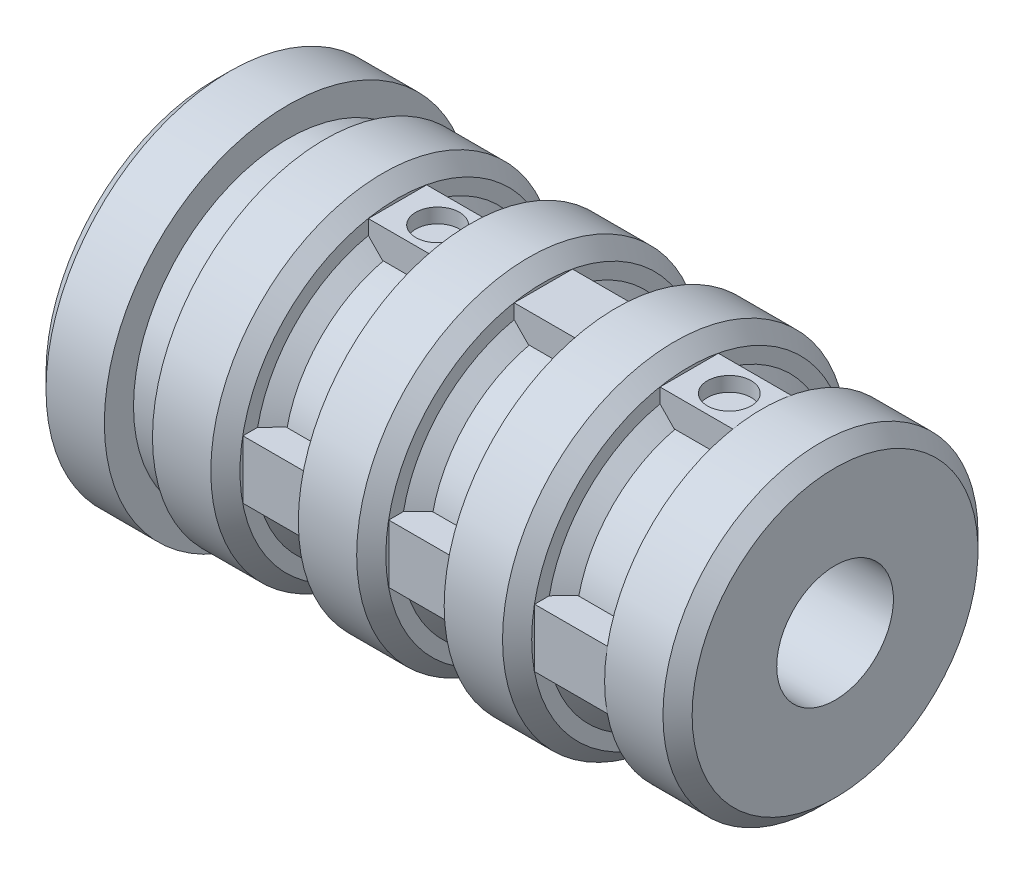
ISO-10303-21;
HEADER;
FILE_DESCRIPTION(('STEP AP214'),'2;1');
FILE_NAME('part.step','',(''),(''),'','','');
FILE_SCHEMA(('AUTOMOTIVE_DESIGN { 1 0 10303 214 1 1 1 1 }'));
ENDSEC;
DATA;
#1=APPLICATION_CONTEXT('core data for automotive mechanical design processes');
#2=APPLICATION_PROTOCOL_DEFINITION('international standard','automotive_design',2000,#1);
#3=PRODUCT_CONTEXT('',#1,'mechanical');
#4=PRODUCT('Part','Part','',(#3));
#5=PRODUCT_RELATED_PRODUCT_CATEGORY('part','',(#4));
#6=PRODUCT_DEFINITION_FORMATION('','',#4);
#7=PRODUCT_DEFINITION_CONTEXT('part definition',#1,'design');
#8=PRODUCT_DEFINITION('design','',#6,#7);
#9=PRODUCT_DEFINITION_SHAPE('','',#8);
#10=(LENGTH_UNIT() NAMED_UNIT(*) SI_UNIT(.MILLI.,.METRE.));
#11=(NAMED_UNIT(*) PLANE_ANGLE_UNIT() SI_UNIT($,.RADIAN.));
#12=(NAMED_UNIT(*) SI_UNIT($,.STERADIAN.) SOLID_ANGLE_UNIT());
#13=UNCERTAINTY_MEASURE_WITH_UNIT(LENGTH_MEASURE(1.E-05),#10,'distance_accuracy_value','');
#14=(GEOMETRIC_REPRESENTATION_CONTEXT(3) GLOBAL_UNCERTAINTY_ASSIGNED_CONTEXT((#13)) GLOBAL_UNIT_ASSIGNED_CONTEXT((#10,
#11,#12)) REPRESENTATION_CONTEXT('',''));
#15=CARTESIAN_POINT('',(0.,0.,0.));
#16=DIRECTION('',(0.,0.,1.));
#17=DIRECTION('',(1.,0.,0.));
#18=AXIS2_PLACEMENT_3D('',#15,#16,#17);
#19=CARTESIAN_POINT('',(15.25,-9.59999999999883,-2.22044604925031E-12));
#20=DIRECTION('',(0.,-1.,0.));
#21=DIRECTION('',(0.,0.,-1.));
#22=AXIS2_PLACEMENT_3D('',#19,#20,#21);
#23=PLANE('',#22);
#24=CARTESIAN_POINT('',(15.25,-9.59999999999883,-2.22044604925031E-12));
#25=DIRECTION('',(0.,-1.,0.));
#26=DIRECTION('',(0.,0.,-1.));
#27=AXIS2_PLACEMENT_3D('',#24,#25,#26);
#28=CIRCLE('',#27,1.5);
#29=CARTESIAN_POINT('',(15.25,-9.59999999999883,-1.50000000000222));
#30=VERTEX_POINT('',#29);
#31=EDGE_CURVE('E1184',#30,#30,#28,.T.);
#32=ORIENTED_EDGE('',*,*,#31,.T.);
#33=EDGE_LOOP('',(#32));
#34=FACE_BOUND('',#33,.T.);
#35=ADVANCED_FACE('F17',(#34),#23,.T.);
#36=CARTESIAN_POINT('',(12.5,-8.59999999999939,-2.00000000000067));
#37=DIRECTION('',(0.,1.,0.));
#38=DIRECTION('',(0.,0.,1.));
#39=AXIS2_PLACEMENT_3D('',#36,#37,#38);
#40=PLANE('',#39);
#41=CARTESIAN_POINT('',(16.5294960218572,-8.59999999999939,-2.00000000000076));
#42=CARTESIAN_POINT('',(16.5244246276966,-8.59999999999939,-1.97761337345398));
#43=CARTESIAN_POINT('',(16.5194309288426,-8.59999999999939,-1.95520971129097));
#44=CARTESIAN_POINT('',(16.5095989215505,-8.59999999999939,-1.91036831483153));
#45=CARTESIAN_POINT('',(16.5047606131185,-8.59999999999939,-1.88793058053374));
#46=CARTESIAN_POINT('',(16.4999999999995,-8.59999999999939,-1.86547581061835));
#47=B_SPLINE_CURVE_WITH_KNOTS('',3,(#41,#42,#43,#44,#45,#46),.UNSPECIFIED.,.F.,.F.,(4,2,4),(0.,
0.0688603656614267,0.137720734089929),.UNSPECIFIED.);
#48=CARTESIAN_POINT('',(16.5294960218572,-8.59999999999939,-2.00000000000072));
#49=VERTEX_POINT('',#48);
#50=CARTESIAN_POINT('',(16.4999999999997,-8.59999999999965,-1.86547581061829));
#51=VERTEX_POINT('',#50);
#52=EDGE_CURVE('E488',#49,#51,#47,.T.);
#53=ORIENTED_EDGE('',*,*,#52,.F.);
#54=DIRECTION('',(1.,0.,0.));
#55=VECTOR('',#54,1.);
#56=CARTESIAN_POINT('',(17.5000000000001,-8.59999999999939,-2.00000000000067));
#57=LINE('',#56,#55);
#58=CARTESIAN_POINT('',(13.4705039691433,-8.60000000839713,-2.00000000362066));
#59=VERTEX_POINT('',#58);
#60=EDGE_CURVE('E481',#49,#59,#57,.F.);
#61=ORIENTED_EDGE('',*,*,#60,.T.);
#62=CARTESIAN_POINT('',(13.4705039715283,-8.59999998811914,-2.00000000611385));
#63=CARTESIAN_POINT('',(13.475575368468,-8.59999999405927,-1.97761337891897));
#64=CARTESIAN_POINT('',(13.4805690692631,-8.59999999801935,-1.95520971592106));
#65=CARTESIAN_POINT('',(13.49040107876,-8.60000000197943,-1.91036831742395));
#66=CARTESIAN_POINT('',(13.4952393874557,-8.60000000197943,-1.88793058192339));
#67=CARTESIAN_POINT('',(13.5000000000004,-8.59999999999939,-1.86547581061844));
#68=B_SPLINE_CURVE_WITH_KNOTS('',3,(#62,#63,#64,#65,#66,#67),.UNSPECIFIED.,.F.,.F.,(4,2,4),(0.,
0.0688603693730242,0.137720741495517),.UNSPECIFIED.);
#69=CARTESIAN_POINT('',(13.4999999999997,-8.59999999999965,-1.86547581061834));
#70=VERTEX_POINT('',#69);
#71=EDGE_CURVE('E20',#59,#70,#68,.T.);
#72=ORIENTED_EDGE('',*,*,#71,.T.);
#73=DIRECTION('',(-1.,0.,0.));
#74=VECTOR('',#73,1.);
#75=CARTESIAN_POINT('',(0.,-8.59999999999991,-1.86547581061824));
#76=LINE('',#75,#74);
#77=EDGE_CURVE('E569',#51,#70,#76,.T.);
#78=ORIENTED_EDGE('',*,*,#77,.F.);
#79=EDGE_LOOP('',(#53,#61,#72,#78));
#80=FACE_BOUND('',#79,.T.);
#81=ADVANCED_FACE('F487',(#80),#40,.T.);
#82=CARTESIAN_POINT('',(15.25,9.60000000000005,0.));
#83=DIRECTION('',(0.,1.,0.));
#84=DIRECTION('',(0.,0.,1.));
#85=AXIS2_PLACEMENT_3D('',#82,#83,#84);
#86=PLANE('',#85);
#87=CARTESIAN_POINT('',(15.25,9.60000000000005,0.));
#88=DIRECTION('',(0.,1.,0.));
#89=DIRECTION('',(0.,0.,1.));
#90=AXIS2_PLACEMENT_3D('',#87,#88,#89);
#91=CIRCLE('',#90,1.5);
#92=CARTESIAN_POINT('',(15.25,9.60000000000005,1.5));
#93=VERTEX_POINT('',#92);
#94=EDGE_CURVE('E576',#93,#93,#91,.T.);
#95=ORIENTED_EDGE('',*,*,#94,.T.);
#96=EDGE_LOOP('',(#95));
#97=FACE_BOUND('',#96,.T.);
#98=ADVANCED_FACE('F1538',(#97),#86,.T.);
#99=CARTESIAN_POINT('',(12.5,8.60000000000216,1.99999999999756));
#100=DIRECTION('',(0.,1.,0.));
#101=DIRECTION('',(0.,0.,1.));
#102=AXIS2_PLACEMENT_3D('',#99,#100,#101);
#103=PLANE('',#102);
#104=CARTESIAN_POINT('',(16.5000000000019,8.60000000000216,-1.86547581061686));
#105=CARTESIAN_POINT('',(16.504760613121,8.60000000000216,-1.88793058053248));
#106=CARTESIAN_POINT('',(16.5095989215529,8.60000000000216,-1.91036831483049));
#107=CARTESIAN_POINT('',(16.5194309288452,8.60000000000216,-1.95520971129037));
#108=CARTESIAN_POINT('',(16.5244246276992,8.60000000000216,-1.9776133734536));
#109=CARTESIAN_POINT('',(16.5294960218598,8.60000000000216,-2.00000000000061));
#110=B_SPLINE_CURVE_WITH_KNOTS('',3,(#104,#105,#106,#107,#108,#109),.UNSPECIFIED.,.F.,.F.,(4,2,
4),(0.,0.0688603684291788,0.137720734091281),.UNSPECIFIED.);
#111=CARTESIAN_POINT('',(16.5000000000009,8.60000000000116,-1.86547581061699));
#112=VERTEX_POINT('',#111);
#113=CARTESIAN_POINT('',(16.529496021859,8.60000000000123,-2.00000000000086));
#114=VERTEX_POINT('',#113);
#115=EDGE_CURVE('E1524',#112,#114,#110,.T.);
#116=ORIENTED_EDGE('',*,*,#115,.F.);
#117=DIRECTION('',(-1.,0.,0.));
#118=VECTOR('',#117,1.);
#119=CARTESIAN_POINT('',(0.,8.60000000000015,-1.86547581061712));
#120=LINE('',#119,#118);
#121=CARTESIAN_POINT('',(13.4999999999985,8.60000000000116,-1.86547581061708));
#122=VERTEX_POINT('',#121);
#123=EDGE_CURVE('E573',#122,#112,#120,.F.);
#124=ORIENTED_EDGE('',*,*,#123,.F.);
#125=CARTESIAN_POINT('',(13.4705039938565,8.60000005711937,-2.00000004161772));
#126=CARTESIAN_POINT('',(13.4755753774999,8.60000002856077,-1.97761340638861));
#127=CARTESIAN_POINT('',(13.480569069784,8.6000000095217,-1.95520973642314));
#128=CARTESIAN_POINT('',(13.4904010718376,8.59999999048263,-1.91036832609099));
#129=CARTESIAN_POINT('',(13.4952393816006,8.59999999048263,-1.8879305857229));
#130=CARTESIAN_POINT('',(13.499999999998,8.60000000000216,-1.86547581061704));
#131=B_SPLINE_CURVE_WITH_KNOTS('',3,(#125,#126,#127,#128,#129,#130),.UNSPECIFIED.,.F.,.F.,(4,2,
4),(0.,0.0688603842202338,0.137720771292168),.UNSPECIFIED.);
#132=CARTESIAN_POINT('',(13.470503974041,8.60000000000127,-2.00000001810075));
#133=VERTEX_POINT('',#132);
#134=EDGE_CURVE('E477',#133,#122,#131,.T.);
#135=ORIENTED_EDGE('',*,*,#134,.F.);
#136=DIRECTION('',(-1.,0.,0.));
#137=VECTOR('',#136,1.);
#138=CARTESIAN_POINT('',(12.5,8.60000000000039,-2.00000000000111));
#139=LINE('',#138,#137);
#140=EDGE_CURVE('E889',#114,#133,#139,.T.);
#141=ORIENTED_EDGE('',*,*,#140,.F.);
#142=EDGE_LOOP('',(#116,#124,#135,#141));
#143=FACE_BOUND('',#142,.T.);
#144=ADVANCED_FACE('F1528',(#143),#103,.F.);
#145=CARTESIAN_POINT('',(12.5,8.60000000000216,1.99999999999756));
#146=DIRECTION('',(0.,1.,0.));
#147=DIRECTION('',(0.,0.,1.));
#148=AXIS2_PLACEMENT_3D('',#145,#146,#147);
#149=PLANE('',#148);
#150=CARTESIAN_POINT('',(16.5294960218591,8.60000000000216,1.99999999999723));
#151=CARTESIAN_POINT('',(16.5244246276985,8.60000000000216,1.97761337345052));
#152=CARTESIAN_POINT('',(16.5194309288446,8.60000000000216,1.95520971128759));
#153=CARTESIAN_POINT('',(16.5095989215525,8.60000000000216,1.91036831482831));
#154=CARTESIAN_POINT('',(16.5047606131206,8.60000000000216,1.8879305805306));
#155=CARTESIAN_POINT('',(16.5000000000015,8.60000000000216,1.86547581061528));
#156=B_SPLINE_CURVE_WITH_KNOTS('',3,(#150,#151,#152,#153,#154,#155),.UNSPECIFIED.,.F.,.F.,(4,2,
4),(0.,0.0688603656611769,0.13772073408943),.UNSPECIFIED.);
#157=CARTESIAN_POINT('',(16.5294960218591,8.60000000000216,1.99999999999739));
#158=VERTEX_POINT('',#157);
#159=CARTESIAN_POINT('',(16.5000000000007,8.60000000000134,1.86547581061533));
#160=VERTEX_POINT('',#159);
#161=EDGE_CURVE('E1484',#158,#160,#156,.T.);
#162=ORIENTED_EDGE('',*,*,#161,.F.);
#163=DIRECTION('',(1.,0.,0.));
#164=VECTOR('',#163,1.);
#165=CARTESIAN_POINT('',(12.5,8.60000000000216,1.99999999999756));
#166=LINE('',#165,#164);
#167=CARTESIAN_POINT('',(13.4705039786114,8.599999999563,1.99999999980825));
#168=VERTEX_POINT('',#167);
#169=EDGE_CURVE('E1050',#168,#158,#166,.T.);
#170=ORIENTED_EDGE('',*,*,#169,.F.);
#171=CARTESIAN_POINT('',(13.4999999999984,8.60000000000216,1.86547581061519));
#172=CARTESIAN_POINT('',(13.4952393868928,8.60000000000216,1.88793058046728));
#173=CARTESIAN_POINT('',(13.4904010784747,8.60000000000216,1.91036831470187));
#174=CARTESIAN_POINT('',(13.4805690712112,8.60000000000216,1.95520971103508));
#175=CARTESIAN_POINT('',(13.475575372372,8.60000000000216,1.97761337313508));
#176=CARTESIAN_POINT('',(13.4705039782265,8.60000000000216,1.99999999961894));
#177=B_SPLINE_CURVE_WITH_KNOTS('',3,(#171,#172,#173,#174,#175,#176),.UNSPECIFIED.,.F.,.F.,(4,2,
4),(0.,0.0688603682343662,0.137720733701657),.UNSPECIFIED.);
#178=CARTESIAN_POINT('',(13.4999999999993,8.60000000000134,1.86547581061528));
#179=VERTEX_POINT('',#178);
#180=EDGE_CURVE('E1545',#179,#168,#177,.T.);
#181=ORIENTED_EDGE('',*,*,#180,.F.);
#182=DIRECTION('',(-1.,0.,0.));
#183=VECTOR('',#182,1.);
#184=CARTESIAN_POINT('',(0.,8.60000000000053,1.86547581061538));
#185=LINE('',#184,#183);
#186=EDGE_CURVE('E565',#160,#179,#185,.T.);
#187=ORIENTED_EDGE('',*,*,#186,.F.);
#188=EDGE_LOOP('',(#162,#170,#181,#187));
#189=FACE_BOUND('',#188,.T.);
#190=ADVANCED_FACE('F1537',(#189),#149,.F.);
#191=CARTESIAN_POINT('',(0.,0.,0.));
#192=DIRECTION('',(-1.,0.,0.));
#193=DIRECTION('',(0.,0.,1.));
#194=AXIS2_PLACEMENT_3D('',#191,#192,#193);
#195=CYLINDRICAL_SURFACE('',#194,11.8);
#196=CARTESIAN_POINT('',(17.5000000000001,0.,0.));
#197=DIRECTION('',(-1.,0.,0.));
#198=DIRECTION('',(0.,0.,1.));
#199=AXIS2_PLACEMENT_3D('',#196,#197,#198);
#200=CIRCLE('',#199,11.8);
#201=CARTESIAN_POINT('',(17.5000000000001,0.,11.8));
#202=VERTEX_POINT('',#201);
#203=EDGE_CURVE('E1031',#202,#202,#200,.F.);
#204=ORIENTED_EDGE('',*,*,#203,.T.);
#205=EDGE_LOOP('',(#204));
#206=FACE_BOUND('',#205,.T.);
#207=CARTESIAN_POINT('',(21.5000000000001,0.,0.));
#208=DIRECTION('',(-1.,0.,0.));
#209=DIRECTION('',(0.,0.,1.));
#210=AXIS2_PLACEMENT_3D('',#207,#208,#209);
#211=CIRCLE('',#210,11.8);
#212=CARTESIAN_POINT('',(21.5000000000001,0.,11.8));
#213=VERTEX_POINT('',#212);
#214=EDGE_CURVE('E531',#213,#213,#211,.F.);
#215=ORIENTED_EDGE('',*,*,#214,.F.);
#216=EDGE_LOOP('',(#215));
#217=FACE_BOUND('',#216,.T.);
#218=ADVANCED_FACE('F1478',(#206,#217),#195,.T.);
#219=CARTESIAN_POINT('',(17.5000000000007,0.,0.));
#220=DIRECTION('',(1.,0.,0.));
#221=DIRECTION('',(0.,0.,-1.));
#222=AXIS2_PLACEMENT_3D('',#219,#220,#221);
#223=CONICAL_SURFACE('',#222,9.80000000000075,0.785398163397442);
#224=ORIENTED_EDGE('',*,*,#161,.T.);
#225=CARTESIAN_POINT('',(16.5,0.,0.));
#226=DIRECTION('',(-1.,0.,0.));
#227=DIRECTION('',(0.,0.,1.));
#228=AXIS2_PLACEMENT_3D('',#225,#226,#227);
#229=CIRCLE('',#228,8.80000000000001);
#230=CARTESIAN_POINT('',(16.4999999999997,1.86547581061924,8.59999999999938));
#231=VERTEX_POINT('',#230);
#232=EDGE_CURVE('E556',#231,#160,#229,.T.);
#233=ORIENTED_EDGE('',*,*,#232,.F.);
#234=CARTESIAN_POINT('',(16.4999999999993,1.86547581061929,8.59999999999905));
#235=CARTESIAN_POINT('',(16.5047606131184,1.88793058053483,8.59999999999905));
#236=CARTESIAN_POINT('',(16.5095989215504,1.91036831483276,8.59999999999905));
#237=CARTESIAN_POINT('',(16.5194309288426,1.95520971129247,8.59999999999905));
#238=CARTESIAN_POINT('',(16.5244246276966,1.97761337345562,8.59999999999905));
#239=CARTESIAN_POINT('',(16.5294960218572,2.00000000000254,8.59999999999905));
#240=B_SPLINE_CURVE_WITH_KNOTS('',3,(#234,#235,#236,#237,#238,#239),.UNSPECIFIED.,.F.,.F.,(4,2,
4),(0.,0.068860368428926,0.137720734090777),.UNSPECIFIED.);
#241=CARTESIAN_POINT('',(16.5294960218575,2.00000000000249,8.59999999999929));
#242=VERTEX_POINT('',#241);
#243=EDGE_CURVE('E1436',#231,#242,#240,.T.);
#244=ORIENTED_EDGE('',*,*,#243,.T.);
#245=CARTESIAN_POINT('',(16.5294960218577,2.00000000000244,8.59999999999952));
#246=CARTESIAN_POINT('',(16.6910376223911,2.00000000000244,8.76582883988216));
#247=CARTESIAN_POINT('',(16.8526837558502,2.00000000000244,8.93155559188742));
#248=CARTESIAN_POINT('',(17.1761850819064,2.00000000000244,9.26280491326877));
#249=CARTESIAN_POINT('',(17.3380402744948,2.00000000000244,9.42832748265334));
#250=CARTESIAN_POINT('',(17.5000000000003,2.00000000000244,9.593747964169));
#251=B_SPLINE_CURVE_WITH_KNOTS('',3,(#245,#246,#247,#248,#249,#250),.UNSPECIFIED.,.F.,.F.,(4,2,
4),(0.,0.694516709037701,1.3890333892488),.UNSPECIFIED.);
#252=CARTESIAN_POINT('',(17.5000000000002,2.00000000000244,9.59374796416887));
#253=VERTEX_POINT('',#252);
#254=EDGE_CURVE('E1529',#242,#253,#251,.T.);
#255=ORIENTED_EDGE('',*,*,#254,.T.);
#256=CARTESIAN_POINT('',(17.5,0.,0.));
#257=DIRECTION('',(1.,0.,0.));
#258=DIRECTION('',(0.,0.,-1.));
#259=AXIS2_PLACEMENT_3D('',#256,#257,#258);
#260=CIRCLE('',#259,9.80000000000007);
#261=CARTESIAN_POINT('',(17.5000000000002,9.59374796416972,1.99999999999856));
#262=VERTEX_POINT('',#261);
#263=EDGE_CURVE('E873',#253,#262,#260,.F.);
#264=ORIENTED_EDGE('',*,*,#263,.T.);
#265=CARTESIAN_POINT('',(16.5294960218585,8.60000000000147,1.99999999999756));
#266=CARTESIAN_POINT('',(16.6910376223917,8.76582883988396,1.99999999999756));
#267=CARTESIAN_POINT('',(16.8526837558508,8.93155559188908,1.99999999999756));
#268=CARTESIAN_POINT('',(17.1761850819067,9.26280491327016,1.99999999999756));
#269=CARTESIAN_POINT('',(17.338040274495,9.42832748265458,1.99999999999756));
#270=CARTESIAN_POINT('',(17.5000000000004,9.5937479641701,1.99999999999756));
#271=B_SPLINE_CURVE_WITH_KNOTS('',3,(#265,#266,#267,#268,#269,#270),.UNSPECIFIED.,.F.,.F.,(4,2,
4),(0.,0.694516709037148,1.38903338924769),.UNSPECIFIED.);
#272=EDGE_CURVE('E1047',#158,#262,#271,.T.);
#273=ORIENTED_EDGE('',*,*,#272,.F.);
#274=EDGE_LOOP('',(#224,#233,#244,#255,#264,#273));
#275=FACE_BOUND('',#274,.T.);
#276=ADVANCED_FACE('F1474',(#275),#223,.T.);
#277=CARTESIAN_POINT('',(17.5000000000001,0.,0.));
#278=DIRECTION('',(1.,0.,0.));
#279=DIRECTION('',(0.,0.,-1.));
#280=AXIS2_PLACEMENT_3D('',#277,#278,#279);
#281=CONICAL_SURFACE('',#280,9.80000000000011,0.785398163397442);
#282=CARTESIAN_POINT('',(17.4999999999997,-9.59374796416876,-2.00000000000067));
#283=CARTESIAN_POINT('',(17.3380402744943,-9.42832748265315,-2.00000000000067));
#284=CARTESIAN_POINT('',(17.1761850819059,-9.26280491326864,-2.00000000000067));
#285=CARTESIAN_POINT('',(16.8526837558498,-8.93155559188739,-2.00000000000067));
#286=CARTESIAN_POINT('',(16.6910376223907,-8.76582883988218,-2.00000000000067));
#287=CARTESIAN_POINT('',(16.5294960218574,-8.59999999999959,-2.00000000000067));
#288=B_SPLINE_CURVE_WITH_KNOTS('',3,(#282,#283,#284,#285,#286,#287),.UNSPECIFIED.,.F.,.F.,(4,2,
4),(0.,0.694516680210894,1.38903338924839),.UNSPECIFIED.);
#289=CARTESIAN_POINT('',(17.4999999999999,-9.59374796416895,-2.00000000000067));
#290=VERTEX_POINT('',#289);
#291=EDGE_CURVE('E489',#290,#49,#288,.T.);
#292=ORIENTED_EDGE('',*,*,#291,.T.);
#293=ORIENTED_EDGE('',*,*,#52,.T.);
#294=CARTESIAN_POINT('',(16.5,0.,0.));
#295=DIRECTION('',(-1.,0.,0.));
#296=DIRECTION('',(0.,0.,1.));
#297=AXIS2_PLACEMENT_3D('',#294,#295,#296);
#298=CIRCLE('',#297,8.80000000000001);
#299=EDGE_CURVE('E566',#112,#51,#298,.T.);
#300=ORIENTED_EDGE('',*,*,#299,.F.);
#301=ORIENTED_EDGE('',*,*,#115,.T.);
#302=CARTESIAN_POINT('',(17.5000000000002,9.5937479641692,-2.00000000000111));
#303=CARTESIAN_POINT('',(17.3380402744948,9.42832748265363,-2.00000000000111));
#304=CARTESIAN_POINT('',(17.1761850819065,9.26280491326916,-2.00000000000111));
#305=CARTESIAN_POINT('',(16.8526837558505,8.931555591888,-2.00000000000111));
#306=CARTESIAN_POINT('',(16.6910376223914,8.76582883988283,-2.00000000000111));
#307=CARTESIAN_POINT('',(16.5294960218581,8.60000000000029,-2.00000000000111));
#308=B_SPLINE_CURVE_WITH_KNOTS('',3,(#302,#303,#304,#305,#306,#307),.UNSPECIFIED.,.F.,.F.,(4,2,
4),(0.,0.694516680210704,1.38903338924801),.UNSPECIFIED.);
#309=CARTESIAN_POINT('',(17.5000000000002,9.59374796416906,-2.00000000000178));
#310=VERTEX_POINT('',#309);
#311=EDGE_CURVE('E894',#310,#114,#308,.T.);
#312=ORIENTED_EDGE('',*,*,#311,.F.);
#313=CARTESIAN_POINT('',(17.5000000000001,0.,0.));
#314=DIRECTION('',(1.,0.,0.));
#315=DIRECTION('',(0.,0.,-1.));
#316=AXIS2_PLACEMENT_3D('',#313,#314,#315);
#317=CIRCLE('',#316,9.80000000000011);
#318=EDGE_CURVE('E862',#310,#290,#317,.F.);
#319=ORIENTED_EDGE('',*,*,#318,.T.);
#320=EDGE_LOOP('',(#292,#293,#300,#301,#312,#319));
#321=FACE_BOUND('',#320,.T.);
#322=ADVANCED_FACE('F1460',(#321),#281,.T.);
#323=CARTESIAN_POINT('',(12.5,-1.999999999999,8.59999999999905));
#324=DIRECTION('',(0.,0.,1.));
#325=DIRECTION('',(0.,-1.,0.));
#326=AXIS2_PLACEMENT_3D('',#323,#324,#325);
#327=PLANE('',#326);
#328=CARTESIAN_POINT('',(13.4705039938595,2.00000004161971,8.60000005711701));
#329=CARTESIAN_POINT('',(13.4755753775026,1.97761340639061,8.60000002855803));
#330=CARTESIAN_POINT('',(13.4805690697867,1.95520973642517,8.60000000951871));
#331=CARTESIAN_POINT('',(13.4904010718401,1.9103683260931,8.59999999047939));
#332=CARTESIAN_POINT('',(13.4952393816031,1.88793058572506,8.59999999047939));
#333=CARTESIAN_POINT('',(13.5000000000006,1.86547581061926,8.59999999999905));
#334=B_SPLINE_CURVE_WITH_KNOTS('',3,(#328,#329,#330,#331,#332,#333),.UNSPECIFIED.,.F.,.F.,(4,2,
4),(0.,0.0688603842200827,0.137720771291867),.UNSPECIFIED.);
#335=CARTESIAN_POINT('',(13.4705039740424,2.00000001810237,8.5999999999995));
#336=VERTEX_POINT('',#335);
#337=CARTESIAN_POINT('',(13.5000000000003,1.86547581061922,8.59999999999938));
#338=VERTEX_POINT('',#337);
#339=EDGE_CURVE('E1432',#336,#338,#334,.T.);
#340=ORIENTED_EDGE('',*,*,#339,.F.);
#341=DIRECTION('',(1.,0.,0.));
#342=VECTOR('',#341,1.);
#343=CARTESIAN_POINT('',(12.5,2.00000000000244,8.59999999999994));
#344=LINE('',#343,#342);
#345=EDGE_CURVE('E552',#242,#336,#344,.F.);
#346=ORIENTED_EDGE('',*,*,#345,.F.);
#347=ORIENTED_EDGE('',*,*,#243,.F.);
#348=DIRECTION('',(-1.,0.,0.));
#349=VECTOR('',#348,1.);
#350=CARTESIAN_POINT('',(0.,1.86547581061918,8.5999999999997));
#351=LINE('',#350,#349);
#352=EDGE_CURVE('E553',#338,#231,#351,.F.);
#353=ORIENTED_EDGE('',*,*,#352,.F.);
#354=EDGE_LOOP('',(#340,#346,#347,#353));
#355=FACE_BOUND('',#354,.T.);
#356=ADVANCED_FACE('F1455',(#355),#327,.F.);
#357=CARTESIAN_POINT('',(12.5,-8.59999999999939,-2.00000000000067));
#358=DIRECTION('',(0.,1.,0.));
#359=DIRECTION('',(0.,0.,1.));
#360=AXIS2_PLACEMENT_3D('',#357,#358,#359);
#361=PLANE('',#360);
#362=CARTESIAN_POINT('',(16.4999999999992,-8.59999999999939,1.86547581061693));
#363=CARTESIAN_POINT('',(16.5047606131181,-8.59999999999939,1.88793058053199));
#364=CARTESIAN_POINT('',(16.50959892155,-8.59999999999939,1.91036831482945));
#365=CARTESIAN_POINT('',(16.519430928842,-8.59999999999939,1.95520971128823));
#366=CARTESIAN_POINT('',(16.5244246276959,-8.59999999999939,1.97761337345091));
#367=CARTESIAN_POINT('',(16.5294960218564,-8.59999999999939,1.99999999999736));
#368=B_SPLINE_CURVE_WITH_KNOTS('',3,(#362,#363,#364,#365,#366,#367),.UNSPECIFIED.,.F.,.F.,(4,2,
4),(0.,0.0688603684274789,0.137720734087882),.UNSPECIFIED.);
#369=CARTESIAN_POINT('',(16.4999999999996,-8.5999999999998,1.86547581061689));
#370=VERTEX_POINT('',#369);
#371=CARTESIAN_POINT('',(16.5294960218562,-8.59999999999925,1.99999999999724));
#372=VERTEX_POINT('',#371);
#373=EDGE_CURVE('E1428',#370,#372,#368,.T.);
#374=ORIENTED_EDGE('',*,*,#373,.F.);
#375=DIRECTION('',(-1.,0.,0.));
#376=VECTOR('',#375,1.);
#377=CARTESIAN_POINT('',(0.,-8.60000000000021,1.86547581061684));
#378=LINE('',#377,#376);
#379=CARTESIAN_POINT('',(13.5000000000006,-8.5999999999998,1.86547581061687));
#380=VERTEX_POINT('',#379);
#381=EDGE_CURVE('E550',#380,#370,#378,.F.);
#382=ORIENTED_EDGE('',*,*,#381,.F.);
#383=CARTESIAN_POINT('',(13.5000000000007,-8.59999999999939,1.86547581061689));
#384=CARTESIAN_POINT('',(13.4952393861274,-8.59999999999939,1.88793058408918));
#385=CARTESIAN_POINT('',(13.4904010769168,-8.59999999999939,1.91036832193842));
#386=CARTESIAN_POINT('',(13.4805690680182,-8.59999999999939,1.95520972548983));
#387=CARTESIAN_POINT('',(13.4755753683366,-8.59999999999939,1.97761339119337));
#388=CARTESIAN_POINT('',(13.4705039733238,-8.59999999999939,2.00000002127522));
#389=B_SPLINE_CURVE_WITH_KNOTS('',3,(#383,#384,#385,#386,#387,#388),.UNSPECIFIED.,.F.,.F.,(4,2,
4),(0.,0.068860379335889,0.1377207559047),.UNSPECIFIED.);
#390=CARTESIAN_POINT('',(13.4705039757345,-8.5999999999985,2.00000001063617));
#391=VERTEX_POINT('',#390);
#392=EDGE_CURVE('E1430',#380,#391,#389,.T.);
#393=ORIENTED_EDGE('',*,*,#392,.T.);
#394=DIRECTION('',(-1.,0.,0.));
#395=VECTOR('',#394,1.);
#396=CARTESIAN_POINT('',(17.5000000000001,-8.59999999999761,1.99999999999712));
#397=LINE('',#396,#395);
#398=EDGE_CURVE('E491',#391,#372,#397,.F.);
#399=ORIENTED_EDGE('',*,*,#398,.T.);
#400=EDGE_LOOP('',(#374,#382,#393,#399));
#401=FACE_BOUND('',#400,.T.);
#402=ADVANCED_FACE('F1426',(#401),#361,.T.);
#403=CARTESIAN_POINT('',(17.4999999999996,0.,0.));
#404=DIRECTION('',(1.,0.,0.));
#405=DIRECTION('',(0.,0.,-1.));
#406=AXIS2_PLACEMENT_3D('',#403,#404,#405);
#407=CONICAL_SURFACE('',#406,9.79999999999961,0.785398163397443);
#408=CARTESIAN_POINT('',(16.5,0.,0.));
#409=DIRECTION('',(-1.,0.,0.));
#410=DIRECTION('',(0.,0.,1.));
#411=AXIS2_PLACEMENT_3D('',#408,#409,#410);
#412=CIRCLE('',#411,8.80000000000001);
#413=CARTESIAN_POINT('',(16.5,-1.86547581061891,8.59999999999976));
#414=VERTEX_POINT('',#413);
#415=EDGE_CURVE('E543',#370,#414,#412,.T.);
#416=ORIENTED_EDGE('',*,*,#415,.F.);
#417=ORIENTED_EDGE('',*,*,#373,.T.);
#418=CARTESIAN_POINT('',(16.5294960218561,-8.59999999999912,1.99999999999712));
#419=CARTESIAN_POINT('',(16.6910376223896,-8.76582883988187,1.99999999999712));
#420=CARTESIAN_POINT('',(16.8526837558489,-8.93155559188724,1.99999999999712));
#421=CARTESIAN_POINT('',(17.1761850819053,-9.26280491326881,1.99999999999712));
#422=CARTESIAN_POINT('',(17.3380402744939,-9.42832748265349,1.99999999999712));
#423=CARTESIAN_POINT('',(17.4999999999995,-9.59374796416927,1.99999999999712));
#424=B_SPLINE_CURVE_WITH_KNOTS('',3,(#418,#419,#420,#421,#422,#423),.UNSPECIFIED.,.F.,.F.,(4,2,
4),(0.,0.694516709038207,1.38903338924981),.UNSPECIFIED.);
#425=CARTESIAN_POINT('',(17.4999999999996,-9.59374796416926,1.99999999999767));
#426=VERTEX_POINT('',#425);
#427=EDGE_CURVE('E501',#372,#426,#424,.T.);
#428=ORIENTED_EDGE('',*,*,#427,.T.);
#429=CARTESIAN_POINT('',(17.4999999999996,0.,0.));
#430=DIRECTION('',(1.,0.,0.));
#431=DIRECTION('',(0.,0.,-1.));
#432=AXIS2_PLACEMENT_3D('',#429,#430,#431);
#433=CIRCLE('',#432,9.79999999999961);
#434=CARTESIAN_POINT('',(17.4999999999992,-1.99999999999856,9.59374796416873));
#435=VERTEX_POINT('',#434);
#436=EDGE_CURVE('E879',#426,#435,#433,.F.);
#437=ORIENTED_EDGE('',*,*,#436,.T.);
#438=CARTESIAN_POINT('',(16.5294960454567,-1.99999998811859,8.60000000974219));
#439=CARTESIAN_POINT('',(16.6910376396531,-1.9999999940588,8.76582885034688));
#440=CARTESIAN_POINT('',(16.8526837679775,-1.99999999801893,8.93155560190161));
#441=CARTESIAN_POINT('',(17.1761850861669,-2.00000000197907,9.26280492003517));
#442=CARTESIAN_POINT('',(17.3380402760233,-2.00000000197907,9.42832748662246));
#443=CARTESIAN_POINT('',(17.4999999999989,-1.999999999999,9.59374796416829));
#444=B_SPLINE_CURVE_WITH_KNOTS('',3,(#438,#439,#440,#441,#442,#443),.UNSPECIFIED.,.F.,.F.,(4,2,
4),(0.,0.694516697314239,1.38903336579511),.UNSPECIFIED.);
#445=CARTESIAN_POINT('',(16.5294960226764,-2.00000000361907,8.59999999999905));
#446=VERTEX_POINT('',#445);
#447=EDGE_CURVE('E1032',#446,#435,#444,.T.);
#448=ORIENTED_EDGE('',*,*,#447,.F.);
#449=CARTESIAN_POINT('',(16.5294960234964,-2.00000000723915,8.59999999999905));
#450=CARTESIAN_POINT('',(16.5244246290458,-1.97761337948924,8.59999999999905));
#451=CARTESIAN_POINT('',(16.5194309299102,-1.95520971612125,8.59999999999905));
#452=CARTESIAN_POINT('',(16.5095989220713,-1.91036831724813,8.59999999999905));
#453=CARTESIAN_POINT('',(16.5047606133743,-1.88793058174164,8.59999999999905));
#454=CARTESIAN_POINT('',(16.4999999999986,-1.86547581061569,8.59999999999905));
#455=B_SPLINE_CURVE_WITH_KNOTS('',3,(#449,#450,#451,#452,#453,#454),.UNSPECIFIED.,.F.,.F.,(4,2,
4),(0.,0.0688603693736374,0.137720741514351),.UNSPECIFIED.);
#456=EDGE_CURVE('E1434',#446,#414,#455,.T.);
#457=ORIENTED_EDGE('',*,*,#456,.T.);
#458=EDGE_LOOP('',(#416,#417,#428,#437,#448,#457));
#459=FACE_BOUND('',#458,.T.);
#460=ADVANCED_FACE('F1198',(#459),#407,.T.);
#461=CARTESIAN_POINT('',(12.5,-1.999999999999,8.59999999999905));
#462=DIRECTION('',(0.,0.,1.));
#463=DIRECTION('',(0.,-1.,0.));
#464=AXIS2_PLACEMENT_3D('',#461,#462,#463);
#465=PLANE('',#464);
#466=CARTESIAN_POINT('',(13.5000000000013,-1.86547581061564,8.59999999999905));
#467=CARTESIAN_POINT('',(13.4952393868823,-1.88793058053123,8.59999999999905));
#468=CARTESIAN_POINT('',(13.4904010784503,-1.91036831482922,8.59999999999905));
#469=CARTESIAN_POINT('',(13.4805690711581,-1.95520971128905,8.59999999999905));
#470=CARTESIAN_POINT('',(13.4755753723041,-1.97761337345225,8.59999999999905));
#471=CARTESIAN_POINT('',(13.4705039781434,-1.99999999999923,8.59999999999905));
#472=B_SPLINE_CURVE_WITH_KNOTS('',3,(#466,#467,#468,#469,#470,#471),.UNSPECIFIED.,.F.,.F.,(4,2,
4),(0.,0.0688603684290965,0.137720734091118),.UNSPECIFIED.);
#473=CARTESIAN_POINT('',(13.5000000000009,-1.86547581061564,8.59999999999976));
#474=VERTEX_POINT('',#473);
#475=CARTESIAN_POINT('',(13.4705039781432,-1.99999999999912,8.59999999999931));
#476=VERTEX_POINT('',#475);
#477=EDGE_CURVE('E1644',#474,#476,#472,.T.);
#478=ORIENTED_EDGE('',*,*,#477,.F.);
#479=DIRECTION('',(-1.,0.,0.));
#480=VECTOR('',#479,1.);
#481=CARTESIAN_POINT('',(0.,-1.86547581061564,8.60000000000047));
#482=LINE('',#481,#480);
#483=EDGE_CURVE('E514',#414,#474,#482,.T.);
#484=ORIENTED_EDGE('',*,*,#483,.F.);
#485=ORIENTED_EDGE('',*,*,#456,.F.);
#486=DIRECTION('',(1.,0.,0.));
#487=VECTOR('',#486,1.);
#488=CARTESIAN_POINT('',(12.5,-1.999999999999,8.59999999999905));
#489=LINE('',#488,#487);
#490=EDGE_CURVE('E1035',#476,#446,#489,.T.);
#491=ORIENTED_EDGE('',*,*,#490,.F.);
#492=EDGE_LOOP('',(#478,#484,#485,#491));
#493=FACE_BOUND('',#492,.T.);
#494=ADVANCED_FACE('F1656',(#493),#465,.F.);
#495=CARTESIAN_POINT('',(22.5,-1.999999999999,8.59999999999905));
#496=DIRECTION('',(0.,0.,1.));
#497=DIRECTION('',(0.,-1.,0.));
#498=AXIS2_PLACEMENT_3D('',#495,#496,#497);
#499=PLANE('',#498);
#500=CARTESIAN_POINT('',(26.5294960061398,-2.00000004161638,8.6000000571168));
#501=CARTESIAN_POINT('',(26.5244246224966,-1.97761340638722,8.60000002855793));
#502=CARTESIAN_POINT('',(26.5194309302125,-1.95520973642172,8.60000000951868));
#503=CARTESIAN_POINT('',(26.509598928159,-1.91036832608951,8.59999999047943));
#504=CARTESIAN_POINT('',(26.504760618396,-1.88793058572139,8.59999999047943));
#505=CARTESIAN_POINT('',(26.4999999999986,-1.86547581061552,8.59999999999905));
#506=B_SPLINE_CURVE_WITH_KNOTS('',3,(#500,#501,#502,#503,#504,#505),.UNSPECIFIED.,.F.,.F.,(4,2,
4),(0.,0.0688603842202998,0.137720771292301),.UNSPECIFIED.);
#507=CARTESIAN_POINT('',(26.5294960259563,-2.000000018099,8.59999999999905));
#508=VERTEX_POINT('',#507);
#509=CARTESIAN_POINT('',(26.4999999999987,-1.86547581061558,8.59999999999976));
#510=VERTEX_POINT('',#509);
#511=EDGE_CURVE('E1637',#508,#510,#506,.T.);
#512=ORIENTED_EDGE('',*,*,#511,.F.);
#513=DIRECTION('',(1.,0.,0.));
#514=VECTOR('',#513,1.);
#515=CARTESIAN_POINT('',(22.5,-1.999999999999,8.59999999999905));
#516=LINE('',#515,#514);
#517=CARTESIAN_POINT('',(23.4705039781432,-1.99999999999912,8.59999999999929));
#518=VERTEX_POINT('',#517);
#519=EDGE_CURVE('E841',#518,#508,#516,.T.);
#520=ORIENTED_EDGE('',*,*,#519,.F.);
#521=CARTESIAN_POINT('',(23.5000000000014,-1.86547581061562,8.59999999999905));
#522=CARTESIAN_POINT('',(23.4952393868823,-1.88793058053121,8.59999999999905));
#523=CARTESIAN_POINT('',(23.4904010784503,-1.91036831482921,8.59999999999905));
#524=CARTESIAN_POINT('',(23.4805690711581,-1.95520971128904,8.59999999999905));
#525=CARTESIAN_POINT('',(23.4755753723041,-1.97761337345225,8.59999999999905));
#526=CARTESIAN_POINT('',(23.4705039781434,-1.99999999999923,8.59999999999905));
#527=B_SPLINE_CURVE_WITH_KNOTS('',3,(#521,#522,#523,#524,#525,#526),.UNSPECIFIED.,.F.,.F.,(4,2,
4),(0.,0.0688603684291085,0.137720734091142),.UNSPECIFIED.);
#528=CARTESIAN_POINT('',(23.5000000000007,-1.86547581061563,8.59999999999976));
#529=VERTEX_POINT('',#528);
#530=EDGE_CURVE('E1165',#529,#518,#527,.T.);
#531=ORIENTED_EDGE('',*,*,#530,.F.);
#532=DIRECTION('',(-1.,0.,0.));
#533=VECTOR('',#532,1.);
#534=CARTESIAN_POINT('',(0.,-1.86547581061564,8.60000000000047));
#535=LINE('',#534,#533);
#536=EDGE_CURVE('E510',#510,#529,#535,.T.);
#537=ORIENTED_EDGE('',*,*,#536,.F.);
#538=EDGE_LOOP('',(#512,#520,#531,#537));
#539=FACE_BOUND('',#538,.T.);
#540=ADVANCED_FACE('F1652',(#539),#499,.F.);
#541=CARTESIAN_POINT('',(22.5,-1.999999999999,8.59999999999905));
#542=DIRECTION('',(0.,0.,1.));
#543=DIRECTION('',(0.,-1.,0.));
#544=AXIS2_PLACEMENT_3D('',#541,#542,#543);
#545=PLANE('',#544);
#546=CARTESIAN_POINT('',(26.4999999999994,1.8654758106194,8.59999999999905));
#547=CARTESIAN_POINT('',(26.5047606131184,1.88793058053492,8.59999999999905));
#548=CARTESIAN_POINT('',(26.5095989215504,1.91036831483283,8.59999999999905));
#549=CARTESIAN_POINT('',(26.5194309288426,1.9552097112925,8.59999999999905));
#550=CARTESIAN_POINT('',(26.5244246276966,1.97761337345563,8.59999999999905));
#551=CARTESIAN_POINT('',(26.5294960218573,2.00000000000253,8.59999999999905));
#552=B_SPLINE_CURVE_WITH_KNOTS('',3,(#546,#547,#548,#549,#550,#551),.UNSPECIFIED.,.F.,.F.,(4,2,
4),(0.,0.0688603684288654,0.137720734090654),.UNSPECIFIED.);
#553=CARTESIAN_POINT('',(26.5000000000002,1.86547581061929,8.59999999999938));
#554=VERTEX_POINT('',#553);
#555=CARTESIAN_POINT('',(26.5294960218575,2.00000000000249,8.59999999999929));
#556=VERTEX_POINT('',#555);
#557=EDGE_CURVE('E1643',#554,#556,#552,.T.);
#558=ORIENTED_EDGE('',*,*,#557,.F.);
#559=DIRECTION('',(-1.,0.,0.));
#560=VECTOR('',#559,1.);
#561=CARTESIAN_POINT('',(0.,1.86547581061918,8.5999999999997));
#562=LINE('',#561,#560);
#563=CARTESIAN_POINT('',(23.5000000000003,1.86547581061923,8.59999999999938));
#564=VERTEX_POINT('',#563);
#565=EDGE_CURVE('E524',#564,#554,#562,.F.);
#566=ORIENTED_EDGE('',*,*,#565,.F.);
#567=CARTESIAN_POINT('',(23.4705039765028,2.00000000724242,8.59999999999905));
#568=CARTESIAN_POINT('',(23.4755753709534,1.97761337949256,8.59999999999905));
#569=CARTESIAN_POINT('',(23.480569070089,1.95520971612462,8.59999999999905));
#570=CARTESIAN_POINT('',(23.4904010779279,1.91036831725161,8.59999999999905));
#571=CARTESIAN_POINT('',(23.4952393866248,1.88793058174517,8.59999999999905));
#572=CARTESIAN_POINT('',(23.5000000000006,1.86547581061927,8.59999999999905));
#573=B_SPLINE_CURVE_WITH_KNOTS('',3,(#567,#568,#569,#570,#571,#572),.UNSPECIFIED.,.F.,.F.,(4,2,
4),(0.,0.0688603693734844,0.137720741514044),.UNSPECIFIED.);
#574=CARTESIAN_POINT('',(23.4705039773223,2.00000000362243,8.5999999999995));
#575=VERTEX_POINT('',#574);
#576=EDGE_CURVE('E2547',#575,#564,#573,.T.);
#577=ORIENTED_EDGE('',*,*,#576,.F.);
#578=DIRECTION('',(1.,0.,0.));
#579=VECTOR('',#578,1.);
#580=CARTESIAN_POINT('',(22.5,2.00000000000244,8.59999999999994));
#581=LINE('',#580,#579);
#582=EDGE_CURVE('E977',#556,#575,#581,.F.);
#583=ORIENTED_EDGE('',*,*,#582,.F.);
#584=EDGE_LOOP('',(#558,#566,#577,#583));
#585=FACE_BOUND('',#584,.T.);
#586=ADVANCED_FACE('F1655',(#585),#545,.F.);
#587=CARTESIAN_POINT('',(22.5,8.60000000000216,1.99999999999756));
#588=DIRECTION('',(0.,1.,0.));
#589=DIRECTION('',(0.,0.,1.));
#590=AXIS2_PLACEMENT_3D('',#587,#588,#589);
#591=PLANE('',#590);
#592=CARTESIAN_POINT('',(23.4999999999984,8.60000000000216,1.86547581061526));
#593=CARTESIAN_POINT('',(23.4952393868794,8.60000000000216,1.88793058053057));
#594=CARTESIAN_POINT('',(23.4904010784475,8.60000000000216,1.91036831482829));
#595=CARTESIAN_POINT('',(23.4805690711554,8.60000000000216,1.95520971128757));
#596=CARTESIAN_POINT('',(23.4755753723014,8.60000000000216,1.9776133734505));
#597=CARTESIAN_POINT('',(23.4705039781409,8.60000000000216,1.9999999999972));
#598=B_SPLINE_CURVE_WITH_KNOTS('',3,(#592,#593,#594,#595,#596,#597),.UNSPECIFIED.,.F.,.F.,(4,2,
4),(0.,0.0688603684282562,0.137720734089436),.UNSPECIFIED.);
#599=CARTESIAN_POINT('',(23.4999999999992,8.60000000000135,1.86547581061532));
#600=VERTEX_POINT('',#599);
#601=CARTESIAN_POINT('',(23.4705039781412,8.60000000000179,1.99999999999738));
#602=VERTEX_POINT('',#601);
#603=EDGE_CURVE('E2543',#600,#602,#598,.T.);
#604=ORIENTED_EDGE('',*,*,#603,.F.);
#605=DIRECTION('',(-1.,0.,0.));
#606=VECTOR('',#605,1.);
#607=CARTESIAN_POINT('',(0.,8.60000000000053,1.86547581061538));
#608=LINE('',#607,#606);
#609=CARTESIAN_POINT('',(26.5000000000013,8.60000000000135,1.86547581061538));
#610=VERTEX_POINT('',#609);
#611=EDGE_CURVE('E521',#610,#600,#608,.T.);
#612=ORIENTED_EDGE('',*,*,#611,.F.);
#613=CARTESIAN_POINT('',(26.5294960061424,8.60000005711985,2.00000004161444));
#614=CARTESIAN_POINT('',(26.5244246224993,8.600000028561,1.97761340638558));
#615=CARTESIAN_POINT('',(26.5194309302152,8.60000000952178,1.95520973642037));
#616=CARTESIAN_POINT('',(26.5095989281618,8.59999999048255,1.91036832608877));
#617=CARTESIAN_POINT('',(26.5047606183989,8.59999999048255,1.88793058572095));
#618=CARTESIAN_POINT('',(26.5000000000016,8.60000000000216,1.86547581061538));
#619=B_SPLINE_CURVE_WITH_KNOTS('',3,(#613,#614,#615,#616,#617,#618),.UNSPECIFIED.,.F.,.F.,(4,2,
4),(0.,0.0688603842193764,0.137720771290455),.UNSPECIFIED.);
#620=CARTESIAN_POINT('',(26.529496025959,8.60000000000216,2.0000000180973));
#621=VERTEX_POINT('',#620);
#622=EDGE_CURVE('E2534',#621,#610,#619,.T.);
#623=ORIENTED_EDGE('',*,*,#622,.F.);
#624=DIRECTION('',(1.,0.,0.));
#625=VECTOR('',#624,1.);
#626=CARTESIAN_POINT('',(22.5,8.60000000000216,1.99999999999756));
#627=LINE('',#626,#625);
#628=EDGE_CURVE('E832',#602,#621,#627,.T.);
#629=ORIENTED_EDGE('',*,*,#628,.F.);
#630=EDGE_LOOP('',(#604,#612,#623,#629));
#631=FACE_BOUND('',#630,.T.);
#632=ADVANCED_FACE('F1837',(#631),#591,.F.);
#633=CARTESIAN_POINT('',(22.5,8.60000000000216,1.99999999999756));
#634=DIRECTION('',(0.,1.,0.));
#635=DIRECTION('',(0.,0.,1.));
#636=AXIS2_PLACEMENT_3D('',#633,#634,#635);
#637=PLANE('',#636);
#638=CARTESIAN_POINT('',(23.4705039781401,8.60000000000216,-2.00000000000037));
#639=CARTESIAN_POINT('',(23.4755753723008,8.60000000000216,-1.97761337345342));
#640=CARTESIAN_POINT('',(23.4805690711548,8.60000000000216,-1.95520971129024));
#641=CARTESIAN_POINT('',(23.490401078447,8.60000000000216,-1.91036831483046));
#642=CARTESIAN_POINT('',(23.495239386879,8.60000000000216,-1.8879305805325));
#643=CARTESIAN_POINT('',(23.499999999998,8.60000000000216,-1.86547581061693));
#644=B_SPLINE_CURVE_WITH_KNOTS('',3,(#638,#639,#640,#641,#642,#643),.UNSPECIFIED.,.F.,.F.,(4,2,
4),(0.,0.0688603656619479,0.137720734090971),.UNSPECIFIED.);
#645=CARTESIAN_POINT('',(23.4705039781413,8.60000000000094,-2.00000000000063));
#646=VERTEX_POINT('',#645);
#647=CARTESIAN_POINT('',(23.4999999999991,8.60000000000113,-1.86547581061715));
#648=VERTEX_POINT('',#647);
#649=EDGE_CURVE('E1100',#646,#648,#644,.T.);
#650=ORIENTED_EDGE('',*,*,#649,.F.);
#651=DIRECTION('',(-1.,0.,0.));
#652=VECTOR('',#651,1.);
#653=CARTESIAN_POINT('',(22.5,8.59999999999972,-2.00000000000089));
#654=LINE('',#653,#652);
#655=CARTESIAN_POINT('',(26.5294960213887,8.59999999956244,-1.9999999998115));
#656=VERTEX_POINT('',#655);
#657=EDGE_CURVE('E831',#656,#646,#654,.T.);
#658=ORIENTED_EDGE('',*,*,#657,.F.);
#659=CARTESIAN_POINT('',(26.5000000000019,8.60000000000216,-1.86547581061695));
#660=CARTESIAN_POINT('',(26.5047606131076,8.60000000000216,-1.88793058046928));
#661=CARTESIAN_POINT('',(26.5095989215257,8.60000000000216,-1.9103683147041));
#662=CARTESIAN_POINT('',(26.5194309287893,8.60000000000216,-1.95520971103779));
#663=CARTESIAN_POINT('',(26.5244246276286,8.60000000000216,-1.97761337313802));
#664=CARTESIAN_POINT('',(26.5294960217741,8.60000000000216,-1.99999999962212));
#665=B_SPLINE_CURVE_WITH_KNOTS('',3,(#659,#660,#661,#662,#663,#664),.UNSPECIFIED.,.F.,.F.,(4,2,
4),(0.,0.0688603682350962,0.137720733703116),.UNSPECIFIED.);
#666=CARTESIAN_POINT('',(26.5000000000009,8.60000000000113,-1.86547581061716));
#667=VERTEX_POINT('',#666);
#668=EDGE_CURVE('E535',#667,#656,#665,.T.);
#669=ORIENTED_EDGE('',*,*,#668,.F.);
#670=DIRECTION('',(-1.,0.,0.));
#671=VECTOR('',#670,1.);
#672=CARTESIAN_POINT('',(0.,8.6000000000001,-1.86547581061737));
#673=LINE('',#672,#671);
#674=EDGE_CURVE('E825',#648,#667,#673,.F.);
#675=ORIENTED_EDGE('',*,*,#674,.F.);
#676=EDGE_LOOP('',(#650,#658,#669,#675));
#677=FACE_BOUND('',#676,.T.);
#678=ADVANCED_FACE('F1844',(#677),#637,.F.);
#679=CARTESIAN_POINT('',(21.5000000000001,0.,0.));
#680=DIRECTION('',(-1.,0.,0.));
#681=DIRECTION('',(0.,0.,1.));
#682=AXIS2_PLACEMENT_3D('',#679,#680,#681);
#683=CONICAL_SURFACE('',#682,11.8,0.785398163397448);
#684=CARTESIAN_POINT('',(22.5,0.,0.));
#685=DIRECTION('',(-1.,0.,0.));
#686=DIRECTION('',(0.,0.,1.));
#687=AXIS2_PLACEMENT_3D('',#684,#685,#686);
#688=CIRCLE('',#687,10.8000000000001);
#689=CARTESIAN_POINT('',(22.5,0.,10.8000000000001));
#690=VERTEX_POINT('',#689);
#691=EDGE_CURVE('E828',#690,#690,#688,.T.);
#692=ORIENTED_EDGE('',*,*,#691,.T.);
#693=EDGE_LOOP('',(#692));
#694=FACE_BOUND('',#693,.T.);
#695=ORIENTED_EDGE('',*,*,#214,.T.);
#696=EDGE_LOOP('',(#695));
#697=FACE_BOUND('',#696,.T.);
#698=ADVANCED_FACE('F1116',(#694,#697),#683,.T.);
#699=CARTESIAN_POINT('',(22.4999999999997,0.,0.));
#700=DIRECTION('',(-1.,0.,0.));
#701=DIRECTION('',(0.,-1.,0.));
#702=AXIS2_PLACEMENT_3D('',#699,#700,#701);
#703=CONICAL_SURFACE('',#702,9.80000000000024,0.785398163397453);
#704=CARTESIAN_POINT('',(23.5000000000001,0.,0.));
#705=DIRECTION('',(-1.,0.,0.));
#706=DIRECTION('',(0.,0.,1.));
#707=AXIS2_PLACEMENT_3D('',#704,#705,#706);
#708=CIRCLE('',#707,8.80000000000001);
#709=CARTESIAN_POINT('',(23.5000000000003,-8.59999999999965,-1.86547581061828));
#710=VERTEX_POINT('',#709);
#711=EDGE_CURVE('E823',#710,#648,#708,.F.);
#712=ORIENTED_EDGE('',*,*,#711,.F.);
#713=CARTESIAN_POINT('',(23.5000000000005,-8.59999999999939,-1.86547581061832));
#714=CARTESIAN_POINT('',(23.4952393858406,-8.59999999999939,-1.88793058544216));
#715=CARTESIAN_POINT('',(23.490401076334,-8.59999999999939,-1.91036832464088));
#716=CARTESIAN_POINT('',(23.480569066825,-8.59999999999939,-1.9552097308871));
#717=CARTESIAN_POINT('',(23.4755753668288,-8.59999999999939,-1.97761339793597));
#718=CARTESIAN_POINT('',(23.4705039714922,-8.59999999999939,-2.00000002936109));
#719=B_SPLINE_CURVE_WITH_KNOTS('',3,(#713,#714,#715,#716,#717,#718),.UNSPECIFIED.,.F.,.F.,(4,2,
4),(0.,0.0688603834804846,0.137720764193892),.UNSPECIFIED.);
#720=CARTESIAN_POINT('',(23.4705039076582,-8.60000006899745,-2.00000001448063));
#721=VERTEX_POINT('',#720);
#722=EDGE_CURVE('E1131',#710,#721,#719,.T.);
#723=ORIENTED_EDGE('',*,*,#722,.T.);
#724=CARTESIAN_POINT('',(23.4705038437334,-8.60000013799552,-2.00000000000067));
#725=CARTESIAN_POINT('',(23.3089622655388,-8.76582895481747,-2.00000000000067));
#726=CARTESIAN_POINT('',(23.1473161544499,-8.93155568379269,-2.00000000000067));
#727=CARTESIAN_POINT('',(22.8238148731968,-9.26280495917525,-2.00000000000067));
#728=CARTESIAN_POINT('',(22.6619597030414,-9.42832750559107,-2.00000000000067));
#729=CARTESIAN_POINT('',(22.5000000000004,-9.59374796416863,-2.00000000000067));
#730=B_SPLINE_CURVE_WITH_KNOTS('',3,(#724,#725,#726,#727,#728,#729),.UNSPECIFIED.,.F.,.F.,(4,2,
4),(0.,0.694516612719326,1.38903319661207),.UNSPECIFIED.);
#731=CARTESIAN_POINT('',(22.5000000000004,-9.59374796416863,-2.00000000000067));
#732=VERTEX_POINT('',#731);
#733=EDGE_CURVE('E534',#721,#732,#730,.T.);
#734=ORIENTED_EDGE('',*,*,#733,.T.);
#735=CARTESIAN_POINT('',(22.5000000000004,0.,0.));
#736=DIRECTION('',(-1.,0.,0.));
#737=DIRECTION('',(0.,-1.,0.));
#738=AXIS2_PLACEMENT_3D('',#735,#736,#737);
#739=CIRCLE('',#738,9.79999999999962);
#740=CARTESIAN_POINT('',(22.5000000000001,9.59374796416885,-2.00000000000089));
#741=VERTEX_POINT('',#740);
#742=EDGE_CURVE('E803',#732,#741,#739,.F.);
#743=ORIENTED_EDGE('',*,*,#742,.T.);
#744=CARTESIAN_POINT('',(23.4705039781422,8.59999999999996,-2.00000000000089));
#745=CARTESIAN_POINT('',(23.3089623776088,8.76582883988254,-2.00000000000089));
#746=CARTESIAN_POINT('',(23.1473162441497,8.93155559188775,-2.00000000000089));
#747=CARTESIAN_POINT('',(22.8238149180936,9.26280491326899,-2.00000000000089));
#748=CARTESIAN_POINT('',(22.6619597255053,9.4283274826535,-2.00000000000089));
#749=CARTESIAN_POINT('',(22.4999999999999,9.59374796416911,-2.00000000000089));
#750=B_SPLINE_CURVE_WITH_KNOTS('',3,(#744,#745,#746,#747,#748,#749),.UNSPECIFIED.,.F.,.F.,(4,2,
4),(0.,0.694516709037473,1.38903338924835),.UNSPECIFIED.);
#751=EDGE_CURVE('E957',#646,#741,#750,.T.);
#752=ORIENTED_EDGE('',*,*,#751,.F.);
#753=ORIENTED_EDGE('',*,*,#649,.T.);
#754=EDGE_LOOP('',(#712,#723,#734,#743,#752,#753));
#755=FACE_BOUND('',#754,.T.);
#756=ADVANCED_FACE('F1110',(#755),#703,.T.);
#757=CARTESIAN_POINT('',(22.4999999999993,0.,0.));
#758=DIRECTION('',(-1.,0.,0.));
#759=DIRECTION('',(0.,0.,1.));
#760=AXIS2_PLACEMENT_3D('',#757,#758,#759);
#761=CONICAL_SURFACE('',#760,9.80000000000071,0.785398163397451);
#762=ORIENTED_EDGE('',*,*,#603,.T.);
#763=CARTESIAN_POINT('',(22.4999999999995,9.59374796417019,1.99999999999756));
#764=CARTESIAN_POINT('',(22.6619597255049,9.42832748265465,1.99999999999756));
#765=CARTESIAN_POINT('',(22.8238149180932,9.2628049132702,1.99999999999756));
#766=CARTESIAN_POINT('',(23.1473162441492,8.93155559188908,1.99999999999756));
#767=CARTESIAN_POINT('',(23.3089623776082,8.76582883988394,1.99999999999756));
#768=CARTESIAN_POINT('',(23.4705039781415,8.60000000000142,1.99999999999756));
#769=B_SPLINE_CURVE_WITH_KNOTS('',3,(#763,#764,#765,#766,#767,#768),.UNSPECIFIED.,.F.,.F.,(4,2,
4),(0.,0.694516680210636,1.38903338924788),.UNSPECIFIED.);
#770=CARTESIAN_POINT('',(22.4999999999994,9.59374796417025,1.99999999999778));
#771=VERTEX_POINT('',#770);
#772=EDGE_CURVE('E527',#771,#602,#769,.T.);
#773=ORIENTED_EDGE('',*,*,#772,.F.);
#774=CARTESIAN_POINT('',(22.4999999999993,0.,0.));
#775=DIRECTION('',(-1.,0.,0.));
#776=DIRECTION('',(0.,0.,1.));
#777=AXIS2_PLACEMENT_3D('',#774,#775,#776);
#778=CIRCLE('',#777,9.80000000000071);
#779=CARTESIAN_POINT('',(22.4999999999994,2.00000000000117,9.5937479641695));
#780=VERTEX_POINT('',#779);
#781=EDGE_CURVE('E793',#771,#780,#778,.F.);
#782=ORIENTED_EDGE('',*,*,#781,.T.);
#783=CARTESIAN_POINT('',(23.4705039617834,2.00000000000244,8.60000001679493));
#784=CARTESIAN_POINT('',(23.3089623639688,2.00000000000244,8.76582885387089));
#785=CARTESIAN_POINT('',(23.1473162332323,2.00000000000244,8.9315556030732));
#786=CARTESIAN_POINT('',(22.823814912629,2.00000000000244,9.26280491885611));
#787=CARTESIAN_POINT('',(22.6619597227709,2.00000000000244,9.42832748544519));
#788=CARTESIAN_POINT('',(22.4999999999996,2.00000000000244,9.5937479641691));
#789=B_SPLINE_CURVE_WITH_KNOTS('',3,(#783,#784,#785,#786,#787,#788),.UNSPECIFIED.,.F.,.F.,(4,2,
4),(0.,0.694516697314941,1.38903336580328),.UNSPECIFIED.);
#790=EDGE_CURVE('E968',#575,#780,#789,.T.);
#791=ORIENTED_EDGE('',*,*,#790,.F.);
#792=ORIENTED_EDGE('',*,*,#576,.T.);
#793=CARTESIAN_POINT('',(23.5000000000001,0.,0.));
#794=DIRECTION('',(-1.,0.,0.));
#795=DIRECTION('',(0.,0.,1.));
#796=AXIS2_PLACEMENT_3D('',#793,#794,#795);
#797=CIRCLE('',#796,8.80000000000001);
#798=EDGE_CURVE('E523',#600,#564,#797,.F.);
#799=ORIENTED_EDGE('',*,*,#798,.F.);
#800=EDGE_LOOP('',(#762,#773,#782,#791,#792,#799));
#801=FACE_BOUND('',#800,.T.);
#802=ADVANCED_FACE('F1115',(#801),#761,.T.);
#803=CARTESIAN_POINT('',(22.5000000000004,0.,0.));
#804=DIRECTION('',(-1.,0.,0.));
#805=DIRECTION('',(0.,0.,1.));
#806=AXIS2_PLACEMENT_3D('',#803,#804,#805);
#807=CONICAL_SURFACE('',#806,9.79999999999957,0.785398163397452);
#808=CARTESIAN_POINT('',(22.5000000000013,-1.999999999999,9.59374796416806));
#809=CARTESIAN_POINT('',(22.6619597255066,-1.999999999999,9.42832748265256));
#810=CARTESIAN_POINT('',(22.8238149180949,-1.999999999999,9.26280491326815));
#811=CARTESIAN_POINT('',(23.1473162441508,-1.999999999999,8.93155559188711));
#812=CARTESIAN_POINT('',(23.3089623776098,-1.999999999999,8.76582883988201));
#813=CARTESIAN_POINT('',(23.470503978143,-1.999999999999,8.59999999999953));
#814=B_SPLINE_CURVE_WITH_KNOTS('',3,(#808,#809,#810,#811,#812,#813),.UNSPECIFIED.,.F.,.F.,(4,2,
4),(0.,0.694516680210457,1.38903338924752),.UNSPECIFIED.);
#815=CARTESIAN_POINT('',(22.5000000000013,-1.99999999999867,9.5937479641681));
#816=VERTEX_POINT('',#815);
#817=EDGE_CURVE('E838',#816,#518,#814,.T.);
#818=ORIENTED_EDGE('',*,*,#817,.F.);
#819=CARTESIAN_POINT('',(22.5000000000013,0.,0.));
#820=DIRECTION('',(-1.,0.,0.));
#821=DIRECTION('',(0.,0.,1.));
#822=AXIS2_PLACEMENT_3D('',#819,#820,#821);
#823=CIRCLE('',#822,9.79999999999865);
#824=CARTESIAN_POINT('',(22.500000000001,-9.59374796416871,1.99999999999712));
#825=VERTEX_POINT('',#824);
#826=EDGE_CURVE('E788',#816,#825,#823,.F.);
#827=ORIENTED_EDGE('',*,*,#826,.T.);
#828=CARTESIAN_POINT('',(22.5000000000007,-9.59374796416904,1.99999999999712));
#829=CARTESIAN_POINT('',(22.6619597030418,-9.4283275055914,1.99999999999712));
#830=CARTESIAN_POINT('',(22.8238148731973,-9.2628049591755,1.99999999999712));
#831=CARTESIAN_POINT('',(23.1473161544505,-8.93155568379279,1.99999999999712));
#832=CARTESIAN_POINT('',(23.3089622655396,-8.7658289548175,1.99999999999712));
#833=CARTESIAN_POINT('',(23.4705038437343,-8.60000013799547,1.99999999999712));
#834=B_SPLINE_CURVE_WITH_KNOTS('',3,(#828,#829,#830,#831,#832,#833),.UNSPECIFIED.,.F.,.F.,(4,2,
4),(0.,0.694516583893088,1.38903319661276),.UNSPECIFIED.);
#835=CARTESIAN_POINT('',(23.470503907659,-8.60000006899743,2.00000001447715));
#836=VERTEX_POINT('',#835);
#837=EDGE_CURVE('E1386',#825,#836,#834,.T.);
#838=ORIENTED_EDGE('',*,*,#837,.T.);
#839=CARTESIAN_POINT('',(23.4705040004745,-8.60000006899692,2.00000003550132));
#840=CARTESIAN_POINT('',(23.4755753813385,-8.60000003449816,1.97761340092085));
#841=CARTESIAN_POINT('',(23.4805690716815,-8.60000001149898,1.95520973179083));
#842=CARTESIAN_POINT('',(23.4904010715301,-8.5999999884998,1.91036832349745));
#843=CARTESIAN_POINT('',(23.4952393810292,-8.5999999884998,1.88793058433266));
#844=CARTESIAN_POINT('',(23.5000000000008,-8.59999999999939,1.86547581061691));
#845=B_SPLINE_CURVE_WITH_KNOTS('',3,(#839,#840,#841,#842,#843,#844),.UNSPECIFIED.,.F.,.F.,(4,2,
4),(0.,0.0688603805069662,0.137720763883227),.UNSPECIFIED.);
#846=CARTESIAN_POINT('',(23.5000000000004,-8.5999999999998,1.86547581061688));
#847=VERTEX_POINT('',#846);
#848=EDGE_CURVE('E1179',#836,#847,#845,.T.);
#849=ORIENTED_EDGE('',*,*,#848,.T.);
#850=CARTESIAN_POINT('',(23.5000000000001,0.,0.));
#851=DIRECTION('',(-1.,0.,0.));
#852=DIRECTION('',(0.,0.,1.));
#853=AXIS2_PLACEMENT_3D('',#850,#851,#852);
#854=CIRCLE('',#853,8.80000000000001);
#855=EDGE_CURVE('E506',#529,#847,#854,.F.);
#856=ORIENTED_EDGE('',*,*,#855,.F.);
#857=ORIENTED_EDGE('',*,*,#530,.T.);
#858=EDGE_LOOP('',(#818,#827,#838,#849,#856,#857));
#859=FACE_BOUND('',#858,.T.);
#860=ADVANCED_FACE('F1155',(#859),#807,.T.);
#861=CARTESIAN_POINT('',(22.5,-8.59999999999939,-2.00000000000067));
#862=DIRECTION('',(0.,-1.,0.));
#863=DIRECTION('',(0.,0.,-1.));
#864=AXIS2_PLACEMENT_3D('',#861,#862,#863);
#865=PLANE('',#864);
#866=ORIENTED_EDGE('',*,*,#722,.F.);
#867=DIRECTION('',(-1.,0.,0.));
#868=VECTOR('',#867,1.);
#869=CARTESIAN_POINT('',(0.,-8.59999999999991,-1.86547581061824));
#870=LINE('',#869,#868);
#871=CARTESIAN_POINT('',(26.4999999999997,-8.59999999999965,-1.86547581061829));
#872=VERTEX_POINT('',#871);
#873=EDGE_CURVE('E820',#872,#710,#870,.T.);
#874=ORIENTED_EDGE('',*,*,#873,.F.);
#875=CARTESIAN_POINT('',(26.5294960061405,-8.60000005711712,-2.00000004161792));
#876=CARTESIAN_POINT('',(26.5244246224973,-8.60000002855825,-1.97761340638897));
#877=CARTESIAN_POINT('',(26.5194309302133,-8.60000000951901,-1.95520973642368));
#878=CARTESIAN_POINT('',(26.5095989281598,-8.59999999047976,-1.9103683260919));
#879=CARTESIAN_POINT('',(26.5047606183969,-8.59999999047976,-1.887930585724));
#880=CARTESIAN_POINT('',(26.4999999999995,-8.59999999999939,-1.86547581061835));
#881=B_SPLINE_CURVE_WITH_KNOTS('',3,(#875,#876,#877,#878,#879,#880),.UNSPECIFIED.,.F.,.F.,(4,2,
4),(0.,0.0688603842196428,0.137720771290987),.UNSPECIFIED.);
#882=CARTESIAN_POINT('',(26.529496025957,-8.59999999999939,-2.0000000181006));
#883=VERTEX_POINT('',#882);
#884=EDGE_CURVE('E1140',#883,#872,#881,.T.);
#885=ORIENTED_EDGE('',*,*,#884,.F.);
#886=DIRECTION('',(1.,0.,0.));
#887=VECTOR('',#886,1.);
#888=CARTESIAN_POINT('',(22.5,-8.59999999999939,-2.00000000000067));
#889=LINE('',#888,#887);
#890=EDGE_CURVE('E808',#883,#721,#889,.F.);
#891=ORIENTED_EDGE('',*,*,#890,.T.);
#892=EDGE_LOOP('',(#866,#874,#885,#891));
#893=FACE_BOUND('',#892,.T.);
#894=ADVANCED_FACE('F1151',(#893),#865,.F.);
#895=CARTESIAN_POINT('',(22.5,-8.59999999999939,-2.00000000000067));
#896=DIRECTION('',(0.,-1.,0.));
#897=DIRECTION('',(0.,0.,-1.));
#898=AXIS2_PLACEMENT_3D('',#895,#896,#897);
#899=PLANE('',#898);
#900=ORIENTED_EDGE('',*,*,#848,.F.);
#901=DIRECTION('',(1.,0.,0.));
#902=VECTOR('',#901,1.);
#903=CARTESIAN_POINT('',(22.5,-8.59999999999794,1.99999999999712));
#904=LINE('',#903,#902);
#905=CARTESIAN_POINT('',(26.5294960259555,-8.59999999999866,2.0000000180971));
#906=VERTEX_POINT('',#905);
#907=EDGE_CURVE('E850',#836,#906,#904,.T.);
#908=ORIENTED_EDGE('',*,*,#907,.T.);
#909=CARTESIAN_POINT('',(26.4999999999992,-8.59999999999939,1.86547581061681));
#910=CARTESIAN_POINT('',(26.5047606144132,-8.59999999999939,1.88793058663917));
#911=CARTESIAN_POINT('',(26.5095989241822,-8.59999999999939,1.91036832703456));
#912=CARTESIAN_POINT('',(26.5194309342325,-8.59999999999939,1.95520973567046));
#913=CARTESIAN_POINT('',(26.5244246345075,-8.59999999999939,1.97761340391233));
#914=CARTESIAN_POINT('',(26.5294960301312,-8.59999999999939,2.0000000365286));
#915=B_SPLINE_CURVE_WITH_KNOTS('',3,(#909,#910,#911,#912,#913,#914),.UNSPECIFIED.,.F.,.F.,(4,2,
4),(0.,0.0688603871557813,0.137720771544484),.UNSPECIFIED.);
#916=CARTESIAN_POINT('',(26.499999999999,-8.5999999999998,1.86547581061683));
#917=VERTEX_POINT('',#916);
#918=EDGE_CURVE('E1139',#917,#906,#915,.T.);
#919=ORIENTED_EDGE('',*,*,#918,.F.);
#920=DIRECTION('',(-1.,0.,0.));
#921=VECTOR('',#920,1.);
#922=CARTESIAN_POINT('',(0.,-8.60000000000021,1.86547581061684));
#923=LINE('',#922,#921);
#924=EDGE_CURVE('E511',#847,#917,#923,.F.);
#925=ORIENTED_EDGE('',*,*,#924,.F.);
#926=EDGE_LOOP('',(#900,#908,#919,#925));
#927=FACE_BOUND('',#926,.T.);
#928=ADVANCED_FACE('F1154',(#927),#899,.F.);
#929=CARTESIAN_POINT('',(15.25,-9.59999999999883,-2.22044604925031E-12));
#930=DIRECTION('',(0.,-1.,0.));
#931=DIRECTION('',(0.,0.,-1.));
#932=AXIS2_PLACEMENT_3D('',#929,#930,#931);
#933=CYLINDRICAL_SURFACE('',#932,1.5);
#934=ORIENTED_EDGE('',*,*,#31,.F.);
#935=EDGE_LOOP('',(#934));
#936=FACE_BOUND('',#935,.T.);
#937=CARTESIAN_POINT('',(15.25,-10.5999999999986,-2.22039053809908E-12));
#938=DIRECTION('',(0.,-1.,0.));
#939=DIRECTION('',(0.,0.,-1.));
#940=AXIS2_PLACEMENT_3D('',#937,#938,#939);
#941=CIRCLE('',#940,1.5);
#942=CARTESIAN_POINT('',(15.25,-10.5999999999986,-1.50000000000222));
#943=VERTEX_POINT('',#942);
#944=EDGE_CURVE('E853',#943,#943,#941,.T.);
#945=ORIENTED_EDGE('',*,*,#944,.T.);
#946=EDGE_LOOP('',(#945));
#947=FACE_BOUND('',#946,.T.);
#948=ADVANCED_FACE('F1206',(#936,#947),#933,.F.);
#949=CARTESIAN_POINT('',(17.5000000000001,-8.59999999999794,1.99999999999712));
#950=DIRECTION('',(0.,0.,-1.));
#951=DIRECTION('',(-1.,0.,0.));
#952=AXIS2_PLACEMENT_3D('',#949,#950,#951);
#953=PLANE('',#952);
#954=CARTESIAN_POINT('',(12.5000000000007,-9.59374796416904,1.99999999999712));
#955=CARTESIAN_POINT('',(12.66195972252,-9.42832748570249,1.99999999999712));
#956=CARTESIAN_POINT('',(12.8238149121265,-9.26280491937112,1.99999999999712));
#957=CARTESIAN_POINT('',(13.1473162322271,-8.9315556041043,1.99999999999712));
#958=CARTESIAN_POINT('',(13.3089623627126,-8.76582885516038,1.99999999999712));
#959=CARTESIAN_POINT('',(13.4705039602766,-8.60000001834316,1.99999999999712));
#960=B_SPLINE_CURVE_WITH_KNOTS('',3,(#954,#955,#956,#957,#958,#959),.UNSPECIFIED.,.F.,.F.,(4,2,
4),(0.,0.694516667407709,1.38903336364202),.UNSPECIFIED.);
#961=CARTESIAN_POINT('',(12.500000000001,-9.59374796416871,1.99999999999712));
#962=VERTEX_POINT('',#961);
#963=EDGE_CURVE('E500',#962,#391,#960,.T.);
#964=ORIENTED_EDGE('',*,*,#963,.F.);
#965=DIRECTION('',(0.,1.,0.));
#966=VECTOR('',#965,1.);
#967=CARTESIAN_POINT('',(12.5,-8.59999999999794,1.99999999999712));
#968=LINE('',#967,#966);
#969=CARTESIAN_POINT('',(12.5,-10.5999999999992,1.99999999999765));
#970=VERTEX_POINT('',#969);
#971=EDGE_CURVE('E497',#970,#962,#968,.T.);
#972=ORIENTED_EDGE('',*,*,#971,.F.);
#973=DIRECTION('',(1.,0.,0.));
#974=VECTOR('',#973,1.);
#975=CARTESIAN_POINT('',(12.5,-10.5999999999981,1.99999999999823));
#976=LINE('',#975,#974);
#977=CARTESIAN_POINT('',(17.5000000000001,-10.5999999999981,1.99999999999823));
#978=VERTEX_POINT('',#977);
#979=EDGE_CURVE('E1002',#970,#978,#976,.T.);
#980=ORIENTED_EDGE('',*,*,#979,.T.);
#981=DIRECTION('',(0.,1.,0.));
#982=VECTOR('',#981,1.);
#983=CARTESIAN_POINT('',(17.5000000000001,8.8000000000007,1.99999999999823));
#984=LINE('',#983,#982);
#985=EDGE_CURVE('E854',#978,#426,#984,.T.);
#986=ORIENTED_EDGE('',*,*,#985,.T.);
#987=ORIENTED_EDGE('',*,*,#427,.F.);
#988=ORIENTED_EDGE('',*,*,#398,.F.);
#989=EDGE_LOOP('',(#964,#972,#980,#986,#987,#988));
#990=FACE_BOUND('',#989,.T.);
#991=ADVANCED_FACE('F1202',(#990),#953,.F.);
#992=CARTESIAN_POINT('',(17.5000000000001,-8.59999999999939,-2.00000000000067));
#993=DIRECTION('',(0.,0.,1.));
#994=DIRECTION('',(1.,0.,0.));
#995=AXIS2_PLACEMENT_3D('',#992,#993,#994);
#996=PLANE('',#995);
#997=CARTESIAN_POINT('',(13.4705039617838,-8.60000001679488,-2.00000000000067));
#998=CARTESIAN_POINT('',(13.3089623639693,-8.76582885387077,-2.00000000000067));
#999=CARTESIAN_POINT('',(13.1473162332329,-8.93155560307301,-2.00000000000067));
#1000=CARTESIAN_POINT('',(12.8238149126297,-9.26280491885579,-2.00000000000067));
#1001=CARTESIAN_POINT('',(12.6619597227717,-9.42832748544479,-2.00000000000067));
#1002=CARTESIAN_POINT('',(12.5000000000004,-9.59374796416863,-2.00000000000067));
#1003=B_SPLINE_CURVE_WITH_KNOTS('',3,(#997,#998,#999,#1000,#1001,#1002),.UNSPECIFIED.,.F.,.F.,
(4,2,4),(0.,0.694516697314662,1.38903336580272),.UNSPECIFIED.);
#1004=CARTESIAN_POINT('',(12.5000000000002,-9.59374796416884,-2.00000000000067));
#1005=VERTEX_POINT('',#1004);
#1006=EDGE_CURVE('E470',#59,#1005,#1003,.T.);
#1007=ORIENTED_EDGE('',*,*,#1006,.F.);
#1008=ORIENTED_EDGE('',*,*,#60,.F.);
#1009=ORIENTED_EDGE('',*,*,#291,.F.);
#1010=DIRECTION('',(0.,1.,0.));
#1011=VECTOR('',#1010,1.);
#1012=CARTESIAN_POINT('',(17.5000000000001,8.8000000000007,-2.00000000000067));
#1013=LINE('',#1012,#1011);
#1014=CARTESIAN_POINT('',(17.5000000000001,-10.5999999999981,-2.00000000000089));
#1015=VERTEX_POINT('',#1014);
#1016=EDGE_CURVE('E858',#290,#1015,#1013,.F.);
#1017=ORIENTED_EDGE('',*,*,#1016,.T.);
#1018=DIRECTION('',(1.,0.,0.));
#1019=VECTOR('',#1018,1.);
#1020=CARTESIAN_POINT('',(12.5,-10.5999999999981,-2.00000000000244));
#1021=LINE('',#1020,#1019);
#1022=CARTESIAN_POINT('',(12.5,-10.5999999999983,-2.00000000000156));
#1023=VERTEX_POINT('',#1022);
#1024=EDGE_CURVE('E1001',#1015,#1023,#1021,.F.);
#1025=ORIENTED_EDGE('',*,*,#1024,.T.);
#1026=DIRECTION('',(0.,1.,0.));
#1027=VECTOR('',#1026,1.);
#1028=CARTESIAN_POINT('',(12.5,-8.59999999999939,-2.00000000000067));
#1029=LINE('',#1028,#1027);
#1030=EDGE_CURVE('E484',#1005,#1023,#1029,.F.);
#1031=ORIENTED_EDGE('',*,*,#1030,.F.);
#1032=EDGE_LOOP('',(#1007,#1008,#1009,#1017,#1025,#1031));
#1033=FACE_BOUND('',#1032,.T.);
#1034=ADVANCED_FACE('F480',(#1033),#996,.F.);
#1035=CARTESIAN_POINT('',(0.,0.,0.));
#1036=DIRECTION('',(-1.,0.,0.));
#1037=DIRECTION('',(0.,0.,1.));
#1038=AXIS2_PLACEMENT_3D('',#1035,#1036,#1037);
#1039=CYLINDRICAL_SURFACE('',#1038,8.80000000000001);
#1040=CARTESIAN_POINT('',(13.4999999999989,0.,0.));
#1041=DIRECTION('',(-1.,0.,0.));
#1042=DIRECTION('',(0.,0.,1.));
#1043=AXIS2_PLACEMENT_3D('',#1040,#1041,#1042);
#1044=CIRCLE('',#1043,8.80000000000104);
#1045=EDGE_CURVE('E472',#122,#70,#1044,.T.);
#1046=ORIENTED_EDGE('',*,*,#1045,.F.);
#1047=ORIENTED_EDGE('',*,*,#123,.T.);
#1048=ORIENTED_EDGE('',*,*,#299,.T.);
#1049=ORIENTED_EDGE('',*,*,#77,.T.);
#1050=EDGE_LOOP('',(#1046,#1047,#1048,#1049));
#1051=FACE_BOUND('',#1050,.T.);
#1052=ADVANCED_FACE('F1513',(#1051),#1039,.T.);
#1053=CARTESIAN_POINT('',(15.25,9.60000000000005,0.));
#1054=DIRECTION('',(0.,1.,0.));
#1055=DIRECTION('',(0.,0.,1.));
#1056=AXIS2_PLACEMENT_3D('',#1053,#1054,#1055);
#1057=CYLINDRICAL_SURFACE('',#1056,1.5);
#1058=CARTESIAN_POINT('',(15.25,10.6000000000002,0.));
#1059=DIRECTION('',(0.,1.,0.));
#1060=DIRECTION('',(0.,0.,1.));
#1061=AXIS2_PLACEMENT_3D('',#1058,#1059,#1060);
#1062=CIRCLE('',#1061,1.5);
#1063=CARTESIAN_POINT('',(15.25,10.6000000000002,1.5));
#1064=VERTEX_POINT('',#1063);
#1065=EDGE_CURVE('E580',#1064,#1064,#1062,.F.);
#1066=ORIENTED_EDGE('',*,*,#1065,.F.);
#1067=EDGE_LOOP('',(#1066));
#1068=FACE_BOUND('',#1067,.T.);
#1069=ORIENTED_EDGE('',*,*,#94,.F.);
#1070=EDGE_LOOP('',(#1069));
#1071=FACE_BOUND('',#1070,.T.);
#1072=ADVANCED_FACE('F1507',(#1068,#1071),#1057,.F.);
#1073=CARTESIAN_POINT('',(12.5,8.60000000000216,1.99999999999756));
#1074=DIRECTION('',(0.,0.,1.));
#1075=DIRECTION('',(0.,-1.,0.));
#1076=AXIS2_PLACEMENT_3D('',#1073,#1074,#1075);
#1077=PLANE('',#1076);
#1078=DIRECTION('',(0.,-1.,0.));
#1079=VECTOR('',#1078,1.);
#1080=CARTESIAN_POINT('',(12.5,8.60000000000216,1.99999999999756));
#1081=LINE('',#1080,#1079);
#1082=CARTESIAN_POINT('',(12.5,10.6000000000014,1.99999999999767));
#1083=VERTEX_POINT('',#1082);
#1084=CARTESIAN_POINT('',(12.4999999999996,9.59374796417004,1.99999999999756));
#1085=VERTEX_POINT('',#1084);
#1086=EDGE_CURVE('E1044',#1083,#1085,#1081,.T.);
#1087=ORIENTED_EDGE('',*,*,#1086,.T.);
#1088=CARTESIAN_POINT('',(12.4999999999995,9.59374796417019,1.99999999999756));
#1089=CARTESIAN_POINT('',(12.6619597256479,9.42832748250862,1.99999999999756));
#1090=CARTESIAN_POINT('',(12.823814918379,9.26280491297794,1.99999999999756));
#1091=CARTESIAN_POINT('',(13.1473162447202,8.93155559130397,1.99999999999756));
#1092=CARTESIAN_POINT('',(13.3089623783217,8.76582883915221,1.99999999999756));
#1093=CARTESIAN_POINT('',(13.4705039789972,8.59999999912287,1.99999999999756));
#1094=B_SPLINE_CURVE_WITH_KNOTS('',3,(#1088,#1089,#1090,#1091,#1092,#1093),.UNSPECIFIED.,.F.,
.F.,(4,2,4),(0.,0.694516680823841,1.38903339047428),.UNSPECIFIED.);
#1095=EDGE_CURVE('E1046',#1085,#168,#1094,.T.);
#1096=ORIENTED_EDGE('',*,*,#1095,.T.);
#1097=ORIENTED_EDGE('',*,*,#169,.T.);
#1098=ORIENTED_EDGE('',*,*,#272,.T.);
#1099=DIRECTION('',(0.,1.,0.));
#1100=VECTOR('',#1099,1.);
#1101=CARTESIAN_POINT('',(17.5000000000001,8.8000000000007,1.99999999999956));
#1102=LINE('',#1101,#1100);
#1103=CARTESIAN_POINT('',(17.5000000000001,10.6000000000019,1.99999999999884));
#1104=VERTEX_POINT('',#1103);
#1105=EDGE_CURVE('E868',#262,#1104,#1102,.T.);
#1106=ORIENTED_EDGE('',*,*,#1105,.T.);
#1107=DIRECTION('',(1.,0.,0.));
#1108=VECTOR('',#1107,1.);
#1109=CARTESIAN_POINT('',(12.5,10.6000000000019,1.99999999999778));
#1110=LINE('',#1109,#1108);
#1111=EDGE_CURVE('E1016',#1083,#1104,#1110,.T.);
#1112=ORIENTED_EDGE('',*,*,#1111,.F.);
#1113=EDGE_LOOP('',(#1087,#1096,#1097,#1098,#1106,#1112));
#1114=FACE_BOUND('',#1113,.T.);
#1115=ADVANCED_FACE('F1501',(#1114),#1077,.T.);
#1116=CARTESIAN_POINT('',(12.5,8.60000000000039,-2.00000000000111));
#1117=DIRECTION('',(0.,0.,-1.));
#1118=DIRECTION('',(-1.,0.,0.));
#1119=AXIS2_PLACEMENT_3D('',#1116,#1117,#1118);
#1120=PLANE('',#1119);
#1121=DIRECTION('',(0.,1.,0.));
#1122=VECTOR('',#1121,1.);
#1123=CARTESIAN_POINT('',(12.5,8.60000000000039,-2.00000000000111));
#1124=LINE('',#1123,#1122);
#1125=CARTESIAN_POINT('',(12.5000000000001,9.59374796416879,-2.00000000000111));
#1126=VERTEX_POINT('',#1125);
#1127=CARTESIAN_POINT('',(12.5,10.6000000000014,-2.00000000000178));
#1128=VERTEX_POINT('',#1127);
#1129=EDGE_CURVE('E557',#1126,#1128,#1124,.T.);
#1130=ORIENTED_EDGE('',*,*,#1129,.T.);
#1131=DIRECTION('',(1.,0.,0.));
#1132=VECTOR('',#1131,1.);
#1133=CARTESIAN_POINT('',(12.5,10.6000000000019,-2.00000000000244));
#1134=LINE('',#1133,#1132);
#1135=CARTESIAN_POINT('',(17.5000000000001,10.6000000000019,-2.00000000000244));
#1136=VERTEX_POINT('',#1135);
#1137=EDGE_CURVE('E1015',#1136,#1128,#1134,.F.);
#1138=ORIENTED_EDGE('',*,*,#1137,.F.);
#1139=DIRECTION('',(0.,1.,0.));
#1140=VECTOR('',#1139,1.);
#1141=CARTESIAN_POINT('',(17.5000000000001,8.8000000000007,-2.00000000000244));
#1142=LINE('',#1141,#1140);
#1143=EDGE_CURVE('E865',#1136,#310,#1142,.F.);
#1144=ORIENTED_EDGE('',*,*,#1143,.T.);
#1145=ORIENTED_EDGE('',*,*,#311,.T.);
#1146=ORIENTED_EDGE('',*,*,#140,.T.);
#1147=CARTESIAN_POINT('',(12.4999999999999,9.59374796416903,-2.00000000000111));
#1148=CARTESIAN_POINT('',(12.6619597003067,9.4283275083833,-2.00000000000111));
#1149=CARTESIAN_POINT('',(12.8238148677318,9.26280496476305,-2.00000000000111));
#1150=CARTESIAN_POINT('',(13.1473161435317,8.93155569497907,-2.00000000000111));
#1151=CARTESIAN_POINT('',(13.308962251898,8.76582896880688,-2.00000000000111));
#1152=CARTESIAN_POINT('',(13.4705038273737,8.60000015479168,-2.00000000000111));
#1153=B_SPLINE_CURVE_WITH_KNOTS('',3,(#1147,#1148,#1149,#1150,#1151,#1152),.UNSPECIFIED.,.F.,
.F.,(4,2,4),(0.,0.694516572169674,1.38903317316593),.UNSPECIFIED.);
#1154=EDGE_CURVE('E581',#1126,#133,#1153,.T.);
#1155=ORIENTED_EDGE('',*,*,#1154,.F.);
#1156=EDGE_LOOP('',(#1130,#1138,#1144,#1145,#1146,#1155));
#1157=FACE_BOUND('',#1156,.T.);
#1158=ADVANCED_FACE('F1506',(#1157),#1120,.T.);
#1159=CARTESIAN_POINT('',(0.,0.,0.));
#1160=DIRECTION('',(-1.,0.,0.));
#1161=DIRECTION('',(0.,0.,1.));
#1162=AXIS2_PLACEMENT_3D('',#1159,#1160,#1161);
#1163=CYLINDRICAL_SURFACE('',#1162,8.80000000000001);
#1164=ORIENTED_EDGE('',*,*,#186,.T.);
#1165=CARTESIAN_POINT('',(13.5000000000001,0.,0.));
#1166=DIRECTION('',(-1.,0.,0.));
#1167=DIRECTION('',(0.,0.,1.));
#1168=AXIS2_PLACEMENT_3D('',#1165,#1166,#1167);
#1169=CIRCLE('',#1168,8.79999999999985);
#1170=EDGE_CURVE('E558',#338,#179,#1169,.T.);
#1171=ORIENTED_EDGE('',*,*,#1170,.F.);
#1172=ORIENTED_EDGE('',*,*,#352,.T.);
#1173=ORIENTED_EDGE('',*,*,#232,.T.);
#1174=EDGE_LOOP('',(#1164,#1171,#1172,#1173));
#1175=FACE_BOUND('',#1174,.T.);
#1176=ADVANCED_FACE('F1689',(#1175),#1163,.T.);
#1177=CARTESIAN_POINT('',(12.5,-1.999999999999,8.59999999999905));
#1178=DIRECTION('',(0.,-1.,0.));
#1179=DIRECTION('',(0.,0.,-1.));
#1180=AXIS2_PLACEMENT_3D('',#1177,#1178,#1179);
#1181=PLANE('',#1180);
#1182=DIRECTION('',(1.,0.,0.));
#1183=VECTOR('',#1182,1.);
#1184=CARTESIAN_POINT('',(12.5,-1.99999999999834,10.5999999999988));
#1185=LINE('',#1184,#1183);
#1186=CARTESIAN_POINT('',(12.5,-1.99999999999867,10.5999999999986));
#1187=VERTEX_POINT('',#1186);
#1188=CARTESIAN_POINT('',(17.5000000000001,-1.99999999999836,10.5999999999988));
#1189=VERTEX_POINT('',#1188);
#1190=EDGE_CURVE('E561',#1187,#1189,#1185,.T.);
#1191=ORIENTED_EDGE('',*,*,#1190,.F.);
#1192=DIRECTION('',(0.,0.,-1.));
#1193=VECTOR('',#1192,1.);
#1194=CARTESIAN_POINT('',(12.5,-1.999999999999,8.59999999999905));
#1195=LINE('',#1194,#1193);
#1196=CARTESIAN_POINT('',(12.5000000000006,-1.999999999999,9.59374796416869));
#1197=VERTEX_POINT('',#1196);
#1198=EDGE_CURVE('E1029',#1187,#1197,#1195,.T.);
#1199=ORIENTED_EDGE('',*,*,#1198,.T.);
#1200=CARTESIAN_POINT('',(12.5000000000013,-1.999999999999,9.59374796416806));
#1201=CARTESIAN_POINT('',(12.6619597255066,-1.999999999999,9.42832748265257));
#1202=CARTESIAN_POINT('',(12.8238149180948,-1.999999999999,9.26280491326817));
#1203=CARTESIAN_POINT('',(13.1473162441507,-1.999999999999,8.93155559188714));
#1204=CARTESIAN_POINT('',(13.3089623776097,-1.999999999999,8.76582883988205));
#1205=CARTESIAN_POINT('',(13.470503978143,-1.999999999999,8.59999999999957));
#1206=B_SPLINE_CURVE_WITH_KNOTS('',3,(#1200,#1201,#1202,#1203,#1204,#1205),.UNSPECIFIED.,.F.,
.F.,(4,2,4),(0.,0.694516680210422,1.38903338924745),.UNSPECIFIED.);
#1207=EDGE_CURVE('E579',#1197,#476,#1206,.T.);
#1208=ORIENTED_EDGE('',*,*,#1207,.T.);
#1209=ORIENTED_EDGE('',*,*,#490,.T.);
#1210=ORIENTED_EDGE('',*,*,#447,.T.);
#1211=DIRECTION('',(0.,0.,-1.));
#1212=VECTOR('',#1211,1.);
#1213=CARTESIAN_POINT('',(17.5000000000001,-1.99999999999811,-6.66133814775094E-13));
#1214=LINE('',#1213,#1212);
#1215=EDGE_CURVE('E876',#435,#1189,#1214,.F.);
#1216=ORIENTED_EDGE('',*,*,#1215,.T.);
#1217=EDGE_LOOP('',(#1191,#1199,#1208,#1209,#1210,#1216));
#1218=FACE_BOUND('',#1217,.T.);
#1219=ADVANCED_FACE('F1674',(#1218),#1181,.T.);
#1220=CARTESIAN_POINT('',(17.5000000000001,8.8000000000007,-6.66133814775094E-13));
#1221=DIRECTION('',(1.,0.,0.));
#1222=DIRECTION('',(0.,0.,-1.));
#1223=AXIS2_PLACEMENT_3D('',#1220,#1221,#1222);
#1224=PLANE('',#1223);
#1225=DIRECTION('',(0.,0.,1.));
#1226=VECTOR('',#1225,1.);
#1227=CARTESIAN_POINT('',(17.5000000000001,-10.5999999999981,-2.00000000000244));
#1228=LINE('',#1227,#1226);
#1229=EDGE_CURVE('E998',#978,#1015,#1228,.F.);
#1230=ORIENTED_EDGE('',*,*,#1229,.T.);
#1231=ORIENTED_EDGE('',*,*,#1016,.F.);
#1232=ORIENTED_EDGE('',*,*,#318,.F.);
#1233=ORIENTED_EDGE('',*,*,#1143,.F.);
#1234=DIRECTION('',(0.,0.,1.));
#1235=VECTOR('',#1234,1.);
#1236=CARTESIAN_POINT('',(17.5000000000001,10.6000000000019,1.99999999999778));
#1237=LINE('',#1236,#1235);
#1238=EDGE_CURVE('E1012',#1104,#1136,#1237,.F.);
#1239=ORIENTED_EDGE('',*,*,#1238,.F.);
#1240=ORIENTED_EDGE('',*,*,#1105,.F.);
#1241=ORIENTED_EDGE('',*,*,#263,.F.);
#1242=DIRECTION('',(0.,0.,1.));
#1243=VECTOR('',#1242,1.);
#1244=CARTESIAN_POINT('',(17.5000000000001,2.00000000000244,8.59999999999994));
#1245=LINE('',#1244,#1243);
#1246=CARTESIAN_POINT('',(17.5000000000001,2.00000000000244,10.5999999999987));
#1247=VERTEX_POINT('',#1246);
#1248=EDGE_CURVE('E883',#1247,#253,#1245,.F.);
#1249=ORIENTED_EDGE('',*,*,#1248,.F.);
#1250=DIRECTION('',(0.,-1.,0.));
#1251=VECTOR('',#1250,1.);
#1252=CARTESIAN_POINT('',(17.5000000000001,-1.99999999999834,10.5999999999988));
#1253=LINE('',#1252,#1251);
#1254=EDGE_CURVE('E983',#1189,#1247,#1253,.F.);
#1255=ORIENTED_EDGE('',*,*,#1254,.F.);
#1256=ORIENTED_EDGE('',*,*,#1215,.F.);
#1257=ORIENTED_EDGE('',*,*,#436,.F.);
#1258=ORIENTED_EDGE('',*,*,#985,.F.);
#1259=EDGE_LOOP('',(#1230,#1231,#1232,#1233,#1239,#1240,#1241,#1249,#1255,#1256,#1257,#1258));
#1260=FACE_BOUND('',#1259,.T.);
#1261=ORIENTED_EDGE('',*,*,#203,.F.);
#1262=EDGE_LOOP('',(#1261));
#1263=FACE_BOUND('',#1262,.T.);
#1264=ADVANCED_FACE('F1417',(#1260,#1263),#1224,.F.);
#1265=CARTESIAN_POINT('',(12.5,2.00000000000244,8.59999999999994));
#1266=DIRECTION('',(0.,1.,0.));
#1267=DIRECTION('',(0.,0.,1.));
#1268=AXIS2_PLACEMENT_3D('',#1265,#1266,#1267);
#1269=PLANE('',#1268);
#1270=ORIENTED_EDGE('',*,*,#254,.F.);
#1271=ORIENTED_EDGE('',*,*,#345,.T.);
#1272=CARTESIAN_POINT('',(12.4999999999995,2.00000000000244,9.59374796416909));
#1273=CARTESIAN_POINT('',(12.6619597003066,2.00000000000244,9.4283275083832));
#1274=CARTESIAN_POINT('',(12.8238148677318,2.00000000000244,9.26280496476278));
#1275=CARTESIAN_POINT('',(13.147316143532,2.00000000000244,8.93155569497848));
#1276=CARTESIAN_POINT('',(13.3089622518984,2.00000000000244,8.76582896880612));
#1277=CARTESIAN_POINT('',(13.4705038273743,2.00000000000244,8.60000015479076));
#1278=B_SPLINE_CURVE_WITH_KNOTS('',3,(#1272,#1273,#1274,#1275,#1276,#1277),.UNSPECIFIED.,.F.,
.F.,(4,2,4),(0.,0.69451657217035,1.38903317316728),.UNSPECIFIED.);
#1279=CARTESIAN_POINT('',(12.4999999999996,2.00000000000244,9.59374796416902));
#1280=VERTEX_POINT('',#1279);
#1281=EDGE_CURVE('E562',#1280,#336,#1278,.T.);
#1282=ORIENTED_EDGE('',*,*,#1281,.F.);
#1283=DIRECTION('',(0.,0.,1.));
#1284=VECTOR('',#1283,1.);
#1285=CARTESIAN_POINT('',(12.5,2.00000000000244,8.59999999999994));
#1286=LINE('',#1285,#1284);
#1287=CARTESIAN_POINT('',(12.5,2.00000000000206,10.5999999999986));
#1288=VERTEX_POINT('',#1287);
#1289=EDGE_CURVE('E857',#1280,#1288,#1286,.T.);
#1290=ORIENTED_EDGE('',*,*,#1289,.T.);
#1291=DIRECTION('',(1.,0.,0.));
#1292=VECTOR('',#1291,1.);
#1293=CARTESIAN_POINT('',(12.5,2.00000000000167,10.5999999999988));
#1294=LINE('',#1293,#1292);
#1295=EDGE_CURVE('E548',#1247,#1288,#1294,.F.);
#1296=ORIENTED_EDGE('',*,*,#1295,.F.);
#1297=ORIENTED_EDGE('',*,*,#1248,.T.);
#1298=EDGE_LOOP('',(#1270,#1271,#1282,#1290,#1296,#1297));
#1299=FACE_BOUND('',#1298,.T.);
#1300=ADVANCED_FACE('F1729',(#1299),#1269,.T.);
#1301=CARTESIAN_POINT('',(0.,0.,0.));
#1302=DIRECTION('',(-1.,0.,0.));
#1303=DIRECTION('',(0.,0.,1.));
#1304=AXIS2_PLACEMENT_3D('',#1301,#1302,#1303);
#1305=CYLINDRICAL_SURFACE('',#1304,8.80000000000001);
#1306=ORIENTED_EDGE('',*,*,#415,.T.);
#1307=ORIENTED_EDGE('',*,*,#483,.T.);
#1308=CARTESIAN_POINT('',(13.5000000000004,0.,0.));
#1309=DIRECTION('',(-1.,0.,0.));
#1310=DIRECTION('',(0.,0.,1.));
#1311=AXIS2_PLACEMENT_3D('',#1308,#1309,#1310);
#1312=CIRCLE('',#1311,8.79999999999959);
#1313=EDGE_CURVE('E544',#380,#474,#1312,.T.);
#1314=ORIENTED_EDGE('',*,*,#1313,.F.);
#1315=ORIENTED_EDGE('',*,*,#381,.T.);
#1316=EDGE_LOOP('',(#1306,#1307,#1314,#1315));
#1317=FACE_BOUND('',#1316,.T.);
#1318=ADVANCED_FACE('F1733',(#1317),#1305,.T.);
#1319=CARTESIAN_POINT('',(0.,0.,0.));
#1320=DIRECTION('',(-1.,0.,0.));
#1321=DIRECTION('',(0.,0.,1.));
#1322=AXIS2_PLACEMENT_3D('',#1319,#1320,#1321);
#1323=CYLINDRICAL_SURFACE('',#1322,8.80000000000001);
#1324=ORIENTED_EDGE('',*,*,#536,.T.);
#1325=ORIENTED_EDGE('',*,*,#855,.T.);
#1326=ORIENTED_EDGE('',*,*,#924,.T.);
#1327=CARTESIAN_POINT('',(26.4999999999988,0.,0.));
#1328=DIRECTION('',(1.,0.,0.));
#1329=DIRECTION('',(0.,0.,-1.));
#1330=AXIS2_PLACEMENT_3D('',#1327,#1328,#1329);
#1331=CIRCLE('',#1330,8.79999999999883);
#1332=EDGE_CURVE('E515',#510,#917,#1331,.T.);
#1333=ORIENTED_EDGE('',*,*,#1332,.F.);
#1334=EDGE_LOOP('',(#1324,#1325,#1326,#1333));
#1335=FACE_BOUND('',#1334,.T.);
#1336=ADVANCED_FACE('F1615',(#1335),#1323,.T.);
#1337=CARTESIAN_POINT('',(22.5,-1.999999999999,8.59999999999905));
#1338=DIRECTION('',(0.,-1.,0.));
#1339=DIRECTION('',(0.,0.,-1.));
#1340=AXIS2_PLACEMENT_3D('',#1337,#1338,#1339);
#1341=PLANE('',#1340);
#1342=ORIENTED_EDGE('',*,*,#817,.T.);
#1343=ORIENTED_EDGE('',*,*,#519,.T.);
#1344=CARTESIAN_POINT('',(27.4999999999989,-1.999999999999,9.59374796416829));
#1345=CARTESIAN_POINT('',(27.338040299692,-1.999999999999,9.42832750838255));
#1346=CARTESIAN_POINT('',(27.176185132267,-1.999999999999,9.26280496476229));
#1347=CARTESIAN_POINT('',(26.852683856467,-1.999999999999,8.93155569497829));
#1348=CARTESIAN_POINT('',(26.6910377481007,-1.999999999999,8.76582896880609));
#1349=CARTESIAN_POINT('',(26.5294961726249,-1.999999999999,8.60000015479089));
#1350=B_SPLINE_CURVE_WITH_KNOTS('',3,(#1344,#1345,#1346,#1347,#1348,#1349),.UNSPECIFIED.,.F.,
.F.,(4,2,4),(0.,0.694516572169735,1.38903317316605),.UNSPECIFIED.);
#1351=CARTESIAN_POINT('',(27.4999999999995,-1.999999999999,9.59374796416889));
#1352=VERTEX_POINT('',#1351);
#1353=EDGE_CURVE('E519',#1352,#508,#1350,.T.);
#1354=ORIENTED_EDGE('',*,*,#1353,.F.);
#1355=DIRECTION('',(0.,0.,-1.));
#1356=VECTOR('',#1355,1.);
#1357=CARTESIAN_POINT('',(27.5000000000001,-1.999999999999,8.59999999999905));
#1358=LINE('',#1357,#1356);
#1359=CARTESIAN_POINT('',(27.5000000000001,-1.99999999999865,10.5999999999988));
#1360=VERTEX_POINT('',#1359);
#1361=EDGE_CURVE('E509',#1352,#1360,#1358,.F.);
#1362=ORIENTED_EDGE('',*,*,#1361,.T.);
#1363=DIRECTION('',(1.,0.,0.));
#1364=VECTOR('',#1363,1.);
#1365=CARTESIAN_POINT('',(22.5,-1.99999999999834,10.5999999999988));
#1366=LINE('',#1365,#1364);
#1367=CARTESIAN_POINT('',(22.5,-1.99999999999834,10.5999999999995));
#1368=VERTEX_POINT('',#1367);
#1369=EDGE_CURVE('E927',#1368,#1360,#1366,.T.);
#1370=ORIENTED_EDGE('',*,*,#1369,.F.);
#1371=DIRECTION('',(0.,0.,1.));
#1372=VECTOR('',#1371,1.);
#1373=CARTESIAN_POINT('',(22.5,-1.99999999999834,-8.88178419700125E-13));
#1374=LINE('',#1373,#1372);
#1375=EDGE_CURVE('E785',#1368,#816,#1374,.F.);
#1376=ORIENTED_EDGE('',*,*,#1375,.T.);
#1377=EDGE_LOOP('',(#1342,#1343,#1354,#1362,#1370,#1376));
#1378=FACE_BOUND('',#1377,.T.);
#1379=ADVANCED_FACE('F1609',(#1378),#1341,.T.);
#1380=CARTESIAN_POINT('',(22.5,2.00000000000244,8.59999999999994));
#1381=DIRECTION('',(0.,1.,0.));
#1382=DIRECTION('',(0.,0.,1.));
#1383=AXIS2_PLACEMENT_3D('',#1380,#1381,#1382);
#1384=PLANE('',#1383);
#1385=DIRECTION('',(1.,0.,0.));
#1386=VECTOR('',#1385,1.);
#1387=CARTESIAN_POINT('',(22.5,2.00000000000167,10.5999999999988));
#1388=LINE('',#1387,#1386);
#1389=CARTESIAN_POINT('',(27.5000000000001,2.00000000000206,10.599999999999));
#1390=VERTEX_POINT('',#1389);
#1391=CARTESIAN_POINT('',(22.5,2.00000000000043,10.5999999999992));
#1392=VERTEX_POINT('',#1391);
#1393=EDGE_CURVE('E932',#1390,#1392,#1388,.F.);
#1394=ORIENTED_EDGE('',*,*,#1393,.F.);
#1395=DIRECTION('',(0.,0.,1.));
#1396=VECTOR('',#1395,1.);
#1397=CARTESIAN_POINT('',(27.5000000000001,2.00000000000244,8.59999999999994));
#1398=LINE('',#1397,#1396);
#1399=CARTESIAN_POINT('',(27.5000000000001,2.00000000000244,9.59374796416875));
#1400=VERTEX_POINT('',#1399);
#1401=EDGE_CURVE('E530',#1390,#1400,#1398,.F.);
#1402=ORIENTED_EDGE('',*,*,#1401,.T.);
#1403=CARTESIAN_POINT('',(27.5000000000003,2.00000000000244,9.593747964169));
#1404=CARTESIAN_POINT('',(27.3380402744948,2.00000000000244,9.42832748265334));
#1405=CARTESIAN_POINT('',(27.1761850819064,2.00000000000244,9.26280491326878));
#1406=CARTESIAN_POINT('',(26.8526837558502,2.00000000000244,8.93155559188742));
#1407=CARTESIAN_POINT('',(26.6910376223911,2.00000000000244,8.76582883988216));
#1408=CARTESIAN_POINT('',(26.5294960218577,2.00000000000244,8.59999999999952));
#1409=B_SPLINE_CURVE_WITH_KNOTS('',3,(#1403,#1404,#1405,#1406,#1407,#1408),.UNSPECIFIED.,.F.,
.F.,(4,2,4),(0.,0.694516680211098,1.3890333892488),.UNSPECIFIED.);
#1410=EDGE_CURVE('E844',#1400,#556,#1409,.T.);
#1411=ORIENTED_EDGE('',*,*,#1410,.T.);
#1412=ORIENTED_EDGE('',*,*,#582,.T.);
#1413=ORIENTED_EDGE('',*,*,#790,.T.);
#1414=DIRECTION('',(0.,0.,1.));
#1415=VECTOR('',#1414,1.);
#1416=CARTESIAN_POINT('',(22.5,1.99999999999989,-8.88178419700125E-13));
#1417=LINE('',#1416,#1415);
#1418=EDGE_CURVE('E789',#780,#1392,#1417,.T.);
#1419=ORIENTED_EDGE('',*,*,#1418,.T.);
#1420=EDGE_LOOP('',(#1394,#1402,#1411,#1412,#1413,#1419));
#1421=FACE_BOUND('',#1420,.T.);
#1422=ADVANCED_FACE('F1606',(#1421),#1384,.T.);
#1423=CARTESIAN_POINT('',(0.,0.,0.));
#1424=DIRECTION('',(-1.,0.,0.));
#1425=DIRECTION('',(0.,0.,1.));
#1426=AXIS2_PLACEMENT_3D('',#1423,#1424,#1425);
#1427=CYLINDRICAL_SURFACE('',#1426,8.80000000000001);
#1428=ORIENTED_EDGE('',*,*,#611,.T.);
#1429=ORIENTED_EDGE('',*,*,#798,.T.);
#1430=ORIENTED_EDGE('',*,*,#565,.T.);
#1431=CARTESIAN_POINT('',(26.500000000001,0.,0.));
#1432=DIRECTION('',(1.,0.,0.));
#1433=DIRECTION('',(0.,0.,-1.));
#1434=AXIS2_PLACEMENT_3D('',#1431,#1432,#1433);
#1435=CIRCLE('',#1434,8.80000000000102);
#1436=EDGE_CURVE('E536',#610,#554,#1435,.T.);
#1437=ORIENTED_EDGE('',*,*,#1436,.F.);
#1438=EDGE_LOOP('',(#1428,#1429,#1430,#1437));
#1439=FACE_BOUND('',#1438,.T.);
#1440=ADVANCED_FACE('F1591',(#1439),#1427,.T.);
#1441=CARTESIAN_POINT('',(22.5,8.60000000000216,1.99999999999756));
#1442=DIRECTION('',(0.,0.,1.));
#1443=DIRECTION('',(1.,0.,0.));
#1444=AXIS2_PLACEMENT_3D('',#1441,#1442,#1443);
#1445=PLANE('',#1444);
#1446=DIRECTION('',(0.,1.,0.));
#1447=VECTOR('',#1446,1.);
#1448=CARTESIAN_POINT('',(27.5000000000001,8.60000000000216,1.99999999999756));
#1449=LINE('',#1448,#1447);
#1450=CARTESIAN_POINT('',(27.5000000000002,9.59374796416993,1.99999999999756));
#1451=VERTEX_POINT('',#1450);
#1452=CARTESIAN_POINT('',(27.5000000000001,10.6000000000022,1.99999999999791));
#1453=VERTEX_POINT('',#1452);
#1454=EDGE_CURVE('E829',#1451,#1453,#1449,.T.);
#1455=ORIENTED_EDGE('',*,*,#1454,.T.);
#1456=DIRECTION('',(1.,0.,0.));
#1457=VECTOR('',#1456,1.);
#1458=CARTESIAN_POINT('',(22.5,10.6000000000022,1.999999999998));
#1459=LINE('',#1458,#1457);
#1460=CARTESIAN_POINT('',(22.5,10.6000000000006,1.999999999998));
#1461=VERTEX_POINT('',#1460);
#1462=EDGE_CURVE('E941',#1461,#1453,#1459,.T.);
#1463=ORIENTED_EDGE('',*,*,#1462,.F.);
#1464=DIRECTION('',(0.,1.,0.));
#1465=VECTOR('',#1464,1.);
#1466=CARTESIAN_POINT('',(22.5,11.8000000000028,1.999999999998));
#1467=LINE('',#1466,#1465);
#1468=EDGE_CURVE('E796',#1461,#771,#1467,.F.);
#1469=ORIENTED_EDGE('',*,*,#1468,.T.);
#1470=ORIENTED_EDGE('',*,*,#772,.T.);
#1471=ORIENTED_EDGE('',*,*,#628,.T.);
#1472=CARTESIAN_POINT('',(27.5000000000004,9.59374796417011,1.99999999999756));
#1473=CARTESIAN_POINT('',(27.3380402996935,9.42832750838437,1.99999999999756));
#1474=CARTESIAN_POINT('',(27.1761851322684,9.26280496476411,1.99999999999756));
#1475=CARTESIAN_POINT('',(26.8526838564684,8.93155569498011,1.99999999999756));
#1476=CARTESIAN_POINT('',(26.6910377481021,8.76582896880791,1.99999999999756));
#1477=CARTESIAN_POINT('',(26.5294961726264,8.60000015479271,1.99999999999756));
#1478=B_SPLINE_CURVE_WITH_KNOTS('',3,(#1472,#1473,#1474,#1475,#1476,#1477),.UNSPECIFIED.,.F.,
.F.,(4,2,4),(0.,0.694516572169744,1.38903317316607),.UNSPECIFIED.);
#1479=EDGE_CURVE('E540',#1451,#621,#1478,.T.);
#1480=ORIENTED_EDGE('',*,*,#1479,.F.);
#1481=EDGE_LOOP('',(#1455,#1463,#1469,#1470,#1471,#1480));
#1482=FACE_BOUND('',#1481,.T.);
#1483=ADVANCED_FACE('F1585',(#1482),#1445,.T.);
#1484=CARTESIAN_POINT('',(22.5,8.59999999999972,-2.00000000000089));
#1485=DIRECTION('',(0.,0.,-1.));
#1486=DIRECTION('',(-1.,0.,0.));
#1487=AXIS2_PLACEMENT_3D('',#1484,#1485,#1486);
#1488=PLANE('',#1487);
#1489=DIRECTION('',(0.,1.,0.));
#1490=VECTOR('',#1489,1.);
#1491=CARTESIAN_POINT('',(27.5000000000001,8.59999999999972,-2.00000000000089));
#1492=LINE('',#1491,#1490);
#1493=CARTESIAN_POINT('',(27.5000000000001,10.6000000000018,-2.00000000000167));
#1494=VERTEX_POINT('',#1493);
#1495=CARTESIAN_POINT('',(27.5000000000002,9.59374796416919,-2.00000000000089));
#1496=VERTEX_POINT('',#1495);
#1497=EDGE_CURVE('E954',#1494,#1496,#1492,.F.);
#1498=ORIENTED_EDGE('',*,*,#1497,.T.);
#1499=CARTESIAN_POINT('',(27.5000000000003,9.59374796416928,-2.00000000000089));
#1500=CARTESIAN_POINT('',(27.3380402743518,9.42832748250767,-2.00000000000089));
#1501=CARTESIAN_POINT('',(27.1761850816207,9.26280491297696,-2.00000000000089));
#1502=CARTESIAN_POINT('',(26.8526837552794,8.93155559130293,-2.00000000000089));
#1503=CARTESIAN_POINT('',(26.6910376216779,8.76582883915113,-2.00000000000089));
#1504=CARTESIAN_POINT('',(26.5294960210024,8.59999999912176,-2.00000000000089));
#1505=B_SPLINE_CURVE_WITH_KNOTS('',3,(#1499,#1500,#1501,#1502,#1503,#1504),.UNSPECIFIED.,.F.,
.F.,(4,2,4),(0.,0.694516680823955,1.38903339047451),.UNSPECIFIED.);
#1506=EDGE_CURVE('E824',#1496,#656,#1505,.T.);
#1507=ORIENTED_EDGE('',*,*,#1506,.T.);
#1508=ORIENTED_EDGE('',*,*,#657,.T.);
#1509=ORIENTED_EDGE('',*,*,#751,.T.);
#1510=DIRECTION('',(0.,1.,0.));
#1511=VECTOR('',#1510,1.);
#1512=CARTESIAN_POINT('',(22.5,11.8000000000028,-2.00000000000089));
#1513=LINE('',#1512,#1511);
#1514=CARTESIAN_POINT('',(22.5,10.6000000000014,-2.00000000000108));
#1515=VERTEX_POINT('',#1514);
#1516=EDGE_CURVE('E799',#741,#1515,#1513,.T.);
#1517=ORIENTED_EDGE('',*,*,#1516,.T.);
#1518=DIRECTION('',(1.,0.,0.));
#1519=VECTOR('',#1518,1.);
#1520=CARTESIAN_POINT('',(22.5,10.6000000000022,-2.00000000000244));
#1521=LINE('',#1520,#1519);
#1522=EDGE_CURVE('E817',#1494,#1515,#1521,.F.);
#1523=ORIENTED_EDGE('',*,*,#1522,.F.);
#1524=EDGE_LOOP('',(#1498,#1507,#1508,#1509,#1517,#1523));
#1525=FACE_BOUND('',#1524,.T.);
#1526=ADVANCED_FACE('F1581',(#1525),#1488,.T.);
#1527=CARTESIAN_POINT('',(0.,0.,0.));
#1528=DIRECTION('',(-1.,0.,0.));
#1529=DIRECTION('',(0.,0.,1.));
#1530=AXIS2_PLACEMENT_3D('',#1527,#1528,#1529);
#1531=CYLINDRICAL_SURFACE('',#1530,8.80000000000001);
#1532=ORIENTED_EDGE('',*,*,#674,.T.);
#1533=CARTESIAN_POINT('',(26.5,0.,0.));
#1534=DIRECTION('',(1.,0.,0.));
#1535=DIRECTION('',(0.,0.,-1.));
#1536=AXIS2_PLACEMENT_3D('',#1533,#1534,#1535);
#1537=CIRCLE('',#1536,8.80000000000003);
#1538=EDGE_CURVE('E814',#872,#667,#1537,.T.);
#1539=ORIENTED_EDGE('',*,*,#1538,.F.);
#1540=ORIENTED_EDGE('',*,*,#873,.T.);
#1541=ORIENTED_EDGE('',*,*,#711,.T.);
#1542=EDGE_LOOP('',(#1532,#1539,#1540,#1541));
#1543=FACE_BOUND('',#1542,.T.);
#1544=ADVANCED_FACE('F1584',(#1543),#1531,.T.);
#1545=CARTESIAN_POINT('',(22.5,11.8000000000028,-8.88178419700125E-13));
#1546=DIRECTION('',(-1.,0.,0.));
#1547=DIRECTION('',(0.,0.,1.));
#1548=AXIS2_PLACEMENT_3D('',#1545,#1546,#1547);
#1549=PLANE('',#1548);
#1550=ORIENTED_EDGE('',*,*,#826,.F.);
#1551=ORIENTED_EDGE('',*,*,#1375,.F.);
#1552=DIRECTION('',(0.,-1.,0.));
#1553=VECTOR('',#1552,1.);
#1554=CARTESIAN_POINT('',(22.5,-1.99999999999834,10.5999999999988));
#1555=LINE('',#1554,#1553);
#1556=EDGE_CURVE('E518',#1392,#1368,#1555,.T.);
#1557=ORIENTED_EDGE('',*,*,#1556,.F.);
#1558=ORIENTED_EDGE('',*,*,#1418,.F.);
#1559=ORIENTED_EDGE('',*,*,#781,.F.);
#1560=ORIENTED_EDGE('',*,*,#1468,.F.);
#1561=DIRECTION('',(0.,0.,1.));
#1562=VECTOR('',#1561,1.);
#1563=CARTESIAN_POINT('',(22.5,10.6000000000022,1.999999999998));
#1564=LINE('',#1563,#1562);
#1565=EDGE_CURVE('E539',#1515,#1461,#1564,.T.);
#1566=ORIENTED_EDGE('',*,*,#1565,.F.);
#1567=ORIENTED_EDGE('',*,*,#1516,.F.);
#1568=ORIENTED_EDGE('',*,*,#742,.F.);
#1569=DIRECTION('',(0.,-1.,0.));
#1570=VECTOR('',#1569,1.);
#1571=CARTESIAN_POINT('',(22.5,-8.59999999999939,-2.00000000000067));
#1572=LINE('',#1571,#1570);
#1573=CARTESIAN_POINT('',(22.5,-10.5999999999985,-2.00000000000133));
#1574=VERTEX_POINT('',#1573);
#1575=EDGE_CURVE('E813',#732,#1574,#1572,.T.);
#1576=ORIENTED_EDGE('',*,*,#1575,.T.);
#1577=DIRECTION('',(0.,0.,-1.));
#1578=VECTOR('',#1577,1.);
#1579=CARTESIAN_POINT('',(22.5,-10.5999999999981,-2.00000000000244));
#1580=LINE('',#1579,#1578);
#1581=CARTESIAN_POINT('',(22.5,-10.5999999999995,1.99999999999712));
#1582=VERTEX_POINT('',#1581);
#1583=EDGE_CURVE('E906',#1582,#1574,#1580,.T.);
#1584=ORIENTED_EDGE('',*,*,#1583,.F.);
#1585=DIRECTION('',(0.,1.,0.));
#1586=VECTOR('',#1585,1.);
#1587=CARTESIAN_POINT('',(22.5,-8.59999999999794,1.99999999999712));
#1588=LINE('',#1587,#1586);
#1589=EDGE_CURVE('E847',#1582,#825,#1588,.T.);
#1590=ORIENTED_EDGE('',*,*,#1589,.T.);
#1591=EDGE_LOOP('',(#1550,#1551,#1557,#1558,#1559,#1560,#1566,#1567,#1568,#1576,#1584,#1590));
#1592=FACE_BOUND('',#1591,.T.);
#1593=ORIENTED_EDGE('',*,*,#691,.F.);
#1594=EDGE_LOOP('',(#1593));
#1595=FACE_BOUND('',#1594,.T.);
#1596=ADVANCED_FACE('F1087',(#1592,#1595),#1549,.F.);
#1597=CARTESIAN_POINT('',(22.5,-8.59999999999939,-2.00000000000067));
#1598=DIRECTION('',(0.,0.,1.));
#1599=DIRECTION('',(0.,-1.,0.));
#1600=AXIS2_PLACEMENT_3D('',#1597,#1598,#1599);
#1601=PLANE('',#1600);
#1602=ORIENTED_EDGE('',*,*,#733,.F.);
#1603=ORIENTED_EDGE('',*,*,#890,.F.);
#1604=CARTESIAN_POINT('',(27.4999999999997,-9.59374796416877,-2.00000000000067));
#1605=CARTESIAN_POINT('',(27.3380402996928,-9.42832750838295,-2.00000000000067));
#1606=CARTESIAN_POINT('',(27.1761851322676,-9.26280496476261,-2.00000000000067));
#1607=CARTESIAN_POINT('',(26.8526838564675,-8.93155569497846,-2.00000000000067));
#1608=CARTESIAN_POINT('',(26.6910377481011,-8.76582896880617,-2.00000000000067));
#1609=CARTESIAN_POINT('',(26.5294961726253,-8.60000015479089,-2.00000000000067));
#1610=B_SPLINE_CURVE_WITH_KNOTS('',3,(#1604,#1605,#1606,#1607,#1608,#1609),.UNSPECIFIED.,.F.,
.F.,(4,2,4),(0.,0.69451657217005,1.38903317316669),.UNSPECIFIED.);
#1611=CARTESIAN_POINT('',(27.4999999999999,-9.59374796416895,-2.00000000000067));
#1612=VERTEX_POINT('',#1611);
#1613=EDGE_CURVE('E816',#1612,#883,#1610,.T.);
#1614=ORIENTED_EDGE('',*,*,#1613,.F.);
#1615=DIRECTION('',(0.,-1.,0.));
#1616=VECTOR('',#1615,1.);
#1617=CARTESIAN_POINT('',(27.5000000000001,-8.59999999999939,-2.00000000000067));
#1618=LINE('',#1617,#1616);
#1619=CARTESIAN_POINT('',(27.5000000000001,-10.5999999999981,-2.00000000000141));
#1620=VERTEX_POINT('',#1619);
#1621=EDGE_CURVE('E806',#1620,#1612,#1618,.F.);
#1622=ORIENTED_EDGE('',*,*,#1621,.F.);
#1623=DIRECTION('',(1.,0.,0.));
#1624=VECTOR('',#1623,1.);
#1625=CARTESIAN_POINT('',(22.5,-10.5999999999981,-2.00000000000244));
#1626=LINE('',#1625,#1624);
#1627=EDGE_CURVE('E903',#1574,#1620,#1626,.T.);
#1628=ORIENTED_EDGE('',*,*,#1627,.F.);
#1629=ORIENTED_EDGE('',*,*,#1575,.F.);
#1630=EDGE_LOOP('',(#1602,#1603,#1614,#1622,#1628,#1629));
#1631=FACE_BOUND('',#1630,.T.);
#1632=ADVANCED_FACE('F1081',(#1631),#1601,.F.);
#1633=CARTESIAN_POINT('',(22.5,-8.59999999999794,1.99999999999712));
#1634=DIRECTION('',(0.,0.,-1.));
#1635=DIRECTION('',(0.,1.,0.));
#1636=AXIS2_PLACEMENT_3D('',#1633,#1634,#1635);
#1637=PLANE('',#1636);
#1638=ORIENTED_EDGE('',*,*,#837,.F.);
#1639=ORIENTED_EDGE('',*,*,#1589,.F.);
#1640=DIRECTION('',(1.,0.,0.));
#1641=VECTOR('',#1640,1.);
#1642=CARTESIAN_POINT('',(22.5,-10.5999999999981,1.99999999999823));
#1643=LINE('',#1642,#1641);
#1644=CARTESIAN_POINT('',(27.5000000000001,-10.5999999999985,1.99999999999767));
#1645=VERTEX_POINT('',#1644);
#1646=EDGE_CURVE('E899',#1645,#1582,#1643,.F.);
#1647=ORIENTED_EDGE('',*,*,#1646,.F.);
#1648=DIRECTION('',(0.,1.,0.));
#1649=VECTOR('',#1648,1.);
#1650=CARTESIAN_POINT('',(27.5000000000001,-8.59999999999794,1.99999999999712));
#1651=LINE('',#1650,#1649);
#1652=CARTESIAN_POINT('',(27.4999999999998,-9.59374796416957,1.99999999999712));
#1653=VERTEX_POINT('',#1652);
#1654=EDGE_CURVE('E845',#1653,#1645,#1651,.F.);
#1655=ORIENTED_EDGE('',*,*,#1654,.F.);
#1656=CARTESIAN_POINT('',(26.5294961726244,-8.60000015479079,1.99999999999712));
#1657=CARTESIAN_POINT('',(26.6910377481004,-8.76582896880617,1.99999999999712));
#1658=CARTESIAN_POINT('',(26.8526838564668,-8.93155569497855,1.99999999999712));
#1659=CARTESIAN_POINT('',(27.1761851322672,-9.26280496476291,1.99999999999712));
#1660=CARTESIAN_POINT('',(27.3380402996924,-9.42832750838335,1.99999999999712));
#1661=CARTESIAN_POINT('',(27.4999999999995,-9.59374796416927,1.99999999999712));
#1662=B_SPLINE_CURVE_WITH_KNOTS('',3,(#1656,#1657,#1658,#1659,#1660,#1661),.UNSPECIFIED.,.F.,
.F.,(4,2,4),(0.,0.694516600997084,1.38903317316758),.UNSPECIFIED.);
#1663=EDGE_CURVE('E547',#906,#1653,#1662,.T.);
#1664=ORIENTED_EDGE('',*,*,#1663,.F.);
#1665=ORIENTED_EDGE('',*,*,#907,.F.);
#1666=EDGE_LOOP('',(#1638,#1639,#1647,#1655,#1664,#1665));
#1667=FACE_BOUND('',#1666,.T.);
#1668=ADVANCED_FACE('F1086',(#1667),#1637,.F.);
#1669=CARTESIAN_POINT('',(12.5,-10.5999999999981,-2.00000000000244));
#1670=DIRECTION('',(0.,1.,0.));
#1671=DIRECTION('',(0.,0.,1.));
#1672=AXIS2_PLACEMENT_3D('',#1669,#1670,#1671);
#1673=PLANE('',#1672);
#1674=ORIENTED_EDGE('',*,*,#1024,.F.);
#1675=ORIENTED_EDGE('',*,*,#1229,.F.);
#1676=ORIENTED_EDGE('',*,*,#979,.F.);
#1677=DIRECTION('',(0.,0.,1.));
#1678=VECTOR('',#1677,1.);
#1679=CARTESIAN_POINT('',(12.5,-10.5999999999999,-8.88178419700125E-13));
#1680=LINE('',#1679,#1678);
#1681=EDGE_CURVE('E902',#970,#1023,#1680,.F.);
#1682=ORIENTED_EDGE('',*,*,#1681,.T.);
#1683=EDGE_LOOP('',(#1674,#1675,#1676,#1682));
#1684=FACE_BOUND('',#1683,.T.);
#1685=ORIENTED_EDGE('',*,*,#944,.F.);
#1686=EDGE_LOOP('',(#1685));
#1687=FACE_BOUND('',#1686,.T.);
#1688=ADVANCED_FACE('F1413',(#1684,#1687),#1673,.F.);
#1689=CARTESIAN_POINT('',(12.4999999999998,0.,0.));
#1690=DIRECTION('',(-1.,0.,0.));
#1691=DIRECTION('',(0.,-1.,0.));
#1692=AXIS2_PLACEMENT_3D('',#1689,#1690,#1691);
#1693=CONICAL_SURFACE('',#1692,9.80000000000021,0.785398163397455);
#1694=ORIENTED_EDGE('',*,*,#1045,.T.);
#1695=ORIENTED_EDGE('',*,*,#71,.F.);
#1696=ORIENTED_EDGE('',*,*,#1006,.T.);
#1697=CARTESIAN_POINT('',(12.5000000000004,0.,0.));
#1698=DIRECTION('',(-1.,0.,0.));
#1699=DIRECTION('',(0.,-1.,0.));
#1700=AXIS2_PLACEMENT_3D('',#1697,#1698,#1699);
#1701=CIRCLE('',#1700,9.79999999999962);
#1702=EDGE_CURVE('E1041',#1005,#1126,#1701,.F.);
#1703=ORIENTED_EDGE('',*,*,#1702,.T.);
#1704=ORIENTED_EDGE('',*,*,#1154,.T.);
#1705=ORIENTED_EDGE('',*,*,#134,.T.);
#1706=EDGE_LOOP('',(#1694,#1695,#1696,#1703,#1704,#1705));
#1707=FACE_BOUND('',#1706,.T.);
#1708=ADVANCED_FACE('F468',(#1707),#1693,.T.);
#1709=CARTESIAN_POINT('',(12.5,10.6000000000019,1.99999999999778));
#1710=DIRECTION('',(0.,1.,0.));
#1711=DIRECTION('',(0.,0.,1.));
#1712=AXIS2_PLACEMENT_3D('',#1709,#1710,#1711);
#1713=PLANE('',#1712);
#1714=ORIENTED_EDGE('',*,*,#1238,.T.);
#1715=ORIENTED_EDGE('',*,*,#1137,.T.);
#1716=DIRECTION('',(0.,0.,1.));
#1717=VECTOR('',#1716,1.);
#1718=CARTESIAN_POINT('',(12.5,10.6000000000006,-8.88178419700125E-13));
#1719=LINE('',#1718,#1717);
#1720=EDGE_CURVE('E1038',#1128,#1083,#1719,.T.);
#1721=ORIENTED_EDGE('',*,*,#1720,.T.);
#1722=ORIENTED_EDGE('',*,*,#1111,.T.);
#1723=EDGE_LOOP('',(#1714,#1715,#1721,#1722));
#1724=FACE_BOUND('',#1723,.T.);
#1725=ORIENTED_EDGE('',*,*,#1065,.T.);
#1726=EDGE_LOOP('',(#1725));
#1727=FACE_BOUND('',#1726,.T.);
#1728=ADVANCED_FACE('F1552',(#1724,#1727),#1713,.T.);
#1729=CARTESIAN_POINT('',(12.4999999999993,0.,0.));
#1730=DIRECTION('',(-1.,0.,0.));
#1731=DIRECTION('',(0.,-1.,0.));
#1732=AXIS2_PLACEMENT_3D('',#1729,#1730,#1731);
#1733=CONICAL_SURFACE('',#1732,9.8000000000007,0.785398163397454);
#1734=ORIENTED_EDGE('',*,*,#180,.T.);
#1735=ORIENTED_EDGE('',*,*,#1095,.F.);
#1736=CARTESIAN_POINT('',(12.4999999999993,0.,0.));
#1737=DIRECTION('',(-1.,0.,0.));
#1738=DIRECTION('',(0.,-1.,0.));
#1739=AXIS2_PLACEMENT_3D('',#1736,#1737,#1738);
#1740=CIRCLE('',#1739,9.8000000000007);
#1741=EDGE_CURVE('E995',#1085,#1280,#1740,.F.);
#1742=ORIENTED_EDGE('',*,*,#1741,.T.);
#1743=ORIENTED_EDGE('',*,*,#1281,.T.);
#1744=ORIENTED_EDGE('',*,*,#339,.T.);
#1745=ORIENTED_EDGE('',*,*,#1170,.T.);
#1746=EDGE_LOOP('',(#1734,#1735,#1742,#1743,#1744,#1745));
#1747=FACE_BOUND('',#1746,.T.);
#1748=ADVANCED_FACE('F1704',(#1747),#1733,.T.);
#1749=CARTESIAN_POINT('',(12.5,-1.99999999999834,10.5999999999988));
#1750=DIRECTION('',(0.,0.,1.));
#1751=DIRECTION('',(0.,-1.,0.));
#1752=AXIS2_PLACEMENT_3D('',#1749,#1750,#1751);
#1753=PLANE('',#1752);
#1754=ORIENTED_EDGE('',*,*,#1254,.T.);
#1755=ORIENTED_EDGE('',*,*,#1295,.T.);
#1756=DIRECTION('',(0.,1.,0.));
#1757=VECTOR('',#1756,1.);
#1758=CARTESIAN_POINT('',(12.5,11.8000000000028,10.5999999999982));
#1759=LINE('',#1758,#1757);
#1760=EDGE_CURVE('E991',#1288,#1187,#1759,.F.);
#1761=ORIENTED_EDGE('',*,*,#1760,.T.);
#1762=ORIENTED_EDGE('',*,*,#1190,.T.);
#1763=EDGE_LOOP('',(#1754,#1755,#1761,#1762));
#1764=FACE_BOUND('',#1763,.T.);
#1765=ADVANCED_FACE('F1754',(#1764),#1753,.T.);
#1766=CARTESIAN_POINT('',(12.5000000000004,0.,0.));
#1767=DIRECTION('',(-1.,0.,0.));
#1768=DIRECTION('',(0.,0.,1.));
#1769=AXIS2_PLACEMENT_3D('',#1766,#1767,#1768);
#1770=CONICAL_SURFACE('',#1769,9.79999999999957,0.785398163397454);
#1771=ORIENTED_EDGE('',*,*,#1207,.F.);
#1772=CARTESIAN_POINT('',(12.5000000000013,0.,0.));
#1773=DIRECTION('',(-1.,0.,0.));
#1774=DIRECTION('',(0.,0.,1.));
#1775=AXIS2_PLACEMENT_3D('',#1772,#1773,#1774);
#1776=CIRCLE('',#1775,9.79999999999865);
#1777=EDGE_CURVE('E994',#1197,#962,#1776,.F.);
#1778=ORIENTED_EDGE('',*,*,#1777,.T.);
#1779=ORIENTED_EDGE('',*,*,#963,.T.);
#1780=ORIENTED_EDGE('',*,*,#392,.F.);
#1781=ORIENTED_EDGE('',*,*,#1313,.T.);
#1782=ORIENTED_EDGE('',*,*,#477,.T.);
#1783=EDGE_LOOP('',(#1771,#1778,#1779,#1780,#1781,#1782));
#1784=FACE_BOUND('',#1783,.T.);
#1785=ADVANCED_FACE('F1408',(#1784),#1770,.T.);
#1786=CARTESIAN_POINT('',(27.4999999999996,0.,0.));
#1787=DIRECTION('',(1.,0.,0.));
#1788=DIRECTION('',(0.,0.,-1.));
#1789=AXIS2_PLACEMENT_3D('',#1786,#1787,#1788);
#1790=CONICAL_SURFACE('',#1789,9.79999999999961,0.785398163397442);
#1791=ORIENTED_EDGE('',*,*,#1332,.T.);
#1792=ORIENTED_EDGE('',*,*,#918,.T.);
#1793=ORIENTED_EDGE('',*,*,#1663,.T.);
#1794=CARTESIAN_POINT('',(27.4999999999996,0.,0.));
#1795=DIRECTION('',(1.,0.,0.));
#1796=DIRECTION('',(0.,0.,-1.));
#1797=AXIS2_PLACEMENT_3D('',#1794,#1795,#1796);
#1798=CIRCLE('',#1797,9.79999999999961);
#1799=EDGE_CURVE('E974',#1653,#1352,#1798,.F.);
#1800=ORIENTED_EDGE('',*,*,#1799,.T.);
#1801=ORIENTED_EDGE('',*,*,#1353,.T.);
#1802=ORIENTED_EDGE('',*,*,#511,.T.);
#1803=EDGE_LOOP('',(#1791,#1792,#1793,#1800,#1801,#1802));
#1804=FACE_BOUND('',#1803,.T.);
#1805=ADVANCED_FACE('F1627',(#1804),#1790,.T.);
#1806=CARTESIAN_POINT('',(22.5,-1.99999999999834,10.5999999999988));
#1807=DIRECTION('',(0.,0.,1.));
#1808=DIRECTION('',(0.,-1.,0.));
#1809=AXIS2_PLACEMENT_3D('',#1806,#1807,#1808);
#1810=PLANE('',#1809);
#1811=DIRECTION('',(0.,1.,0.));
#1812=VECTOR('',#1811,1.);
#1813=CARTESIAN_POINT('',(27.5000000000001,8.8000000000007,10.5999999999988));
#1814=LINE('',#1813,#1812);
#1815=EDGE_CURVE('E971',#1360,#1390,#1814,.T.);
#1816=ORIENTED_EDGE('',*,*,#1815,.T.);
#1817=ORIENTED_EDGE('',*,*,#1393,.T.);
#1818=ORIENTED_EDGE('',*,*,#1556,.T.);
#1819=ORIENTED_EDGE('',*,*,#1369,.T.);
#1820=EDGE_LOOP('',(#1816,#1817,#1818,#1819));
#1821=FACE_BOUND('',#1820,.T.);
#1822=ADVANCED_FACE('F1631',(#1821),#1810,.T.);
#1823=CARTESIAN_POINT('',(27.5000000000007,0.,0.));
#1824=DIRECTION('',(1.,0.,0.));
#1825=DIRECTION('',(0.,0.,-1.));
#1826=AXIS2_PLACEMENT_3D('',#1823,#1824,#1825);
#1827=CONICAL_SURFACE('',#1826,9.80000000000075,0.785398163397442);
#1828=ORIENTED_EDGE('',*,*,#622,.T.);
#1829=ORIENTED_EDGE('',*,*,#1436,.T.);
#1830=ORIENTED_EDGE('',*,*,#557,.T.);
#1831=ORIENTED_EDGE('',*,*,#1410,.F.);
#1832=CARTESIAN_POINT('',(27.5,0.,0.));
#1833=DIRECTION('',(1.,0.,0.));
#1834=DIRECTION('',(0.,0.,-1.));
#1835=AXIS2_PLACEMENT_3D('',#1832,#1833,#1834);
#1836=CIRCLE('',#1835,9.80000000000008);
#1837=EDGE_CURVE('E964',#1400,#1451,#1836,.F.);
#1838=ORIENTED_EDGE('',*,*,#1837,.T.);
#1839=ORIENTED_EDGE('',*,*,#1479,.T.);
#1840=EDGE_LOOP('',(#1828,#1829,#1830,#1831,#1838,#1839));
#1841=FACE_BOUND('',#1840,.T.);
#1842=ADVANCED_FACE('F2003',(#1841),#1827,.T.);
#1843=CARTESIAN_POINT('',(22.5,10.6000000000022,1.999999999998));
#1844=DIRECTION('',(0.,1.,0.));
#1845=DIRECTION('',(0.,0.,1.));
#1846=AXIS2_PLACEMENT_3D('',#1843,#1844,#1845);
#1847=PLANE('',#1846);
#1848=DIRECTION('',(0.,0.,-1.));
#1849=VECTOR('',#1848,1.);
#1850=CARTESIAN_POINT('',(27.5000000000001,10.6000000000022,-6.66133814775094E-13));
#1851=LINE('',#1850,#1849);
#1852=EDGE_CURVE('E961',#1453,#1494,#1851,.T.);
#1853=ORIENTED_EDGE('',*,*,#1852,.T.);
#1854=ORIENTED_EDGE('',*,*,#1522,.T.);
#1855=ORIENTED_EDGE('',*,*,#1565,.T.);
#1856=ORIENTED_EDGE('',*,*,#1462,.T.);
#1857=EDGE_LOOP('',(#1853,#1854,#1855,#1856));
#1858=FACE_BOUND('',#1857,.T.);
#1859=ADVANCED_FACE('F1372',(#1858),#1847,.T.);
#1860=CARTESIAN_POINT('',(27.5000000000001,0.,0.));
#1861=DIRECTION('',(1.,0.,0.));
#1862=DIRECTION('',(0.,0.,-1.));
#1863=AXIS2_PLACEMENT_3D('',#1860,#1861,#1862);
#1864=CONICAL_SURFACE('',#1863,9.80000000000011,0.785398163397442);
#1865=ORIENTED_EDGE('',*,*,#1613,.T.);
#1866=ORIENTED_EDGE('',*,*,#884,.T.);
#1867=ORIENTED_EDGE('',*,*,#1538,.T.);
#1868=ORIENTED_EDGE('',*,*,#668,.T.);
#1869=ORIENTED_EDGE('',*,*,#1506,.F.);
#1870=CARTESIAN_POINT('',(27.5000000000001,0.,0.));
#1871=DIRECTION('',(1.,0.,0.));
#1872=DIRECTION('',(0.,0.,-1.));
#1873=AXIS2_PLACEMENT_3D('',#1870,#1871,#1872);
#1874=CIRCLE('',#1873,9.80000000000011);
#1875=EDGE_CURVE('E914',#1496,#1612,#1874,.F.);
#1876=ORIENTED_EDGE('',*,*,#1875,.T.);
#1877=EDGE_LOOP('',(#1865,#1866,#1867,#1868,#1869,#1876));
#1878=FACE_BOUND('',#1877,.T.);
#1879=ADVANCED_FACE('F1077',(#1878),#1864,.T.);
#1880=CARTESIAN_POINT('',(22.5,-10.5999999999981,-2.00000000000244));
#1881=DIRECTION('',(0.,-1.,0.));
#1882=DIRECTION('',(0.,0.,-1.));
#1883=AXIS2_PLACEMENT_3D('',#1880,#1881,#1882);
#1884=PLANE('',#1883);
#1885=DIRECTION('',(0.,0.,-1.));
#1886=VECTOR('',#1885,1.);
#1887=CARTESIAN_POINT('',(27.5000000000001,-10.5999999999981,-6.66133814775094E-13));
#1888=LINE('',#1887,#1886);
#1889=EDGE_CURVE('E910',#1620,#1645,#1888,.F.);
#1890=ORIENTED_EDGE('',*,*,#1889,.T.);
#1891=ORIENTED_EDGE('',*,*,#1646,.T.);
#1892=ORIENTED_EDGE('',*,*,#1583,.T.);
#1893=ORIENTED_EDGE('',*,*,#1627,.T.);
#1894=EDGE_LOOP('',(#1890,#1891,#1892,#1893));
#1895=FACE_BOUND('',#1894,.T.);
#1896=ADVANCED_FACE('F1365',(#1895),#1884,.T.);
#1897=CARTESIAN_POINT('',(12.5,11.8000000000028,-8.88178419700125E-13));
#1898=DIRECTION('',(-1.,0.,0.));
#1899=DIRECTION('',(0.,0.,1.));
#1900=AXIS2_PLACEMENT_3D('',#1897,#1898,#1899);
#1901=PLANE('',#1900);
#1902=ORIENTED_EDGE('',*,*,#1777,.F.);
#1903=ORIENTED_EDGE('',*,*,#1198,.F.);
#1904=ORIENTED_EDGE('',*,*,#1760,.F.);
#1905=ORIENTED_EDGE('',*,*,#1289,.F.);
#1906=ORIENTED_EDGE('',*,*,#1741,.F.);
#1907=ORIENTED_EDGE('',*,*,#1086,.F.);
#1908=ORIENTED_EDGE('',*,*,#1720,.F.);
#1909=ORIENTED_EDGE('',*,*,#1129,.F.);
#1910=ORIENTED_EDGE('',*,*,#1702,.F.);
#1911=ORIENTED_EDGE('',*,*,#1030,.T.);
#1912=ORIENTED_EDGE('',*,*,#1681,.F.);
#1913=ORIENTED_EDGE('',*,*,#971,.T.);
#1914=EDGE_LOOP('',(#1902,#1903,#1904,#1905,#1906,#1907,#1908,#1909,#1910,#1911,#1912,#1913));
#1915=FACE_BOUND('',#1914,.T.);
#1916=CARTESIAN_POINT('',(12.5,0.,0.));
#1917=DIRECTION('',(-1.,0.,0.));
#1918=DIRECTION('',(0.,-1.,0.));
#1919=AXIS2_PLACEMENT_3D('',#1916,#1917,#1918);
#1920=CIRCLE('',#1919,10.8000000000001);
#1921=CARTESIAN_POINT('',(12.5,-10.8000000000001,0.));
#1922=VERTEX_POINT('',#1921);
#1923=EDGE_CURVE('E913',#1922,#1922,#1920,.T.);
#1924=ORIENTED_EDGE('',*,*,#1923,.F.);
#1925=EDGE_LOOP('',(#1924));
#1926=FACE_BOUND('',#1925,.T.);
#1927=ADVANCED_FACE('F1362',(#1915,#1926),#1901,.F.);
#1928=CARTESIAN_POINT('',(27.5000000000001,8.8000000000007,-6.66133814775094E-13));
#1929=DIRECTION('',(1.,0.,0.));
#1930=DIRECTION('',(0.,0.,-1.));
#1931=AXIS2_PLACEMENT_3D('',#1928,#1929,#1930);
#1932=PLANE('',#1931);
#1933=ORIENTED_EDGE('',*,*,#1889,.F.);
#1934=ORIENTED_EDGE('',*,*,#1621,.T.);
#1935=ORIENTED_EDGE('',*,*,#1875,.F.);
#1936=ORIENTED_EDGE('',*,*,#1497,.F.);
#1937=ORIENTED_EDGE('',*,*,#1852,.F.);
#1938=ORIENTED_EDGE('',*,*,#1454,.F.);
#1939=ORIENTED_EDGE('',*,*,#1837,.F.);
#1940=ORIENTED_EDGE('',*,*,#1401,.F.);
#1941=ORIENTED_EDGE('',*,*,#1815,.F.);
#1942=ORIENTED_EDGE('',*,*,#1361,.F.);
#1943=ORIENTED_EDGE('',*,*,#1799,.F.);
#1944=ORIENTED_EDGE('',*,*,#1654,.T.);
#1945=EDGE_LOOP('',(#1933,#1934,#1935,#1936,#1937,#1938,#1939,#1940,#1941,#1942,#1943,#1944));
#1946=FACE_BOUND('',#1945,.T.);
#1947=CARTESIAN_POINT('',(27.5000000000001,0.,0.));
#1948=DIRECTION('',(-1.,0.,0.));
#1949=DIRECTION('',(0.,0.,1.));
#1950=AXIS2_PLACEMENT_3D('',#1947,#1948,#1949);
#1951=CIRCLE('',#1950,11.8);
#1952=CARTESIAN_POINT('',(27.5000000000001,0.,11.8));
#1953=VERTEX_POINT('',#1952);
#1954=EDGE_CURVE('E784',#1953,#1953,#1951,.F.);
#1955=ORIENTED_EDGE('',*,*,#1954,.F.);
#1956=EDGE_LOOP('',(#1955));
#1957=FACE_BOUND('',#1956,.T.);
#1958=ADVANCED_FACE('F1358',(#1946,#1957),#1932,.F.);
#1959=CARTESIAN_POINT('',(11.5000000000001,0.,0.));
#1960=DIRECTION('',(-1.,0.,0.));
#1961=DIRECTION('',(0.,-1.,0.));
#1962=AXIS2_PLACEMENT_3D('',#1959,#1960,#1961);
#1963=CONICAL_SURFACE('',#1962,11.8,0.785398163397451);
#1964=CARTESIAN_POINT('',(11.5000000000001,0.,0.));
#1965=DIRECTION('',(-1.,0.,0.));
#1966=DIRECTION('',(0.,0.,1.));
#1967=AXIS2_PLACEMENT_3D('',#1964,#1965,#1966);
#1968=CIRCLE('',#1967,11.8);
#1969=CARTESIAN_POINT('',(11.5000000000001,0.,11.8));
#1970=VERTEX_POINT('',#1969);
#1971=EDGE_CURVE('E780',#1970,#1970,#1968,.T.);
#1972=ORIENTED_EDGE('',*,*,#1971,.F.);
#1973=EDGE_LOOP('',(#1972));
#1974=FACE_BOUND('',#1973,.T.);
#1975=ORIENTED_EDGE('',*,*,#1923,.T.);
#1976=EDGE_LOOP('',(#1975));
#1977=FACE_BOUND('',#1976,.T.);
#1978=ADVANCED_FACE('F1354',(#1974,#1977),#1963,.T.);
#1979=CARTESIAN_POINT('',(0.,0.,0.));
#1980=DIRECTION('',(-1.,0.,0.));
#1981=DIRECTION('',(0.,0.,1.));
#1982=AXIS2_PLACEMENT_3D('',#1979,#1980,#1981);
#1983=CYLINDRICAL_SURFACE('',#1982,11.8);
#1984=CARTESIAN_POINT('',(31.5000000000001,0.,0.));
#1985=DIRECTION('',(-1.,0.,0.));
#1986=DIRECTION('',(0.,0.,1.));
#1987=AXIS2_PLACEMENT_3D('',#1984,#1985,#1986);
#1988=CIRCLE('',#1987,11.8);
#1989=CARTESIAN_POINT('',(31.5000000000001,0.,11.8));
#1990=VERTEX_POINT('',#1989);
#1991=EDGE_CURVE('E655',#1990,#1990,#1988,.F.);
#1992=ORIENTED_EDGE('',*,*,#1991,.F.);
#1993=EDGE_LOOP('',(#1992));
#1994=FACE_BOUND('',#1993,.T.);
#1995=ORIENTED_EDGE('',*,*,#1954,.T.);
#1996=EDGE_LOOP('',(#1995));
#1997=FACE_BOUND('',#1996,.T.);
#1998=ADVANCED_FACE('F1351',(#1994,#1997),#1983,.T.);
#1999=CARTESIAN_POINT('',(0.,0.,0.));
#2000=DIRECTION('',(-1.,0.,0.));
#2001=DIRECTION('',(0.,0.,1.));
#2002=AXIS2_PLACEMENT_3D('',#1999,#2000,#2001);
#2003=CYLINDRICAL_SURFACE('',#2002,11.8);
#2004=CARTESIAN_POINT('',(7.50000000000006,0.,0.));
#2005=DIRECTION('',(-1.,0.,0.));
#2006=DIRECTION('',(0.,0.,1.));
#2007=AXIS2_PLACEMENT_3D('',#2004,#2005,#2006);
#2008=CIRCLE('',#2007,11.8);
#2009=CARTESIAN_POINT('',(7.50000000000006,0.,11.8));
#2010=VERTEX_POINT('',#2009);
#2011=EDGE_CURVE('E742',#2010,#2010,#2008,.F.);
#2012=ORIENTED_EDGE('',*,*,#2011,.T.);
#2013=EDGE_LOOP('',(#2012));
#2014=FACE_BOUND('',#2013,.T.);
#2015=ORIENTED_EDGE('',*,*,#1971,.T.);
#2016=EDGE_LOOP('',(#2015));
#2017=FACE_BOUND('',#2016,.T.);
#2018=ADVANCED_FACE('F1344',(#2014,#2017),#2003,.T.);
#2019=CARTESIAN_POINT('',(32.5,-1.999999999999,8.59999999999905));
#2020=DIRECTION('',(0.,0.,1.));
#2021=DIRECTION('',(0.,-1.,0.));
#2022=AXIS2_PLACEMENT_3D('',#2019,#2020,#2021);
#2023=PLANE('',#2022);
#2024=CARTESIAN_POINT('',(33.5000000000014,-1.86547581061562,8.59999999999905));
#2025=CARTESIAN_POINT('',(33.4952393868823,-1.88793058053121,8.59999999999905));
#2026=CARTESIAN_POINT('',(33.4904010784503,-1.91036831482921,8.59999999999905));
#2027=CARTESIAN_POINT('',(33.4805690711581,-1.95520971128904,8.59999999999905));
#2028=CARTESIAN_POINT('',(33.4755753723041,-1.97761337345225,8.59999999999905));
#2029=CARTESIAN_POINT('',(33.4705039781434,-1.99999999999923,8.59999999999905));
#2030=B_SPLINE_CURVE_WITH_KNOTS('',3,(#2024,#2025,#2026,#2027,#2028,#2029),.UNSPECIFIED.,.F.,
.F.,(4,2,4),(0.,0.0688603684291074,0.137720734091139),.UNSPECIFIED.);
#2031=CARTESIAN_POINT('',(33.5000000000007,-1.86547581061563,8.59999999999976));
#2032=VERTEX_POINT('',#2031);
#2033=CARTESIAN_POINT('',(33.4705039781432,-1.99999999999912,8.59999999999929));
#2034=VERTEX_POINT('',#2033);
#2035=EDGE_CURVE('E723',#2032,#2034,#2030,.T.);
#2036=ORIENTED_EDGE('',*,*,#2035,.F.);
#2037=DIRECTION('',(-1.,0.,0.));
#2038=VECTOR('',#2037,1.);
#2039=CARTESIAN_POINT('',(0.,-1.86547581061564,8.60000000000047));
#2040=LINE('',#2039,#2038);
#2041=CARTESIAN_POINT('',(36.4999999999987,-1.86547581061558,8.59999999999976));
#2042=VERTEX_POINT('',#2041);
#2043=EDGE_CURVE('E748',#2042,#2032,#2040,.T.);
#2044=ORIENTED_EDGE('',*,*,#2043,.F.);
#2045=CARTESIAN_POINT('',(36.5294960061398,-2.00000004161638,8.6000000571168));
#2046=CARTESIAN_POINT('',(36.5244246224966,-1.97761340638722,8.60000002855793));
#2047=CARTESIAN_POINT('',(36.5194309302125,-1.95520973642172,8.60000000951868));
#2048=CARTESIAN_POINT('',(36.509598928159,-1.91036832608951,8.59999999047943));
#2049=CARTESIAN_POINT('',(36.504760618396,-1.88793058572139,8.59999999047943));
#2050=CARTESIAN_POINT('',(36.4999999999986,-1.86547581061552,8.59999999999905));
#2051=B_SPLINE_CURVE_WITH_KNOTS('',3,(#2045,#2046,#2047,#2048,#2049,#2050),.UNSPECIFIED.,.F.,
.F.,(4,2,4),(0.,0.0688603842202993,0.137720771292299),.UNSPECIFIED.);
#2052=CARTESIAN_POINT('',(36.5294960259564,-2.000000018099,8.59999999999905));
#2053=VERTEX_POINT('',#2052);
#2054=EDGE_CURVE('E783',#2053,#2042,#2051,.T.);
#2055=ORIENTED_EDGE('',*,*,#2054,.F.);
#2056=DIRECTION('',(1.,0.,0.));
#2057=VECTOR('',#2056,1.);
#2058=CARTESIAN_POINT('',(32.5,-1.999999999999,8.59999999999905));
#2059=LINE('',#2058,#2057);
#2060=EDGE_CURVE('E2389',#2034,#2053,#2059,.T.);
#2061=ORIENTED_EDGE('',*,*,#2060,.F.);
#2062=EDGE_LOOP('',(#2036,#2044,#2055,#2061));
#2063=FACE_BOUND('',#2062,.T.);
#2064=ADVANCED_FACE('F1339',(#2063),#2023,.F.);
#2065=CARTESIAN_POINT('',(32.5,-1.999999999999,8.59999999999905));
#2066=DIRECTION('',(0.,0.,1.));
#2067=DIRECTION('',(0.,-1.,0.));
#2068=AXIS2_PLACEMENT_3D('',#2065,#2066,#2067);
#2069=PLANE('',#2068);
#2070=CARTESIAN_POINT('',(33.4705039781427,2.0000000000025,8.59999999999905));
#2071=CARTESIAN_POINT('',(33.4755753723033,1.97761337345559,8.59999999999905));
#2072=CARTESIAN_POINT('',(33.4805690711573,1.95520971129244,8.59999999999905));
#2073=CARTESIAN_POINT('',(33.4904010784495,1.91036831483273,8.59999999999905));
#2074=CARTESIAN_POINT('',(33.4952393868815,1.8879305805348,8.59999999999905));
#2075=CARTESIAN_POINT('',(33.5000000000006,1.86547581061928,8.59999999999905));
#2076=B_SPLINE_CURVE_WITH_KNOTS('',3,(#2070,#2071,#2072,#2073,#2074,#2075),.UNSPECIFIED.,.F.,
.F.,(4,2,4),(0.,0.0688603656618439,0.137720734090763),.UNSPECIFIED.);
#2077=CARTESIAN_POINT('',(33.4705039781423,2.00000000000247,8.5999999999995));
#2078=VERTEX_POINT('',#2077);
#2079=CARTESIAN_POINT('',(33.5000000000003,1.86547581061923,8.59999999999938));
#2080=VERTEX_POINT('',#2079);
#2081=EDGE_CURVE('E2484',#2078,#2080,#2076,.T.);
#2082=ORIENTED_EDGE('',*,*,#2081,.F.);
#2083=DIRECTION('',(1.,0.,0.));
#2084=VECTOR('',#2083,1.);
#2085=CARTESIAN_POINT('',(32.5,2.00000000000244,8.59999999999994));
#2086=LINE('',#2085,#2084);
#2087=CARTESIAN_POINT('',(36.5294960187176,1.99999999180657,8.59999999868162));
#2088=VERTEX_POINT('',#2087);
#2089=EDGE_CURVE('E773',#2088,#2078,#2086,.F.);
#2090=ORIENTED_EDGE('',*,*,#2089,.F.);
#2091=CARTESIAN_POINT('',(36.4999999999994,1.8654758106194,8.59999999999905));
#2092=CARTESIAN_POINT('',(36.5047606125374,1.88793057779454,8.59999999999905));
#2093=CARTESIAN_POINT('',(36.5095989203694,1.91036830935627,8.59999999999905));
#2094=CARTESIAN_POINT('',(36.5194309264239,1.955209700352,8.59999999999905));
#2095=CARTESIAN_POINT('',(36.5244246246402,1.97761335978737,8.59999999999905));
#2096=CARTESIAN_POINT('',(36.5294960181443,1.9999999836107,8.59999999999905));
#2097=B_SPLINE_CURVE_WITH_KNOTS('',3,(#2091,#2092,#2093,#2094,#2095,#2096),.UNSPECIFIED.,.F.,
.F.,(4,2,4),(0.,0.0688603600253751,0.137720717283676),.UNSPECIFIED.);
#2098=CARTESIAN_POINT('',(36.5000000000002,1.86547581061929,8.59999999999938));
#2099=VERTEX_POINT('',#2098);
#2100=EDGE_CURVE('E1333',#2099,#2088,#2097,.T.);
#2101=ORIENTED_EDGE('',*,*,#2100,.F.);
#2102=DIRECTION('',(-1.,0.,0.));
#2103=VECTOR('',#2102,1.);
#2104=CARTESIAN_POINT('',(0.,1.86547581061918,8.5999999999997));
#2105=LINE('',#2104,#2103);
#2106=EDGE_CURVE('E767',#2080,#2099,#2105,.F.);
#2107=ORIENTED_EDGE('',*,*,#2106,.F.);
#2108=EDGE_LOOP('',(#2082,#2090,#2101,#2107));
#2109=FACE_BOUND('',#2108,.T.);
#2110=ADVANCED_FACE('F1343',(#2109),#2069,.F.);
#2111=CARTESIAN_POINT('',(35.25,9.60000000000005,0.));
#2112=DIRECTION('',(0.,1.,0.));
#2113=DIRECTION('',(0.,0.,1.));
#2114=AXIS2_PLACEMENT_3D('',#2111,#2112,#2113);
#2115=PLANE('',#2114);
#2116=CARTESIAN_POINT('',(35.25,9.60000000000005,0.));
#2117=DIRECTION('',(0.,1.,0.));
#2118=DIRECTION('',(0.,0.,1.));
#2119=AXIS2_PLACEMENT_3D('',#2116,#2117,#2118);
#2120=CIRCLE('',#2119,1.50000000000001);
#2121=CARTESIAN_POINT('',(35.25,9.60000000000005,1.50000000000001));
#2122=VERTEX_POINT('',#2121);
#2123=EDGE_CURVE('E770',#2122,#2122,#2120,.T.);
#2124=ORIENTED_EDGE('',*,*,#2123,.T.);
#2125=EDGE_LOOP('',(#2124));
#2126=FACE_BOUND('',#2125,.T.);
#2127=ADVANCED_FACE('F2052',(#2126),#2115,.T.);
#2128=CARTESIAN_POINT('',(32.5,8.60000000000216,1.99999999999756));
#2129=DIRECTION('',(0.,1.,0.));
#2130=DIRECTION('',(0.,0.,1.));
#2131=AXIS2_PLACEMENT_3D('',#2128,#2129,#2130);
#2132=PLANE('',#2131);
#2133=CARTESIAN_POINT('',(36.5294960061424,8.60000005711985,2.00000004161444));
#2134=CARTESIAN_POINT('',(36.5244246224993,8.60000002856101,1.97761340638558));
#2135=CARTESIAN_POINT('',(36.5194309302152,8.60000000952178,1.95520973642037));
#2136=CARTESIAN_POINT('',(36.5095989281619,8.59999999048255,1.91036832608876));
#2137=CARTESIAN_POINT('',(36.5047606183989,8.59999999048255,1.88793058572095));
#2138=CARTESIAN_POINT('',(36.5000000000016,8.60000000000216,1.86547581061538));
#2139=B_SPLINE_CURVE_WITH_KNOTS('',3,(#2133,#2134,#2135,#2136,#2137,#2138),.UNSPECIFIED.,.F.,
.F.,(4,2,4),(0.,0.0688603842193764,0.137720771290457),.UNSPECIFIED.);
#2140=CARTESIAN_POINT('',(36.529496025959,8.60000000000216,2.00000001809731));
#2141=VERTEX_POINT('',#2140);
#2142=CARTESIAN_POINT('',(36.5000000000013,8.60000000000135,1.86547581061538));
#2143=VERTEX_POINT('',#2142);
#2144=EDGE_CURVE('E2274',#2141,#2143,#2139,.T.);
#2145=ORIENTED_EDGE('',*,*,#2144,.F.);
#2146=DIRECTION('',(1.,0.,0.));
#2147=VECTOR('',#2146,1.);
#2148=CARTESIAN_POINT('',(32.5,8.60000000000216,1.99999999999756));
#2149=LINE('',#2148,#2147);
#2150=CARTESIAN_POINT('',(33.4705039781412,8.60000000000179,1.99999999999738));
#2151=VERTEX_POINT('',#2150);
#2152=EDGE_CURVE('E2383',#2151,#2141,#2149,.T.);
#2153=ORIENTED_EDGE('',*,*,#2152,.F.);
#2154=CARTESIAN_POINT('',(33.4999999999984,8.60000000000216,1.86547581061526));
#2155=CARTESIAN_POINT('',(33.4952393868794,8.60000000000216,1.88793058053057));
#2156=CARTESIAN_POINT('',(33.4904010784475,8.60000000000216,1.91036831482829));
#2157=CARTESIAN_POINT('',(33.4805690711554,8.60000000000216,1.95520971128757));
#2158=CARTESIAN_POINT('',(33.4755753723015,8.60000000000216,1.9776133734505));
#2159=CARTESIAN_POINT('',(33.4705039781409,8.60000000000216,1.9999999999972));
#2160=B_SPLINE_CURVE_WITH_KNOTS('',3,(#2154,#2155,#2156,#2157,#2158,#2159),.UNSPECIFIED.,.F.,
.F.,(4,2,4),(0.,0.0688603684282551,0.137720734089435),.UNSPECIFIED.);
#2161=CARTESIAN_POINT('',(33.4999999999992,8.60000000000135,1.86547581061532));
#2162=VERTEX_POINT('',#2161);
#2163=EDGE_CURVE('E2486',#2162,#2151,#2160,.T.);
#2164=ORIENTED_EDGE('',*,*,#2163,.F.);
#2165=DIRECTION('',(-1.,0.,0.));
#2166=VECTOR('',#2165,1.);
#2167=CARTESIAN_POINT('',(0.,8.60000000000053,1.86547581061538));
#2168=LINE('',#2167,#2166);
#2169=EDGE_CURVE('E764',#2143,#2162,#2168,.T.);
#2170=ORIENTED_EDGE('',*,*,#2169,.F.);
#2171=EDGE_LOOP('',(#2145,#2153,#2164,#2170));
#2172=FACE_BOUND('',#2171,.T.);
#2173=ADVANCED_FACE('F2059',(#2172),#2132,.F.);
#2174=CARTESIAN_POINT('',(32.5,8.60000000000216,1.99999999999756));
#2175=DIRECTION('',(0.,1.,0.));
#2176=DIRECTION('',(0.,0.,1.));
#2177=AXIS2_PLACEMENT_3D('',#2174,#2175,#2176);
#2178=PLANE('',#2177);
#2179=CARTESIAN_POINT('',(36.5000000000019,8.60000000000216,-1.86547581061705));
#2180=CARTESIAN_POINT('',(36.504760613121,8.60000000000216,-1.88793058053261));
#2181=CARTESIAN_POINT('',(36.509598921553,8.60000000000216,-1.91036831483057));
#2182=CARTESIAN_POINT('',(36.5194309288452,8.60000000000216,-1.95520971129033));
#2183=CARTESIAN_POINT('',(36.5244246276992,8.60000000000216,-1.9776133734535));
#2184=CARTESIAN_POINT('',(36.5294960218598,8.60000000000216,-2.00000000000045));
#2185=B_SPLINE_CURVE_WITH_KNOTS('',3,(#2179,#2180,#2181,#2182,#2183,#2184),.UNSPECIFIED.,.F.,
.F.,(4,2,4),(0.,0.0688603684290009,0.137720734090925),.UNSPECIFIED.);
#2186=CARTESIAN_POINT('',(36.5000000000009,8.60000000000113,-1.86547581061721));
#2187=VERTEX_POINT('',#2186);
#2188=CARTESIAN_POINT('',(36.5294960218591,8.60000000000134,-2.00000000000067));
#2189=VERTEX_POINT('',#2188);
#2190=EDGE_CURVE('E661',#2187,#2189,#2185,.T.);
#2191=ORIENTED_EDGE('',*,*,#2190,.F.);
#2192=DIRECTION('',(-1.,0.,0.));
#2193=VECTOR('',#2192,1.);
#2194=CARTESIAN_POINT('',(0.,8.6000000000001,-1.86547581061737));
#2195=LINE('',#2194,#2193);
#2196=CARTESIAN_POINT('',(33.4999999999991,8.60000000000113,-1.86547581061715));
#2197=VERTEX_POINT('',#2196);
#2198=EDGE_CURVE('E1282',#2197,#2187,#2195,.F.);
#2199=ORIENTED_EDGE('',*,*,#2198,.F.);
#2200=CARTESIAN_POINT('',(33.4705039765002,8.60000000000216,-2.00000000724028));
#2201=CARTESIAN_POINT('',(33.4755753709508,8.60000000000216,-1.97761337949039));
#2202=CARTESIAN_POINT('',(33.4805690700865,8.60000000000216,-1.95520971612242));
#2203=CARTESIAN_POINT('',(33.4904010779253,8.60000000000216,-1.91036831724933));
#2204=CARTESIAN_POINT('',(33.4952393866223,8.60000000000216,-1.88793058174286));
#2205=CARTESIAN_POINT('',(33.4999999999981,8.60000000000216,-1.86547581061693));
#2206=B_SPLINE_CURVE_WITH_KNOTS('',3,(#2200,#2201,#2202,#2203,#2204,#2205),.UNSPECIFIED.,.F.,
.F.,(4,2,4),(0.,0.0688603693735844,0.137720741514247),.UNSPECIFIED.);
#2207=CARTESIAN_POINT('',(33.4705039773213,8.60000000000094,-2.00000000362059));
#2208=VERTEX_POINT('',#2207);
#2209=EDGE_CURVE('E654',#2208,#2197,#2206,.T.);
#2210=ORIENTED_EDGE('',*,*,#2209,.F.);
#2211=DIRECTION('',(-1.,0.,0.));
#2212=VECTOR('',#2211,1.);
#2213=CARTESIAN_POINT('',(32.5,8.59999999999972,-2.00000000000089));
#2214=LINE('',#2213,#2212);
#2215=EDGE_CURVE('E2312',#2189,#2208,#2214,.T.);
#2216=ORIENTED_EDGE('',*,*,#2215,.F.);
#2217=EDGE_LOOP('',(#2191,#2199,#2210,#2216));
#2218=FACE_BOUND('',#2217,.T.);
#2219=ADVANCED_FACE('F2066',(#2218),#2178,.F.);
#2220=CARTESIAN_POINT('',(35.25,-9.59999999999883,-2.22044604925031E-12));
#2221=DIRECTION('',(0.,-1.,0.));
#2222=DIRECTION('',(0.,0.,-1.));
#2223=AXIS2_PLACEMENT_3D('',#2220,#2221,#2222);
#2224=PLANE('',#2223);
#2225=CARTESIAN_POINT('',(35.25,-9.59999999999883,-2.22044604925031E-12));
#2226=DIRECTION('',(0.,-1.,0.));
#2227=DIRECTION('',(0.,0.,-1.));
#2228=AXIS2_PLACEMENT_3D('',#2225,#2226,#2227);
#2229=CIRCLE('',#2228,1.50000000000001);
#2230=CARTESIAN_POINT('',(35.25,-9.59999999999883,-1.50000000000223));
#2231=VERTEX_POINT('',#2230);
#2232=EDGE_CURVE('E1279',#2231,#2231,#2229,.T.);
#2233=ORIENTED_EDGE('',*,*,#2232,.T.);
#2234=EDGE_LOOP('',(#2233));
#2235=FACE_BOUND('',#2234,.T.);
#2236=ADVANCED_FACE('F2074',(#2235),#2224,.T.);
#2237=CARTESIAN_POINT('',(31.5000000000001,0.,0.));
#2238=DIRECTION('',(-1.,0.,0.));
#2239=DIRECTION('',(0.,0.,1.));
#2240=AXIS2_PLACEMENT_3D('',#2237,#2238,#2239);
#2241=CONICAL_SURFACE('',#2240,11.8,0.785398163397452);
#2242=CARTESIAN_POINT('',(32.5,0.,0.));
#2243=DIRECTION('',(-1.,0.,0.));
#2244=DIRECTION('',(0.,0.,1.));
#2245=AXIS2_PLACEMENT_3D('',#2242,#2243,#2244);
#2246=CIRCLE('',#2245,10.8000000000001);
#2247=CARTESIAN_POINT('',(32.5,0.,10.8000000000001));
#2248=VERTEX_POINT('',#2247);
#2249=EDGE_CURVE('E1281',#2248,#2248,#2246,.T.);
#2250=ORIENTED_EDGE('',*,*,#2249,.T.);
#2251=EDGE_LOOP('',(#2250));
#2252=FACE_BOUND('',#2251,.T.);
#2253=ORIENTED_EDGE('',*,*,#1991,.T.);
#2254=EDGE_LOOP('',(#2253));
#2255=FACE_BOUND('',#2254,.T.);
#2256=ADVANCED_FACE('F672',(#2252,#2255),#2241,.T.);
#2257=CARTESIAN_POINT('',(32.4999999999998,0.,0.));
#2258=DIRECTION('',(-1.,0.,0.));
#2259=DIRECTION('',(0.,0.,1.));
#2260=AXIS2_PLACEMENT_3D('',#2257,#2258,#2259);
#2261=CONICAL_SURFACE('',#2260,9.80000000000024,0.785398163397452);
#2262=CARTESIAN_POINT('',(33.5000000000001,0.,0.));
#2263=DIRECTION('',(-1.,0.,0.));
#2264=DIRECTION('',(0.,0.,1.));
#2265=AXIS2_PLACEMENT_3D('',#2262,#2263,#2264);
#2266=CIRCLE('',#2265,8.80000000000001);
#2267=CARTESIAN_POINT('',(33.5000000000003,-8.59999999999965,-1.86547581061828));
#2268=VERTEX_POINT('',#2267);
#2269=EDGE_CURVE('E1287',#2268,#2197,#2266,.F.);
#2270=ORIENTED_EDGE('',*,*,#2269,.F.);
#2271=CARTESIAN_POINT('',(33.5000000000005,-8.59999999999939,-1.86547581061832));
#2272=CARTESIAN_POINT('',(33.4952393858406,-8.59999999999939,-1.88793058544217));
#2273=CARTESIAN_POINT('',(33.490401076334,-8.59999999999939,-1.91036832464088));
#2274=CARTESIAN_POINT('',(33.480569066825,-8.59999999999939,-1.9552097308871));
#2275=CARTESIAN_POINT('',(33.4755753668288,-8.59999999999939,-1.97761339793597));
#2276=CARTESIAN_POINT('',(33.4705039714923,-8.59999999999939,-2.00000002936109));
#2277=B_SPLINE_CURVE_WITH_KNOTS('',3,(#2271,#2272,#2273,#2274,#2275,#2276),.UNSPECIFIED.,.F.,
.F.,(4,2,4),(0.,0.0688603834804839,0.137720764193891),.UNSPECIFIED.);
#2278=CARTESIAN_POINT('',(33.4705039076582,-8.60000006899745,-2.00000001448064));
#2279=VERTEX_POINT('',#2278);
#2280=EDGE_CURVE('E689',#2268,#2279,#2277,.T.);
#2281=ORIENTED_EDGE('',*,*,#2280,.T.);
#2282=CARTESIAN_POINT('',(33.4705038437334,-8.60000013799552,-2.00000000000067));
#2283=CARTESIAN_POINT('',(33.3089622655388,-8.76582895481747,-2.00000000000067));
#2284=CARTESIAN_POINT('',(33.1473161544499,-8.93155568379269,-2.00000000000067));
#2285=CARTESIAN_POINT('',(32.8238148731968,-9.26280495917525,-2.00000000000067));
#2286=CARTESIAN_POINT('',(32.6619597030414,-9.42832750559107,-2.00000000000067));
#2287=CARTESIAN_POINT('',(32.5000000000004,-9.59374796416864,-2.00000000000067));
#2288=B_SPLINE_CURVE_WITH_KNOTS('',3,(#2282,#2283,#2284,#2285,#2286,#2287),.UNSPECIFIED.,.F.,
.F.,(4,2,4),(0.,0.694516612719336,1.38903319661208),.UNSPECIFIED.);
#2289=CARTESIAN_POINT('',(32.5000000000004,-9.59374796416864,-2.00000000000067));
#2290=VERTEX_POINT('',#2289);
#2291=EDGE_CURVE('E647',#2279,#2290,#2288,.T.);
#2292=ORIENTED_EDGE('',*,*,#2291,.T.);
#2293=CARTESIAN_POINT('',(32.5000000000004,0.,0.));
#2294=DIRECTION('',(-1.,0.,0.));
#2295=DIRECTION('',(0.,0.,1.));
#2296=AXIS2_PLACEMENT_3D('',#2293,#2294,#2295);
#2297=CIRCLE('',#2296,9.79999999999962);
#2298=CARTESIAN_POINT('',(32.5000000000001,9.59374796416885,-2.00000000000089));
#2299=VERTEX_POINT('',#2298);
#2300=EDGE_CURVE('E1284',#2290,#2299,#2297,.F.);
#2301=ORIENTED_EDGE('',*,*,#2300,.T.);
#2302=CARTESIAN_POINT('',(33.4705039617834,8.60000001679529,-2.00000000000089));
#2303=CARTESIAN_POINT('',(33.3089623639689,8.76582885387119,-2.00000000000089));
#2304=CARTESIAN_POINT('',(33.1473162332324,8.93155560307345,-2.00000000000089));
#2305=CARTESIAN_POINT('',(32.8238149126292,9.26280491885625,-2.00000000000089));
#2306=CARTESIAN_POINT('',(32.6619597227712,9.42832748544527,-2.00000000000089));
#2307=CARTESIAN_POINT('',(32.4999999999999,9.59374796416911,-2.00000000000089));
#2308=B_SPLINE_CURVE_WITH_KNOTS('',3,(#2302,#2303,#2304,#2305,#2306,#2307),.UNSPECIFIED.,.F.,
.F.,(4,2,4),(0.,0.694516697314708,1.38903336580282),.UNSPECIFIED.);
#2309=EDGE_CURVE('E681',#2208,#2299,#2308,.T.);
#2310=ORIENTED_EDGE('',*,*,#2309,.F.);
#2311=ORIENTED_EDGE('',*,*,#2209,.T.);
#2312=EDGE_LOOP('',(#2270,#2281,#2292,#2301,#2310,#2311));
#2313=FACE_BOUND('',#2312,.T.);
#2314=ADVANCED_FACE('F666',(#2313),#2261,.T.);
#2315=CARTESIAN_POINT('',(32.4999999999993,0.,0.));
#2316=DIRECTION('',(-1.,0.,0.));
#2317=DIRECTION('',(0.,0.,1.));
#2318=AXIS2_PLACEMENT_3D('',#2315,#2316,#2317);
#2319=CONICAL_SURFACE('',#2318,9.8000000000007,0.785398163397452);
#2320=ORIENTED_EDGE('',*,*,#2163,.T.);
#2321=CARTESIAN_POINT('',(32.4999999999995,9.5937479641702,1.99999999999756));
#2322=CARTESIAN_POINT('',(32.6619597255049,9.42832748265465,1.99999999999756));
#2323=CARTESIAN_POINT('',(32.8238149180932,9.2628049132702,1.99999999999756));
#2324=CARTESIAN_POINT('',(33.1473162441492,8.93155559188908,1.99999999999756));
#2325=CARTESIAN_POINT('',(33.3089623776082,8.76582883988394,1.99999999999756));
#2326=CARTESIAN_POINT('',(33.4705039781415,8.60000000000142,1.99999999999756));
#2327=B_SPLINE_CURVE_WITH_KNOTS('',3,(#2321,#2322,#2323,#2324,#2325,#2326),.UNSPECIFIED.,.F.,
.F.,(4,2,4),(0.,0.694516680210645,1.38903338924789),.UNSPECIFIED.);
#2328=CARTESIAN_POINT('',(32.4999999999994,9.59374796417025,1.99999999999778));
#2329=VERTEX_POINT('',#2328);
#2330=EDGE_CURVE('E2301',#2329,#2151,#2327,.T.);
#2331=ORIENTED_EDGE('',*,*,#2330,.F.);
#2332=CARTESIAN_POINT('',(32.4999999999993,0.,0.));
#2333=DIRECTION('',(-1.,0.,0.));
#2334=DIRECTION('',(0.,0.,1.));
#2335=AXIS2_PLACEMENT_3D('',#2332,#2333,#2334);
#2336=CIRCLE('',#2335,9.8000000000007);
#2337=CARTESIAN_POINT('',(32.4999999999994,2.00000000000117,9.5937479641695));
#2338=VERTEX_POINT('',#2337);
#2339=EDGE_CURVE('E1293',#2329,#2338,#2336,.F.);
#2340=ORIENTED_EDGE('',*,*,#2339,.T.);
#2341=CARTESIAN_POINT('',(33.4705039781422,2.00000000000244,8.59999999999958));
#2342=CARTESIAN_POINT('',(33.3089623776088,2.00000000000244,8.76582883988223));
#2343=CARTESIAN_POINT('',(33.1473162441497,2.00000000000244,8.93155559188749));
#2344=CARTESIAN_POINT('',(32.8238149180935,2.00000000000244,9.26280491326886));
#2345=CARTESIAN_POINT('',(32.6619597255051,2.00000000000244,9.42832748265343));
#2346=CARTESIAN_POINT('',(32.4999999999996,2.00000000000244,9.59374796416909));
#2347=B_SPLINE_CURVE_WITH_KNOTS('',3,(#2341,#2342,#2343,#2344,#2345,#2346),.UNSPECIFIED.,.F.,
.F.,(4,2,4),(0.,0.694516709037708,1.38903338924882),.UNSPECIFIED.);
#2348=EDGE_CURVE('E2290',#2078,#2338,#2347,.T.);
#2349=ORIENTED_EDGE('',*,*,#2348,.F.);
#2350=ORIENTED_EDGE('',*,*,#2081,.T.);
#2351=CARTESIAN_POINT('',(33.5000000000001,0.,0.));
#2352=DIRECTION('',(-1.,0.,0.));
#2353=DIRECTION('',(0.,0.,1.));
#2354=AXIS2_PLACEMENT_3D('',#2351,#2352,#2353);
#2355=CIRCLE('',#2354,8.80000000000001);
#2356=EDGE_CURVE('E766',#2162,#2080,#2355,.F.);
#2357=ORIENTED_EDGE('',*,*,#2356,.F.);
#2358=EDGE_LOOP('',(#2320,#2331,#2340,#2349,#2350,#2357));
#2359=FACE_BOUND('',#2358,.T.);
#2360=ADVANCED_FACE('F671',(#2359),#2319,.T.);
#2361=CARTESIAN_POINT('',(32.5000000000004,0.,0.));
#2362=DIRECTION('',(-1.,0.,0.));
#2363=DIRECTION('',(0.,0.,1.));
#2364=AXIS2_PLACEMENT_3D('',#2361,#2362,#2363);
#2365=CONICAL_SURFACE('',#2364,9.79999999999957,0.785398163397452);
#2366=CARTESIAN_POINT('',(32.5000000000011,-1.999999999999,9.59374796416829));
#2367=CARTESIAN_POINT('',(32.6619597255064,-1.999999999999,9.42832748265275));
#2368=CARTESIAN_POINT('',(32.8238149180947,-1.999999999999,9.2628049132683));
#2369=CARTESIAN_POINT('',(33.1473162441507,-1.999999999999,8.93155559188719));
#2370=CARTESIAN_POINT('',(33.3089623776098,-1.999999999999,8.76582883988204));
#2371=CARTESIAN_POINT('',(33.470503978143,-1.999999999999,8.59999999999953));
#2372=B_SPLINE_CURVE_WITH_KNOTS('',3,(#2366,#2367,#2368,#2369,#2370,#2371),.UNSPECIFIED.,.F.,
.F.,(4,2,4),(0.,0.694516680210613,1.38903338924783),.UNSPECIFIED.);
#2373=CARTESIAN_POINT('',(32.500000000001,-1.99999999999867,9.59374796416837));
#2374=VERTEX_POINT('',#2373);
#2375=EDGE_CURVE('E731',#2374,#2034,#2372,.T.);
#2376=ORIENTED_EDGE('',*,*,#2375,.F.);
#2377=CARTESIAN_POINT('',(32.500000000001,0.,0.));
#2378=DIRECTION('',(-1.,0.,0.));
#2379=DIRECTION('',(0.,0.,1.));
#2380=AXIS2_PLACEMENT_3D('',#2377,#2378,#2379);
#2381=CIRCLE('',#2380,9.79999999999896);
#2382=CARTESIAN_POINT('',(32.5000000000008,-9.5937479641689,1.99999999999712));
#2383=VERTEX_POINT('',#2382);
#2384=EDGE_CURVE('E1298',#2374,#2383,#2381,.F.);
#2385=ORIENTED_EDGE('',*,*,#2384,.T.);
#2386=CARTESIAN_POINT('',(32.5000000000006,-9.5937479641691,1.99999999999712));
#2387=CARTESIAN_POINT('',(32.6619597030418,-9.42832750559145,1.99999999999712));
#2388=CARTESIAN_POINT('',(32.8238148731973,-9.26280495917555,1.99999999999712));
#2389=CARTESIAN_POINT('',(33.1473161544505,-8.93155568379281,1.99999999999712));
#2390=CARTESIAN_POINT('',(33.3089622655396,-8.76582895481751,1.99999999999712));
#2391=CARTESIAN_POINT('',(33.4705038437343,-8.60000013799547,1.99999999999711));
#2392=B_SPLINE_CURVE_WITH_KNOTS('',3,(#2386,#2387,#2388,#2389,#2390,#2391),.UNSPECIFIED.,.F.,
.F.,(4,2,4),(0.,0.694516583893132,1.38903319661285),.UNSPECIFIED.);
#2393=CARTESIAN_POINT('',(33.470503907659,-8.60000006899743,2.00000001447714));
#2394=VERTEX_POINT('',#2393);
#2395=EDGE_CURVE('E2488',#2383,#2394,#2392,.T.);
#2396=ORIENTED_EDGE('',*,*,#2395,.T.);
#2397=CARTESIAN_POINT('',(33.4705040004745,-8.60000006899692,2.00000003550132));
#2398=CARTESIAN_POINT('',(33.4755753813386,-8.60000003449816,1.97761340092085));
#2399=CARTESIAN_POINT('',(33.4805690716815,-8.60000001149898,1.95520973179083));
#2400=CARTESIAN_POINT('',(33.4904010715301,-8.5999999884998,1.91036832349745));
#2401=CARTESIAN_POINT('',(33.4952393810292,-8.5999999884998,1.88793058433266));
#2402=CARTESIAN_POINT('',(33.5000000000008,-8.59999999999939,1.86547581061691));
#2403=B_SPLINE_CURVE_WITH_KNOTS('',3,(#2397,#2398,#2399,#2400,#2401,#2402),.UNSPECIFIED.,.F.,
.F.,(4,2,4),(0.,0.0688603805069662,0.137720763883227),.UNSPECIFIED.);
#2404=CARTESIAN_POINT('',(33.5000000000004,-8.5999999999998,1.86547581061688));
#2405=VERTEX_POINT('',#2404);
#2406=EDGE_CURVE('E738',#2394,#2405,#2403,.T.);
#2407=ORIENTED_EDGE('',*,*,#2406,.T.);
#2408=CARTESIAN_POINT('',(33.5000000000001,0.,0.));
#2409=DIRECTION('',(-1.,0.,0.));
#2410=DIRECTION('',(0.,0.,1.));
#2411=AXIS2_PLACEMENT_3D('',#2408,#2409,#2410);
#2412=CIRCLE('',#2411,8.80000000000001);
#2413=EDGE_CURVE('E755',#2032,#2405,#2412,.F.);
#2414=ORIENTED_EDGE('',*,*,#2413,.F.);
#2415=ORIENTED_EDGE('',*,*,#2035,.T.);
#2416=EDGE_LOOP('',(#2376,#2385,#2396,#2407,#2414,#2415));
#2417=FACE_BOUND('',#2416,.T.);
#2418=ADVANCED_FACE('F713',(#2417),#2365,.T.);
#2419=CARTESIAN_POINT('',(32.5,-8.59999999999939,-2.00000000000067));
#2420=DIRECTION('',(0.,-1.,0.));
#2421=DIRECTION('',(0.,0.,-1.));
#2422=AXIS2_PLACEMENT_3D('',#2419,#2420,#2421);
#2423=PLANE('',#2422);
#2424=ORIENTED_EDGE('',*,*,#2280,.F.);
#2425=DIRECTION('',(-1.,0.,0.));
#2426=VECTOR('',#2425,1.);
#2427=CARTESIAN_POINT('',(0.,-8.59999999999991,-1.86547581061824));
#2428=LINE('',#2427,#2426);
#2429=CARTESIAN_POINT('',(36.4999999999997,-8.59999999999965,-1.86547581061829));
#2430=VERTEX_POINT('',#2429);
#2431=EDGE_CURVE('E2371',#2430,#2268,#2428,.T.);
#2432=ORIENTED_EDGE('',*,*,#2431,.F.);
#2433=CARTESIAN_POINT('',(36.5294960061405,-8.60000005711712,-2.00000004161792));
#2434=CARTESIAN_POINT('',(36.5244246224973,-8.60000002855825,-1.97761340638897));
#2435=CARTESIAN_POINT('',(36.5194309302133,-8.60000000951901,-1.95520973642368));
#2436=CARTESIAN_POINT('',(36.5095989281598,-8.59999999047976,-1.9103683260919));
#2437=CARTESIAN_POINT('',(36.5047606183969,-8.59999999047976,-1.887930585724));
#2438=CARTESIAN_POINT('',(36.4999999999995,-8.59999999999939,-1.86547581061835));
#2439=B_SPLINE_CURVE_WITH_KNOTS('',3,(#2433,#2434,#2435,#2436,#2437,#2438),.UNSPECIFIED.,.F.,
.F.,(4,2,4),(0.,0.0688603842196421,0.137720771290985),.UNSPECIFIED.);
#2440=CARTESIAN_POINT('',(36.5294960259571,-8.59999999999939,-2.00000001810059));
#2441=VERTEX_POINT('',#2440);
#2442=EDGE_CURVE('E698',#2441,#2430,#2439,.T.);
#2443=ORIENTED_EDGE('',*,*,#2442,.F.);
#2444=DIRECTION('',(1.,0.,0.));
#2445=VECTOR('',#2444,1.);
#2446=CARTESIAN_POINT('',(32.5,-8.59999999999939,-2.00000000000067));
#2447=LINE('',#2446,#2445);
#2448=EDGE_CURVE('E2417',#2441,#2279,#2447,.F.);
#2449=ORIENTED_EDGE('',*,*,#2448,.T.);
#2450=EDGE_LOOP('',(#2424,#2432,#2443,#2449));
#2451=FACE_BOUND('',#2450,.T.);
#2452=ADVANCED_FACE('F709',(#2451),#2423,.F.);
#2453=CARTESIAN_POINT('',(32.5,-8.59999999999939,-2.00000000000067));
#2454=DIRECTION('',(0.,-1.,0.));
#2455=DIRECTION('',(0.,0.,-1.));
#2456=AXIS2_PLACEMENT_3D('',#2453,#2454,#2455);
#2457=PLANE('',#2456);
#2458=ORIENTED_EDGE('',*,*,#2406,.F.);
#2459=DIRECTION('',(-1.,0.,0.));
#2460=VECTOR('',#2459,1.);
#2461=CARTESIAN_POINT('',(32.5,-8.59999999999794,1.99999999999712));
#2462=LINE('',#2461,#2460);
#2463=CARTESIAN_POINT('',(36.5294960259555,-8.59999999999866,2.00000001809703));
#2464=VERTEX_POINT('',#2463);
#2465=EDGE_CURVE('E1307',#2394,#2464,#2462,.F.);
#2466=ORIENTED_EDGE('',*,*,#2465,.T.);
#2467=CARTESIAN_POINT('',(36.4999999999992,-8.59999999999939,1.86547581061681));
#2468=CARTESIAN_POINT('',(36.5047606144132,-8.59999999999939,1.88793058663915));
#2469=CARTESIAN_POINT('',(36.5095989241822,-8.59999999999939,1.91036832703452));
#2470=CARTESIAN_POINT('',(36.5194309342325,-8.59999999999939,1.95520973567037));
#2471=CARTESIAN_POINT('',(36.5244246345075,-8.59999999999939,1.97761340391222));
#2472=CARTESIAN_POINT('',(36.5294960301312,-8.59999999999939,2.00000003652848));
#2473=B_SPLINE_CURVE_WITH_KNOTS('',3,(#2467,#2468,#2469,#2470,#2471,#2472),.UNSPECIFIED.,.F.,
.F.,(4,2,4),(0.,0.0688603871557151,0.137720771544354),.UNSPECIFIED.);
#2474=CARTESIAN_POINT('',(36.499999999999,-8.5999999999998,1.86547581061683));
#2475=VERTEX_POINT('',#2474);
#2476=EDGE_CURVE('E697',#2475,#2464,#2473,.T.);
#2477=ORIENTED_EDGE('',*,*,#2476,.F.);
#2478=DIRECTION('',(-1.,0.,0.));
#2479=VECTOR('',#2478,1.);
#2480=CARTESIAN_POINT('',(0.,-8.60000000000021,1.86547581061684));
#2481=LINE('',#2480,#2479);
#2482=EDGE_CURVE('E744',#2405,#2475,#2481,.F.);
#2483=ORIENTED_EDGE('',*,*,#2482,.F.);
#2484=EDGE_LOOP('',(#2458,#2466,#2477,#2483));
#2485=FACE_BOUND('',#2484,.T.);
#2486=ADVANCED_FACE('F712',(#2485),#2457,.F.);
#2487=CARTESIAN_POINT('',(7.50000000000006,10.6000000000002,-2.22044604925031E-13));
#2488=DIRECTION('',(1.,0.,0.));
#2489=DIRECTION('',(0.,0.,-1.));
#2490=AXIS2_PLACEMENT_3D('',#2487,#2488,#2489);
#2491=PLANE('',#2490);
#2492=ORIENTED_EDGE('',*,*,#2011,.F.);
#2493=EDGE_LOOP('',(#2492));
#2494=FACE_BOUND('',#2493,.T.);
#2495=CARTESIAN_POINT('',(7.50000000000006,0.,0.));
#2496=DIRECTION('',(-1.,0.,0.));
#2497=DIRECTION('',(0.,0.,1.));
#2498=AXIS2_PLACEMENT_3D('',#2495,#2496,#2497);
#2499=CIRCLE('',#2498,10.6);
#2500=CARTESIAN_POINT('',(7.50000000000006,0.,10.6));
#2501=VERTEX_POINT('',#2500);
#2502=EDGE_CURVE('E1303',#2501,#2501,#2499,.T.);
#2503=ORIENTED_EDGE('',*,*,#2502,.F.);
#2504=EDGE_LOOP('',(#2503));
#2505=FACE_BOUND('',#2504,.T.);
#2506=ADVANCED_FACE('F2110',(#2494,#2505),#2491,.F.);
#2507=CARTESIAN_POINT('',(0.,0.,0.));
#2508=DIRECTION('',(-1.,0.,0.));
#2509=DIRECTION('',(0.,0.,1.));
#2510=AXIS2_PLACEMENT_3D('',#2507,#2508,#2509);
#2511=CYLINDRICAL_SURFACE('',#2510,8.80000000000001);
#2512=ORIENTED_EDGE('',*,*,#2043,.T.);
#2513=ORIENTED_EDGE('',*,*,#2413,.T.);
#2514=ORIENTED_EDGE('',*,*,#2482,.T.);
#2515=CARTESIAN_POINT('',(36.4999999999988,0.,0.));
#2516=DIRECTION('',(1.,0.,0.));
#2517=DIRECTION('',(0.,0.,-1.));
#2518=AXIS2_PLACEMENT_3D('',#2515,#2516,#2517);
#2519=CIRCLE('',#2518,8.79999999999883);
#2520=EDGE_CURVE('E760',#2042,#2475,#2519,.T.);
#2521=ORIENTED_EDGE('',*,*,#2520,.F.);
#2522=EDGE_LOOP('',(#2512,#2513,#2514,#2521));
#2523=FACE_BOUND('',#2522,.T.);
#2524=ADVANCED_FACE('F2117',(#2523),#2511,.T.);
#2525=CARTESIAN_POINT('',(32.5,-1.999999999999,8.59999999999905));
#2526=DIRECTION('',(0.,-1.,0.));
#2527=DIRECTION('',(0.,0.,-1.));
#2528=AXIS2_PLACEMENT_3D('',#2525,#2526,#2527);
#2529=PLANE('',#2528);
#2530=DIRECTION('',(1.,0.,0.));
#2531=VECTOR('',#2530,1.);
#2532=CARTESIAN_POINT('',(32.5,-1.99999999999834,10.5999999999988));
#2533=LINE('',#2532,#2531);
#2534=CARTESIAN_POINT('',(32.5,-1.99999999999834,10.5999999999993));
#2535=VERTEX_POINT('',#2534);
#2536=CARTESIAN_POINT('',(37.5000000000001,-1.99999999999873,10.5999999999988));
#2537=VERTEX_POINT('',#2536);
#2538=EDGE_CURVE('E2341',#2535,#2537,#2533,.T.);
#2539=ORIENTED_EDGE('',*,*,#2538,.F.);
#2540=DIRECTION('',(0.,0.,1.));
#2541=VECTOR('',#2540,1.);
#2542=CARTESIAN_POINT('',(32.5,-1.99999999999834,-8.88178419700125E-13));
#2543=LINE('',#2542,#2541);
#2544=EDGE_CURVE('E1302',#2535,#2374,#2543,.F.);
#2545=ORIENTED_EDGE('',*,*,#2544,.T.);
#2546=ORIENTED_EDGE('',*,*,#2375,.T.);
#2547=ORIENTED_EDGE('',*,*,#2060,.T.);
#2548=CARTESIAN_POINT('',(37.4999999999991,-1.999999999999,9.59374796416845));
#2549=CARTESIAN_POINT('',(37.3380402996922,-1.999999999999,9.42832750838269));
#2550=CARTESIAN_POINT('',(37.1761851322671,-1.999999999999,9.2628049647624));
#2551=CARTESIAN_POINT('',(36.852683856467,-1.999999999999,8.93155569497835));
#2552=CARTESIAN_POINT('',(36.6910377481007,-1.999999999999,8.76582896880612));
#2553=CARTESIAN_POINT('',(36.529496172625,-1.999999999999,8.60000015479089));
#2554=B_SPLINE_CURVE_WITH_KNOTS('',3,(#2548,#2549,#2550,#2551,#2552,#2553),.UNSPECIFIED.,.F.,
.F.,(4,2,4),(0.,0.694516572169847,1.38903317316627),.UNSPECIFIED.);
#2555=CARTESIAN_POINT('',(37.4999999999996,-1.999999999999,9.59374796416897));
#2556=VERTEX_POINT('',#2555);
#2557=EDGE_CURVE('E762',#2556,#2053,#2554,.T.);
#2558=ORIENTED_EDGE('',*,*,#2557,.F.);
#2559=DIRECTION('',(0.,0.,-1.));
#2560=VECTOR('',#2559,1.);
#2561=CARTESIAN_POINT('',(37.5000000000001,-1.999999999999,8.59999999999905));
#2562=LINE('',#2561,#2560);
#2563=EDGE_CURVE('E2343',#2556,#2537,#2562,.F.);
#2564=ORIENTED_EDGE('',*,*,#2563,.T.);
#2565=EDGE_LOOP('',(#2539,#2545,#2546,#2547,#2558,#2564));
#2566=FACE_BOUND('',#2565,.T.);
#2567=ADVANCED_FACE('F2124',(#2566),#2529,.T.);
#2568=CARTESIAN_POINT('',(32.5,2.00000000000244,8.59999999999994));
#2569=DIRECTION('',(0.,1.,0.));
#2570=DIRECTION('',(0.,0.,1.));
#2571=AXIS2_PLACEMENT_3D('',#2568,#2569,#2570);
#2572=PLANE('',#2571);
#2573=CARTESIAN_POINT('',(37.5000000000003,2.00000000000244,9.593747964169));
#2574=CARTESIAN_POINT('',(37.3380402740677,2.00000000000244,9.42832748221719));
#2575=CARTESIAN_POINT('',(37.1761850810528,2.00000000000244,9.2628049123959));
#2576=CARTESIAN_POINT('',(36.8526837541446,2.00000000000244,8.93155559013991));
#2577=CARTESIAN_POINT('',(36.6910376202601,2.00000000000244,8.76582883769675));
#2578=CARTESIAN_POINT('',(36.529496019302,2.00000000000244,8.59999999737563));
#2579=B_SPLINE_CURVE_WITH_KNOTS('',3,(#2573,#2574,#2575,#2576,#2577,#2578),.UNSPECIFIED.,.F.,
.F.,(4,2,4),(0.,0.694516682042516,1.38903339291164),.UNSPECIFIED.);
#2580=CARTESIAN_POINT('',(37.5000000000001,2.00000000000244,9.59374796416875));
#2581=VERTEX_POINT('',#2580);
#2582=EDGE_CURVE('E2283',#2581,#2088,#2579,.T.);
#2583=ORIENTED_EDGE('',*,*,#2582,.T.);
#2584=ORIENTED_EDGE('',*,*,#2089,.T.);
#2585=ORIENTED_EDGE('',*,*,#2348,.T.);
#2586=DIRECTION('',(0.,0.,1.));
#2587=VECTOR('',#2586,1.);
#2588=CARTESIAN_POINT('',(32.5,1.99999999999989,-8.88178419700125E-13));
#2589=LINE('',#2588,#2587);
#2590=CARTESIAN_POINT('',(32.5,2.00000000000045,10.5999999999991));
#2591=VERTEX_POINT('',#2590);
#2592=EDGE_CURVE('E1296',#2338,#2591,#2589,.T.);
#2593=ORIENTED_EDGE('',*,*,#2592,.T.);
#2594=DIRECTION('',(1.,0.,0.));
#2595=VECTOR('',#2594,1.);
#2596=CARTESIAN_POINT('',(32.5,2.00000000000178,10.5999999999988));
#2597=LINE('',#2596,#2595);
#2598=CARTESIAN_POINT('',(37.5000000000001,2.00000000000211,10.5999999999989));
#2599=VERTEX_POINT('',#2598);
#2600=EDGE_CURVE('E2338',#2599,#2591,#2597,.F.);
#2601=ORIENTED_EDGE('',*,*,#2600,.F.);
#2602=DIRECTION('',(0.,0.,1.));
#2603=VECTOR('',#2602,1.);
#2604=CARTESIAN_POINT('',(37.5000000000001,2.00000000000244,8.59999999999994));
#2605=LINE('',#2604,#2603);
#2606=EDGE_CURVE('E2288',#2599,#2581,#2605,.F.);
#2607=ORIENTED_EDGE('',*,*,#2606,.T.);
#2608=EDGE_LOOP('',(#2583,#2584,#2585,#2593,#2601,#2607));
#2609=FACE_BOUND('',#2608,.T.);
#2610=ADVANCED_FACE('F2131',(#2609),#2572,.T.);
#2611=CARTESIAN_POINT('',(0.,0.,0.));
#2612=DIRECTION('',(-1.,0.,0.));
#2613=DIRECTION('',(0.,0.,1.));
#2614=AXIS2_PLACEMENT_3D('',#2611,#2612,#2613);
#2615=CYLINDRICAL_SURFACE('',#2614,8.80000000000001);
#2616=ORIENTED_EDGE('',*,*,#2169,.T.);
#2617=ORIENTED_EDGE('',*,*,#2356,.T.);
#2618=ORIENTED_EDGE('',*,*,#2106,.T.);
#2619=CARTESIAN_POINT('',(36.500000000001,0.,0.));
#2620=DIRECTION('',(1.,0.,0.));
#2621=DIRECTION('',(0.,0.,-1.));
#2622=AXIS2_PLACEMENT_3D('',#2619,#2620,#2621);
#2623=CIRCLE('',#2622,8.80000000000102);
#2624=EDGE_CURVE('E776',#2143,#2099,#2623,.T.);
#2625=ORIENTED_EDGE('',*,*,#2624,.F.);
#2626=EDGE_LOOP('',(#2616,#2617,#2618,#2625));
#2627=FACE_BOUND('',#2626,.T.);
#2628=ADVANCED_FACE('F2138',(#2627),#2615,.T.);
#2629=CARTESIAN_POINT('',(35.25,9.60000000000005,0.));
#2630=DIRECTION('',(0.,1.,0.));
#2631=DIRECTION('',(0.,0.,1.));
#2632=AXIS2_PLACEMENT_3D('',#2629,#2630,#2631);
#2633=CYLINDRICAL_SURFACE('',#2632,1.50000000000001);
#2634=CARTESIAN_POINT('',(35.25,10.6000000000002,0.));
#2635=DIRECTION('',(0.,1.,0.));
#2636=DIRECTION('',(0.,0.,1.));
#2637=AXIS2_PLACEMENT_3D('',#2634,#2635,#2636);
#2638=CIRCLE('',#2637,1.50000000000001);
#2639=CARTESIAN_POINT('',(35.25,10.6000000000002,1.50000000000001));
#2640=VERTEX_POINT('',#2639);
#2641=EDGE_CURVE('E628',#2640,#2640,#2638,.F.);
#2642=ORIENTED_EDGE('',*,*,#2641,.F.);
#2643=EDGE_LOOP('',(#2642));
#2644=FACE_BOUND('',#2643,.T.);
#2645=ORIENTED_EDGE('',*,*,#2123,.F.);
#2646=EDGE_LOOP('',(#2645));
#2647=FACE_BOUND('',#2646,.T.);
#2648=ADVANCED_FACE('F2146',(#2644,#2647),#2633,.F.);
#2649=CARTESIAN_POINT('',(32.5,8.60000000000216,1.99999999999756));
#2650=DIRECTION('',(0.,0.,1.));
#2651=DIRECTION('',(1.,0.,0.));
#2652=AXIS2_PLACEMENT_3D('',#2649,#2650,#2651);
#2653=PLANE('',#2652);
#2654=DIRECTION('',(0.,1.,0.));
#2655=VECTOR('',#2654,1.);
#2656=CARTESIAN_POINT('',(32.5,11.8000000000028,1.999999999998));
#2657=LINE('',#2656,#2655);
#2658=CARTESIAN_POINT('',(32.5,10.6000000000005,1.999999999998));
#2659=VERTEX_POINT('',#2658);
#2660=EDGE_CURVE('E1297',#2659,#2329,#2657,.F.);
#2661=ORIENTED_EDGE('',*,*,#2660,.T.);
#2662=ORIENTED_EDGE('',*,*,#2330,.T.);
#2663=ORIENTED_EDGE('',*,*,#2152,.T.);
#2664=CARTESIAN_POINT('',(37.5000000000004,9.5937479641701,1.99999999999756));
#2665=CARTESIAN_POINT('',(37.3380402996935,9.42832750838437,1.99999999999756));
#2666=CARTESIAN_POINT('',(37.1761851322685,9.2628049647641,1.99999999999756));
#2667=CARTESIAN_POINT('',(36.8526838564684,8.93155569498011,1.99999999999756));
#2668=CARTESIAN_POINT('',(36.6910377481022,8.76582896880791,1.99999999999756));
#2669=CARTESIAN_POINT('',(36.5294961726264,8.60000015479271,1.99999999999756));
#2670=B_SPLINE_CURVE_WITH_KNOTS('',3,(#2664,#2665,#2666,#2667,#2668,#2669),.UNSPECIFIED.,.F.,
.F.,(4,2,4),(0.,0.694516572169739,1.38903317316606),.UNSPECIFIED.);
#2671=CARTESIAN_POINT('',(37.5000000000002,9.59374796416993,1.99999999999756));
#2672=VERTEX_POINT('',#2671);
#2673=EDGE_CURVE('E779',#2672,#2141,#2670,.T.);
#2674=ORIENTED_EDGE('',*,*,#2673,.F.);
#2675=DIRECTION('',(0.,1.,0.));
#2676=VECTOR('',#2675,1.);
#2677=CARTESIAN_POINT('',(37.5000000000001,8.60000000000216,1.99999999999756));
#2678=LINE('',#2677,#2676);
#2679=CARTESIAN_POINT('',(37.5000000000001,10.6000000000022,1.99999999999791));
#2680=VERTEX_POINT('',#2679);
#2681=EDGE_CURVE('E2307',#2672,#2680,#2678,.T.);
#2682=ORIENTED_EDGE('',*,*,#2681,.T.);
#2683=DIRECTION('',(1.,0.,0.));
#2684=VECTOR('',#2683,1.);
#2685=CARTESIAN_POINT('',(32.5,10.6000000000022,1.999999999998));
#2686=LINE('',#2685,#2684);
#2687=EDGE_CURVE('E2359',#2659,#2680,#2686,.T.);
#2688=ORIENTED_EDGE('',*,*,#2687,.F.);
#2689=EDGE_LOOP('',(#2661,#2662,#2663,#2674,#2682,#2688));
#2690=FACE_BOUND('',#2689,.T.);
#2691=ADVANCED_FACE('F2154',(#2690),#2653,.T.);
#2692=CARTESIAN_POINT('',(32.5,8.59999999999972,-2.00000000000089));
#2693=DIRECTION('',(0.,0.,-1.));
#2694=DIRECTION('',(-1.,0.,0.));
#2695=AXIS2_PLACEMENT_3D('',#2692,#2693,#2694);
#2696=PLANE('',#2695);
#2697=DIRECTION('',(0.,1.,0.));
#2698=VECTOR('',#2697,1.);
#2699=CARTESIAN_POINT('',(32.5,11.8000000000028,-2.00000000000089));
#2700=LINE('',#2699,#2698);
#2701=CARTESIAN_POINT('',(32.5,10.6000000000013,-2.00000000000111));
#2702=VERTEX_POINT('',#2701);
#2703=EDGE_CURVE('E1292',#2299,#2702,#2700,.T.);
#2704=ORIENTED_EDGE('',*,*,#2703,.T.);
#2705=DIRECTION('',(1.,0.,0.));
#2706=VECTOR('',#2705,1.);
#2707=CARTESIAN_POINT('',(32.5,10.6000000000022,-2.00000000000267));
#2708=LINE('',#2707,#2706);
#2709=CARTESIAN_POINT('',(37.5000000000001,10.6000000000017,-2.00000000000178));
#2710=VERTEX_POINT('',#2709);
#2711=EDGE_CURVE('E2364',#2710,#2702,#2708,.F.);
#2712=ORIENTED_EDGE('',*,*,#2711,.F.);
#2713=DIRECTION('',(0.,1.,0.));
#2714=VECTOR('',#2713,1.);
#2715=CARTESIAN_POINT('',(37.5000000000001,8.59999999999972,-2.00000000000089));
#2716=LINE('',#2715,#2714);
#2717=CARTESIAN_POINT('',(37.5000000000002,9.59374796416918,-2.00000000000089));
#2718=VERTEX_POINT('',#2717);
#2719=EDGE_CURVE('E2306',#2710,#2718,#2716,.F.);
#2720=ORIENTED_EDGE('',*,*,#2719,.T.);
#2721=CARTESIAN_POINT('',(37.5000000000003,9.59374796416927,-2.00000000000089));
#2722=CARTESIAN_POINT('',(37.3380402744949,9.42832748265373,-2.00000000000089));
#2723=CARTESIAN_POINT('',(37.1761850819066,9.26280491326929,-2.00000000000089));
#2724=CARTESIAN_POINT('',(36.8526837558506,8.93155559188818,-2.00000000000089));
#2725=CARTESIAN_POINT('',(36.6910376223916,8.76582883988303,-2.00000000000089));
#2726=CARTESIAN_POINT('',(36.5294960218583,8.60000000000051,-2.00000000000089));
#2727=B_SPLINE_CURVE_WITH_KNOTS('',3,(#2721,#2722,#2723,#2724,#2725,#2726),.UNSPECIFIED.,.F.,
.F.,(4,2,4),(0.,0.694516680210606,1.38903338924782),.UNSPECIFIED.);
#2728=EDGE_CURVE('E2308',#2718,#2189,#2727,.T.);
#2729=ORIENTED_EDGE('',*,*,#2728,.T.);
#2730=ORIENTED_EDGE('',*,*,#2215,.T.);
#2731=ORIENTED_EDGE('',*,*,#2309,.T.);
#2732=EDGE_LOOP('',(#2704,#2712,#2720,#2729,#2730,#2731));
#2733=FACE_BOUND('',#2732,.T.);
#2734=ADVANCED_FACE('F2162',(#2733),#2696,.T.);
#2735=CARTESIAN_POINT('',(0.,0.,0.));
#2736=DIRECTION('',(-1.,0.,0.));
#2737=DIRECTION('',(0.,0.,1.));
#2738=AXIS2_PLACEMENT_3D('',#2735,#2736,#2737);
#2739=CYLINDRICAL_SURFACE('',#2738,8.80000000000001);
#2740=ORIENTED_EDGE('',*,*,#2198,.T.);
#2741=CARTESIAN_POINT('',(36.5,0.,0.));
#2742=DIRECTION('',(1.,0.,0.));
#2743=DIRECTION('',(0.,0.,-1.));
#2744=AXIS2_PLACEMENT_3D('',#2741,#2742,#2743);
#2745=CIRCLE('',#2744,8.80000000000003);
#2746=EDGE_CURVE('E627',#2430,#2187,#2745,.T.);
#2747=ORIENTED_EDGE('',*,*,#2746,.F.);
#2748=ORIENTED_EDGE('',*,*,#2431,.T.);
#2749=ORIENTED_EDGE('',*,*,#2269,.T.);
#2750=EDGE_LOOP('',(#2740,#2747,#2748,#2749));
#2751=FACE_BOUND('',#2750,.T.);
#2752=ADVANCED_FACE('F1276',(#2751),#2739,.T.);
#2753=CARTESIAN_POINT('',(35.25,-9.59999999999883,-2.22044604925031E-12));
#2754=DIRECTION('',(0.,-1.,0.));
#2755=DIRECTION('',(0.,0.,-1.));
#2756=AXIS2_PLACEMENT_3D('',#2753,#2754,#2755);
#2757=CYLINDRICAL_SURFACE('',#2756,1.50000000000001);
#2758=CARTESIAN_POINT('',(35.25,-10.5999999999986,-2.22039053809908E-12));
#2759=DIRECTION('',(0.,-1.,0.));
#2760=DIRECTION('',(0.,0.,-1.));
#2761=AXIS2_PLACEMENT_3D('',#2758,#2759,#2760);
#2762=CIRCLE('',#2761,1.50000000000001);
#2763=CARTESIAN_POINT('',(35.25,-10.5999999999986,-1.50000000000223));
#2764=VERTEX_POINT('',#2763);
#2765=EDGE_CURVE('E615',#2764,#2764,#2762,.F.);
#2766=ORIENTED_EDGE('',*,*,#2765,.F.);
#2767=EDGE_LOOP('',(#2766));
#2768=FACE_BOUND('',#2767,.T.);
#2769=ORIENTED_EDGE('',*,*,#2232,.F.);
#2770=EDGE_LOOP('',(#2769));
#2771=FACE_BOUND('',#2770,.T.);
#2772=ADVANCED_FACE('F1273',(#2768,#2771),#2757,.F.);
#2773=CARTESIAN_POINT('',(32.5,11.8000000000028,-8.88178419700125E-13));
#2774=DIRECTION('',(-1.,0.,0.));
#2775=DIRECTION('',(0.,0.,1.));
#2776=AXIS2_PLACEMENT_3D('',#2773,#2774,#2775);
#2777=PLANE('',#2776);
#2778=ORIENTED_EDGE('',*,*,#2384,.F.);
#2779=ORIENTED_EDGE('',*,*,#2544,.F.);
#2780=DIRECTION('',(0.,-1.,0.));
#2781=VECTOR('',#2780,1.);
#2782=CARTESIAN_POINT('',(32.5,-1.99999999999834,10.5999999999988));
#2783=LINE('',#2782,#2781);
#2784=EDGE_CURVE('E761',#2591,#2535,#2783,.T.);
#2785=ORIENTED_EDGE('',*,*,#2784,.F.);
#2786=ORIENTED_EDGE('',*,*,#2592,.F.);
#2787=ORIENTED_EDGE('',*,*,#2339,.F.);
#2788=ORIENTED_EDGE('',*,*,#2660,.F.);
#2789=DIRECTION('',(0.,0.,1.));
#2790=VECTOR('',#2789,1.);
#2791=CARTESIAN_POINT('',(32.5,10.6000000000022,1.999999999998));
#2792=LINE('',#2791,#2790);
#2793=EDGE_CURVE('E2356',#2702,#2659,#2792,.T.);
#2794=ORIENTED_EDGE('',*,*,#2793,.F.);
#2795=ORIENTED_EDGE('',*,*,#2703,.F.);
#2796=ORIENTED_EDGE('',*,*,#2300,.F.);
#2797=DIRECTION('',(0.,1.,0.));
#2798=VECTOR('',#2797,1.);
#2799=CARTESIAN_POINT('',(32.5,-8.59999999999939,-2.00000000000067));
#2800=LINE('',#2799,#2798);
#2801=CARTESIAN_POINT('',(32.5,-10.5999999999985,-2.00000000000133));
#2802=VERTEX_POINT('',#2801);
#2803=EDGE_CURVE('E2396',#2290,#2802,#2800,.F.);
#2804=ORIENTED_EDGE('',*,*,#2803,.T.);
#2805=DIRECTION('',(0.,0.,-1.));
#2806=VECTOR('',#2805,1.);
#2807=CARTESIAN_POINT('',(32.5,-10.5999999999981,-2.00000000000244));
#2808=LINE('',#2807,#2806);
#2809=CARTESIAN_POINT('',(32.5,-10.5999999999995,1.99999999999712));
#2810=VERTEX_POINT('',#2809);
#2811=EDGE_CURVE('E618',#2810,#2802,#2808,.T.);
#2812=ORIENTED_EDGE('',*,*,#2811,.F.);
#2813=DIRECTION('',(0.,1.,0.));
#2814=VECTOR('',#2813,1.);
#2815=CARTESIAN_POINT('',(32.5,-8.59999999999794,1.99999999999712));
#2816=LINE('',#2815,#2814);
#2817=EDGE_CURVE('E2395',#2810,#2383,#2816,.T.);
#2818=ORIENTED_EDGE('',*,*,#2817,.T.);
#2819=EDGE_LOOP('',(#2778,#2779,#2785,#2786,#2787,#2788,#2794,#2795,#2796,#2804,#2812,#2818));
#2820=FACE_BOUND('',#2819,.T.);
#2821=ORIENTED_EDGE('',*,*,#2249,.F.);
#2822=EDGE_LOOP('',(#2821));
#2823=FACE_BOUND('',#2822,.T.);
#2824=ADVANCED_FACE('F640',(#2820,#2823),#2777,.F.);
#2825=CARTESIAN_POINT('',(32.5,-8.59999999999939,-2.00000000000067));
#2826=DIRECTION('',(0.,0.,1.));
#2827=DIRECTION('',(1.,0.,0.));
#2828=AXIS2_PLACEMENT_3D('',#2825,#2826,#2827);
#2829=PLANE('',#2828);
#2830=ORIENTED_EDGE('',*,*,#2291,.F.);
#2831=ORIENTED_EDGE('',*,*,#2448,.F.);
#2832=CARTESIAN_POINT('',(37.4999999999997,-9.59374796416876,-2.00000000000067));
#2833=CARTESIAN_POINT('',(37.3380402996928,-9.42832750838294,-2.00000000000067));
#2834=CARTESIAN_POINT('',(37.1761851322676,-9.2628049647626,-2.00000000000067));
#2835=CARTESIAN_POINT('',(36.8526838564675,-8.93155569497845,-2.00000000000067));
#2836=CARTESIAN_POINT('',(36.6910377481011,-8.76582896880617,-2.00000000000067));
#2837=CARTESIAN_POINT('',(36.5294961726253,-8.60000015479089,-2.00000000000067));
#2838=B_SPLINE_CURVE_WITH_KNOTS('',3,(#2832,#2833,#2834,#2835,#2836,#2837),.UNSPECIFIED.,.F.,
.F.,(4,2,4),(0.,0.694516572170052,1.38903317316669),.UNSPECIFIED.);
#2839=CARTESIAN_POINT('',(37.4999999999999,-9.59374796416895,-2.00000000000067));
#2840=VERTEX_POINT('',#2839);
#2841=EDGE_CURVE('E619',#2840,#2441,#2838,.T.);
#2842=ORIENTED_EDGE('',*,*,#2841,.F.);
#2843=DIRECTION('',(0.,1.,0.));
#2844=VECTOR('',#2843,1.);
#2845=CARTESIAN_POINT('',(37.5000000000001,-8.59999999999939,-2.00000000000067));
#2846=LINE('',#2845,#2844);
#2847=CARTESIAN_POINT('',(37.5000000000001,-10.5999999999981,-2.00000000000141));
#2848=VERTEX_POINT('',#2847);
#2849=EDGE_CURVE('E1301',#2848,#2840,#2846,.T.);
#2850=ORIENTED_EDGE('',*,*,#2849,.F.);
#2851=DIRECTION('',(1.,0.,0.));
#2852=VECTOR('',#2851,1.);
#2853=CARTESIAN_POINT('',(32.5,-10.5999999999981,-2.00000000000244));
#2854=LINE('',#2853,#2852);
#2855=EDGE_CURVE('E2406',#2802,#2848,#2854,.T.);
#2856=ORIENTED_EDGE('',*,*,#2855,.F.);
#2857=ORIENTED_EDGE('',*,*,#2803,.F.);
#2858=EDGE_LOOP('',(#2830,#2831,#2842,#2850,#2856,#2857));
#2859=FACE_BOUND('',#2858,.T.);
#2860=ADVANCED_FACE('F634',(#2859),#2829,.F.);
#2861=CARTESIAN_POINT('',(32.5,-8.59999999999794,1.99999999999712));
#2862=DIRECTION('',(0.,0.,-1.));
#2863=DIRECTION('',(-1.,0.,0.));
#2864=AXIS2_PLACEMENT_3D('',#2861,#2862,#2863);
#2865=PLANE('',#2864);
#2866=ORIENTED_EDGE('',*,*,#2395,.F.);
#2867=ORIENTED_EDGE('',*,*,#2817,.F.);
#2868=DIRECTION('',(1.,0.,0.));
#2869=VECTOR('',#2868,1.);
#2870=CARTESIAN_POINT('',(32.5,-10.5999999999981,1.99999999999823));
#2871=LINE('',#2870,#2869);
#2872=CARTESIAN_POINT('',(37.5000000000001,-10.5999999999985,1.99999999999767));
#2873=VERTEX_POINT('',#2872);
#2874=EDGE_CURVE('E614',#2873,#2810,#2871,.F.);
#2875=ORIENTED_EDGE('',*,*,#2874,.F.);
#2876=DIRECTION('',(0.,1.,0.));
#2877=VECTOR('',#2876,1.);
#2878=CARTESIAN_POINT('',(37.5000000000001,-8.59999999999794,1.99999999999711));
#2879=LINE('',#2878,#2877);
#2880=CARTESIAN_POINT('',(37.4999999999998,-9.59374796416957,1.99999999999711));
#2881=VERTEX_POINT('',#2880);
#2882=EDGE_CURVE('E39',#2881,#2873,#2879,.F.);
#2883=ORIENTED_EDGE('',*,*,#2882,.F.);
#2884=CARTESIAN_POINT('',(36.5294961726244,-8.60000015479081,1.99999999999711));
#2885=CARTESIAN_POINT('',(36.6910377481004,-8.76582896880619,1.99999999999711));
#2886=CARTESIAN_POINT('',(36.8526838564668,-8.93155569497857,1.99999999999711));
#2887=CARTESIAN_POINT('',(37.1761851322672,-9.26280496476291,1.99999999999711));
#2888=CARTESIAN_POINT('',(37.3380402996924,-9.42832750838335,1.99999999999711));
#2889=CARTESIAN_POINT('',(37.4999999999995,-9.59374796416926,1.99999999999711));
#2890=B_SPLINE_CURVE_WITH_KNOTS('',3,(#2884,#2885,#2886,#2887,#2888,#2889),.UNSPECIFIED.,.F.,
.F.,(4,2,4),(0.,0.694516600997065,1.38903317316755),.UNSPECIFIED.);
#2891=EDGE_CURVE('E1306',#2464,#2881,#2890,.T.);
#2892=ORIENTED_EDGE('',*,*,#2891,.F.);
#2893=ORIENTED_EDGE('',*,*,#2465,.F.);
#2894=EDGE_LOOP('',(#2866,#2867,#2875,#2883,#2892,#2893));
#2895=FACE_BOUND('',#2894,.T.);
#2896=ADVANCED_FACE('F639',(#2895),#2865,.F.);
#2897=CARTESIAN_POINT('',(0.,0.,0.));
#2898=DIRECTION('',(-1.,0.,0.));
#2899=DIRECTION('',(0.,0.,1.));
#2900=AXIS2_PLACEMENT_3D('',#2897,#2898,#2899);
#2901=CYLINDRICAL_SURFACE('',#2900,10.6);
#2902=CARTESIAN_POINT('',(5.00000000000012,0.,0.));
#2903=DIRECTION('',(-1.,0.,0.));
#2904=DIRECTION('',(0.,0.,1.));
#2905=AXIS2_PLACEMENT_3D('',#2902,#2903,#2904);
#2906=CIRCLE('',#2905,10.6);
#2907=CARTESIAN_POINT('',(5.00000000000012,0.,10.6));
#2908=VERTEX_POINT('',#2907);
#2909=EDGE_CURVE('E611',#2908,#2908,#2906,.F.);
#2910=ORIENTED_EDGE('',*,*,#2909,.T.);
#2911=EDGE_LOOP('',(#2910));
#2912=FACE_BOUND('',#2911,.T.);
#2913=ORIENTED_EDGE('',*,*,#2502,.T.);
#2914=EDGE_LOOP('',(#2913));
#2915=FACE_BOUND('',#2914,.T.);
#2916=ADVANCED_FACE('F1321',(#2912,#2915),#2901,.T.);
#2917=CARTESIAN_POINT('',(37.4999999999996,0.,0.));
#2918=DIRECTION('',(1.,0.,0.));
#2919=DIRECTION('',(0.,0.,-1.));
#2920=AXIS2_PLACEMENT_3D('',#2917,#2918,#2919);
#2921=CONICAL_SURFACE('',#2920,9.79999999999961,0.785398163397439);
#2922=ORIENTED_EDGE('',*,*,#2520,.T.);
#2923=ORIENTED_EDGE('',*,*,#2476,.T.);
#2924=ORIENTED_EDGE('',*,*,#2891,.T.);
#2925=CARTESIAN_POINT('',(37.4999999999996,0.,0.));
#2926=DIRECTION('',(1.,0.,0.));
#2927=DIRECTION('',(0.,0.,-1.));
#2928=AXIS2_PLACEMENT_3D('',#2925,#2926,#2927);
#2929=CIRCLE('',#2928,9.79999999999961);
#2930=EDGE_CURVE('E608',#2881,#2556,#2929,.F.);
#2931=ORIENTED_EDGE('',*,*,#2930,.T.);
#2932=ORIENTED_EDGE('',*,*,#2557,.T.);
#2933=ORIENTED_EDGE('',*,*,#2054,.T.);
#2934=EDGE_LOOP('',(#2922,#2923,#2924,#2931,#2932,#2933));
#2935=FACE_BOUND('',#2934,.T.);
#2936=ADVANCED_FACE('F1316',(#2935),#2921,.T.);
#2937=CARTESIAN_POINT('',(32.5,-1.99999999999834,10.5999999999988));
#2938=DIRECTION('',(0.,0.,1.));
#2939=DIRECTION('',(0.,-1.,0.));
#2940=AXIS2_PLACEMENT_3D('',#2937,#2938,#2939);
#2941=PLANE('',#2940);
#2942=DIRECTION('',(0.,1.,0.));
#2943=VECTOR('',#2942,1.);
#2944=CARTESIAN_POINT('',(37.5000000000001,8.8000000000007,10.5999999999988));
#2945=LINE('',#2944,#2943);
#2946=EDGE_CURVE('E607',#2537,#2599,#2945,.T.);
#2947=ORIENTED_EDGE('',*,*,#2946,.T.);
#2948=ORIENTED_EDGE('',*,*,#2600,.T.);
#2949=ORIENTED_EDGE('',*,*,#2784,.T.);
#2950=ORIENTED_EDGE('',*,*,#2538,.T.);
#2951=EDGE_LOOP('',(#2947,#2948,#2949,#2950));
#2952=FACE_BOUND('',#2951,.T.);
#2953=ADVANCED_FACE('F1320',(#2952),#2941,.T.);
#2954=CARTESIAN_POINT('',(37.5000000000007,0.,0.));
#2955=DIRECTION('',(1.,0.,0.));
#2956=DIRECTION('',(0.,0.,-1.));
#2957=AXIS2_PLACEMENT_3D('',#2954,#2955,#2956);
#2958=CONICAL_SURFACE('',#2957,9.80000000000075,0.78539816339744);
#2959=ORIENTED_EDGE('',*,*,#2144,.T.);
#2960=ORIENTED_EDGE('',*,*,#2624,.T.);
#2961=ORIENTED_EDGE('',*,*,#2100,.T.);
#2962=ORIENTED_EDGE('',*,*,#2582,.F.);
#2963=CARTESIAN_POINT('',(37.5000000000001,0.,0.));
#2964=DIRECTION('',(1.,0.,0.));
#2965=DIRECTION('',(0.,0.,-1.));
#2966=AXIS2_PLACEMENT_3D('',#2963,#2964,#2965);
#2967=CIRCLE('',#2966,9.80000000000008);
#2968=EDGE_CURVE('E604',#2581,#2672,#2967,.F.);
#2969=ORIENTED_EDGE('',*,*,#2968,.T.);
#2970=ORIENTED_EDGE('',*,*,#2673,.T.);
#2971=EDGE_LOOP('',(#2959,#2960,#2961,#2962,#2969,#2970));
#2972=FACE_BOUND('',#2971,.T.);
#2973=ADVANCED_FACE('F2213',(#2972),#2958,.T.);
#2974=CARTESIAN_POINT('',(32.5,10.6000000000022,1.999999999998));
#2975=DIRECTION('',(0.,1.,0.));
#2976=DIRECTION('',(0.,0.,1.));
#2977=AXIS2_PLACEMENT_3D('',#2974,#2975,#2976);
#2978=PLANE('',#2977);
#2979=DIRECTION('',(0.,0.,-1.));
#2980=VECTOR('',#2979,1.);
#2981=CARTESIAN_POINT('',(37.5000000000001,10.6000000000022,-6.66133814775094E-13));
#2982=LINE('',#2981,#2980);
#2983=EDGE_CURVE('E603',#2680,#2710,#2982,.T.);
#2984=ORIENTED_EDGE('',*,*,#2983,.T.);
#2985=ORIENTED_EDGE('',*,*,#2711,.T.);
#2986=ORIENTED_EDGE('',*,*,#2793,.T.);
#2987=ORIENTED_EDGE('',*,*,#2687,.T.);
#2988=EDGE_LOOP('',(#2984,#2985,#2986,#2987));
#2989=FACE_BOUND('',#2988,.T.);
#2990=ORIENTED_EDGE('',*,*,#2641,.T.);
#2991=EDGE_LOOP('',(#2990));
#2992=FACE_BOUND('',#2991,.T.);
#2993=ADVANCED_FACE('F1265',(#2989,#2992),#2978,.T.);
#2994=CARTESIAN_POINT('',(37.5000000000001,0.,0.));
#2995=DIRECTION('',(1.,0.,0.));
#2996=DIRECTION('',(0.,0.,-1.));
#2997=AXIS2_PLACEMENT_3D('',#2994,#2995,#2996);
#2998=CONICAL_SURFACE('',#2997,9.80000000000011,0.78539816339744);
#2999=ORIENTED_EDGE('',*,*,#2841,.T.);
#3000=ORIENTED_EDGE('',*,*,#2442,.T.);
#3001=ORIENTED_EDGE('',*,*,#2746,.T.);
#3002=ORIENTED_EDGE('',*,*,#2190,.T.);
#3003=ORIENTED_EDGE('',*,*,#2728,.F.);
#3004=CARTESIAN_POINT('',(37.5000000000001,0.,0.));
#3005=DIRECTION('',(1.,0.,0.));
#3006=DIRECTION('',(0.,0.,-1.));
#3007=AXIS2_PLACEMENT_3D('',#3004,#3005,#3006);
#3008=CIRCLE('',#3007,9.80000000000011);
#3009=EDGE_CURVE('E600',#2718,#2840,#3008,.F.);
#3010=ORIENTED_EDGE('',*,*,#3009,.T.);
#3011=EDGE_LOOP('',(#2999,#3000,#3001,#3002,#3003,#3010));
#3012=FACE_BOUND('',#3011,.T.);
#3013=ADVANCED_FACE('F630',(#3012),#2998,.T.);
#3014=CARTESIAN_POINT('',(32.5,-10.5999999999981,-2.00000000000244));
#3015=DIRECTION('',(0.,-1.,0.));
#3016=DIRECTION('',(0.,0.,-1.));
#3017=AXIS2_PLACEMENT_3D('',#3014,#3015,#3016);
#3018=PLANE('',#3017);
#3019=DIRECTION('',(0.,0.,-1.));
#3020=VECTOR('',#3019,1.);
#3021=CARTESIAN_POINT('',(37.5000000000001,-10.5999999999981,-6.66133814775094E-13));
#3022=LINE('',#3021,#3020);
#3023=EDGE_CURVE('E599',#2848,#2873,#3022,.F.);
#3024=ORIENTED_EDGE('',*,*,#3023,.T.);
#3025=ORIENTED_EDGE('',*,*,#2874,.T.);
#3026=ORIENTED_EDGE('',*,*,#2811,.T.);
#3027=ORIENTED_EDGE('',*,*,#2855,.T.);
#3028=EDGE_LOOP('',(#3024,#3025,#3026,#3027));
#3029=FACE_BOUND('',#3028,.T.);
#3030=ORIENTED_EDGE('',*,*,#2765,.T.);
#3031=EDGE_LOOP('',(#3030));
#3032=FACE_BOUND('',#3031,.T.);
#3033=ADVANCED_FACE('F1258',(#3029,#3032),#3018,.T.);
#3034=CARTESIAN_POINT('',(4.99999999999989,12.6000000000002,-2.22044604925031E-13));
#3035=DIRECTION('',(-1.,0.,0.));
#3036=DIRECTION('',(0.,0.,1.));
#3037=AXIS2_PLACEMENT_3D('',#3034,#3035,#3036);
#3038=PLANE('',#3037);
#3039=ORIENTED_EDGE('',*,*,#2909,.F.);
#3040=EDGE_LOOP('',(#3039));
#3041=FACE_BOUND('',#3040,.T.);
#3042=CARTESIAN_POINT('',(5.00000000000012,0.,0.));
#3043=DIRECTION('',(-1.,0.,0.));
#3044=DIRECTION('',(0.,0.,1.));
#3045=AXIS2_PLACEMENT_3D('',#3042,#3043,#3044);
#3046=CIRCLE('',#3045,12.6);
#3047=CARTESIAN_POINT('',(5.00000000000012,0.,12.6));
#3048=VERTEX_POINT('',#3047);
#3049=EDGE_CURVE('E596',#3048,#3048,#3046,.T.);
#3050=ORIENTED_EDGE('',*,*,#3049,.F.);
#3051=EDGE_LOOP('',(#3050));
#3052=FACE_BOUND('',#3051,.T.);
#3053=ADVANCED_FACE('F1256',(#3041,#3052),#3038,.F.);
#3054=CARTESIAN_POINT('',(37.5000000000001,8.8000000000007,-6.66133814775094E-13));
#3055=DIRECTION('',(1.,0.,0.));
#3056=DIRECTION('',(0.,0.,-1.));
#3057=AXIS2_PLACEMENT_3D('',#3054,#3055,#3056);
#3058=PLANE('',#3057);
#3059=ORIENTED_EDGE('',*,*,#3023,.F.);
#3060=ORIENTED_EDGE('',*,*,#2849,.T.);
#3061=ORIENTED_EDGE('',*,*,#3009,.F.);
#3062=ORIENTED_EDGE('',*,*,#2719,.F.);
#3063=ORIENTED_EDGE('',*,*,#2983,.F.);
#3064=ORIENTED_EDGE('',*,*,#2681,.F.);
#3065=ORIENTED_EDGE('',*,*,#2968,.F.);
#3066=ORIENTED_EDGE('',*,*,#2606,.F.);
#3067=ORIENTED_EDGE('',*,*,#2946,.F.);
#3068=ORIENTED_EDGE('',*,*,#2563,.F.);
#3069=ORIENTED_EDGE('',*,*,#2930,.F.);
#3070=ORIENTED_EDGE('',*,*,#2882,.T.);
#3071=EDGE_LOOP('',(#3059,#3060,#3061,#3062,#3063,#3064,#3065,#3066,#3067,#3068,#3069,#3070));
#3072=FACE_BOUND('',#3071,.T.);
#3073=CARTESIAN_POINT('',(37.5000000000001,0.,0.));
#3074=DIRECTION('',(-1.,0.,0.));
#3075=DIRECTION('',(0.,0.,1.));
#3076=AXIS2_PLACEMENT_3D('',#3073,#3074,#3075);
#3077=CIRCLE('',#3076,10.8);
#3078=CARTESIAN_POINT('',(37.5000000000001,0.,10.8));
#3079=VERTEX_POINT('',#3078);
#3080=EDGE_CURVE('E592',#3079,#3079,#3077,.F.);
#3081=ORIENTED_EDGE('',*,*,#3080,.F.);
#3082=EDGE_LOOP('',(#3081));
#3083=FACE_BOUND('',#3082,.T.);
#3084=ADVANCED_FACE('F1252',(#3072,#3083),#3058,.F.);
#3085=CARTESIAN_POINT('',(0.,0.,0.));
#3086=DIRECTION('',(-1.,0.,0.));
#3087=DIRECTION('',(0.,0.,1.));
#3088=AXIS2_PLACEMENT_3D('',#3085,#3086,#3087);
#3089=CYLINDRICAL_SURFACE('',#3088,12.6);
#3090=ORIENTED_EDGE('',*,*,#3049,.T.);
#3091=EDGE_LOOP('',(#3090));
#3092=FACE_BOUND('',#3091,.T.);
#3093=CARTESIAN_POINT('',(1.00000000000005,0.,0.));
#3094=DIRECTION('',(1.,0.,0.));
#3095=DIRECTION('',(0.,0.,-1.));
#3096=AXIS2_PLACEMENT_3D('',#3093,#3094,#3095);
#3097=CIRCLE('',#3096,12.6000000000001);
#3098=CARTESIAN_POINT('',(1.00000000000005,0.,-12.6000000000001));
#3099=VERTEX_POINT('',#3098);
#3100=EDGE_CURVE('E595',#3099,#3099,#3097,.F.);
#3101=ORIENTED_EDGE('',*,*,#3100,.F.);
#3102=EDGE_LOOP('',(#3101));
#3103=FACE_BOUND('',#3102,.T.);
#3104=ADVANCED_FACE('F1248',(#3092,#3103),#3089,.T.);
#3105=CARTESIAN_POINT('',(0.,0.,0.));
#3106=DIRECTION('',(-1.,0.,0.));
#3107=DIRECTION('',(0.,0.,1.));
#3108=AXIS2_PLACEMENT_3D('',#3105,#3106,#3107);
#3109=CYLINDRICAL_SURFACE('',#3108,10.8);
#3110=CARTESIAN_POINT('',(41.5000000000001,0.,0.));
#3111=DIRECTION('',(-1.,0.,0.));
#3112=DIRECTION('',(0.,0.,1.));
#3113=AXIS2_PLACEMENT_3D('',#3110,#3111,#3112);
#3114=CIRCLE('',#3113,10.8);
#3115=CARTESIAN_POINT('',(41.5000000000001,0.,10.8));
#3116=VERTEX_POINT('',#3115);
#3117=EDGE_CURVE('E591',#3116,#3116,#3114,.F.);
#3118=ORIENTED_EDGE('',*,*,#3117,.F.);
#3119=EDGE_LOOP('',(#3118));
#3120=FACE_BOUND('',#3119,.T.);
#3121=ORIENTED_EDGE('',*,*,#3080,.T.);
#3122=EDGE_LOOP('',(#3121));
#3123=FACE_BOUND('',#3122,.T.);
#3124=ADVANCED_FACE('F1244',(#3120,#3123),#3109,.T.);
#3125=CARTESIAN_POINT('',(1.00000000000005,0.,0.));
#3126=DIRECTION('',(1.,0.,0.));
#3127=DIRECTION('',(0.,1.,0.));
#3128=AXIS2_PLACEMENT_3D('',#3125,#3126,#3127);
#3129=CONICAL_SURFACE('',#3128,12.6000000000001,0.785398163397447);
#3130=CARTESIAN_POINT('',(0.,0.,0.));
#3131=DIRECTION('',(1.,0.,0.));
#3132=DIRECTION('',(0.,1.,0.));
#3133=AXIS2_PLACEMENT_3D('',#3130,#3131,#3132);
#3134=CIRCLE('',#3133,11.6);
#3135=CARTESIAN_POINT('',(0.,11.6,0.));
#3136=VERTEX_POINT('',#3135);
#3137=EDGE_CURVE('E588',#3136,#3136,#3134,.T.);
#3138=ORIENTED_EDGE('',*,*,#3137,.T.);
#3139=EDGE_LOOP('',(#3138));
#3140=FACE_BOUND('',#3139,.T.);
#3141=ORIENTED_EDGE('',*,*,#3100,.T.);
#3142=EDGE_LOOP('',(#3141));
#3143=FACE_BOUND('',#3142,.T.);
#3144=ADVANCED_FACE('F1240',(#3140,#3143),#3129,.T.);
#3145=CARTESIAN_POINT('',(41.5000000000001,0.,0.));
#3146=DIRECTION('',(-1.,0.,0.));
#3147=DIRECTION('',(0.,0.,1.));
#3148=AXIS2_PLACEMENT_3D('',#3145,#3146,#3147);
#3149=CONICAL_SURFACE('',#3148,10.8,0.785398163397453);
#3150=CARTESIAN_POINT('',(42.5,0.,0.));
#3151=DIRECTION('',(-1.,0.,0.));
#3152=DIRECTION('',(0.,0.,1.));
#3153=AXIS2_PLACEMENT_3D('',#3150,#3151,#3152);
#3154=CIRCLE('',#3153,9.80000000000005);
#3155=CARTESIAN_POINT('',(42.5,0.,9.80000000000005));
#3156=VERTEX_POINT('',#3155);
#3157=EDGE_CURVE('E585',#3156,#3156,#3154,.T.);
#3158=ORIENTED_EDGE('',*,*,#3157,.T.);
#3159=EDGE_LOOP('',(#3158));
#3160=FACE_BOUND('',#3159,.T.);
#3161=ORIENTED_EDGE('',*,*,#3117,.T.);
#3162=EDGE_LOOP('',(#3161));
#3163=FACE_BOUND('',#3162,.T.);
#3164=ADVANCED_FACE('F1236',(#3160,#3163),#3149,.T.);
#3165=CARTESIAN_POINT('',(0.,0.,0.));
#3166=DIRECTION('',(1.,0.,0.));
#3167=DIRECTION('',(0.,0.,-1.));
#3168=AXIS2_PLACEMENT_3D('',#3165,#3166,#3167);
#3169=PLANE('',#3168);
#3170=ORIENTED_EDGE('',*,*,#3137,.F.);
#3171=EDGE_LOOP('',(#3170));
#3172=FACE_BOUND('',#3171,.T.);
#3173=CARTESIAN_POINT('',(0.,0.,0.));
#3174=DIRECTION('',(-1.,0.,0.));
#3175=DIRECTION('',(0.,0.,1.));
#3176=AXIS2_PLACEMENT_3D('',#3173,#3174,#3175);
#3177=CIRCLE('',#3176,4.00000000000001);
#3178=CARTESIAN_POINT('',(0.,0.,4.00000000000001));
#3179=VERTEX_POINT('',#3178);
#3180=EDGE_CURVE('E30',#3179,#3179,#3177,.F.);
#3181=ORIENTED_EDGE('',*,*,#3180,.T.);
#3182=EDGE_LOOP('',(#3181));
#3183=FACE_BOUND('',#3182,.T.);
#3184=ADVANCED_FACE('F1228',(#3172,#3183),#3169,.F.);
#3185=CARTESIAN_POINT('',(42.5,10.8000000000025,-1.99840144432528E-12));
#3186=DIRECTION('',(-1.,0.,0.));
#3187=DIRECTION('',(0.,0.,1.));
#3188=AXIS2_PLACEMENT_3D('',#3185,#3186,#3187);
#3189=PLANE('',#3188);
#3190=ORIENTED_EDGE('',*,*,#3157,.F.);
#3191=EDGE_LOOP('',(#3190));
#3192=FACE_BOUND('',#3191,.T.);
#3193=CARTESIAN_POINT('',(42.5,0.,0.));
#3194=DIRECTION('',(-1.,0.,0.));
#3195=DIRECTION('',(0.,0.,1.));
#3196=AXIS2_PLACEMENT_3D('',#3193,#3194,#3195);
#3197=CIRCLE('',#3196,4.00000000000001);
#3198=CARTESIAN_POINT('',(42.5,0.,4.00000000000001));
#3199=VERTEX_POINT('',#3198);
#3200=EDGE_CURVE('E11',#3199,#3199,#3197,.T.);
#3201=ORIENTED_EDGE('',*,*,#3200,.T.);
#3202=EDGE_LOOP('',(#3201));
#3203=FACE_BOUND('',#3202,.T.);
#3204=ADVANCED_FACE('F1222',(#3192,#3203),#3189,.F.);
#3205=CARTESIAN_POINT('',(42.5,0.,0.));
#3206=DIRECTION('',(-1.,0.,0.));
#3207=DIRECTION('',(0.,0.,1.));
#3208=AXIS2_PLACEMENT_3D('',#3205,#3206,#3207);
#3209=CYLINDRICAL_SURFACE('',#3208,4.00000000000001);
#3210=ORIENTED_EDGE('',*,*,#3180,.F.);
#3211=EDGE_LOOP('',(#3210));
#3212=FACE_BOUND('',#3211,.T.);
#3213=ORIENTED_EDGE('',*,*,#3200,.F.);
#3214=EDGE_LOOP('',(#3213));
#3215=FACE_BOUND('',#3214,.T.);
#3216=ADVANCED_FACE('F1220',(#3212,#3215),#3209,.F.);
#3217=CLOSED_SHELL('',(#35,#81,#98,#144,#190,#218,#276,#322,#356,#402,#460,#494,#540,#586,#632,
#678,#698,#756,#802,#860,#894,#928,#948,#991,#1034,#1052,#1072,#1115,#1158,#1176,#1219,#1264,
#1300,#1318,#1336,#1379,#1422,#1440,#1483,#1526,#1544,#1596,#1632,#1668,#1688,#1708,#1728,#1748,
#1765,#1785,#1805,#1822,#1842,#1859,#1879,#1896,#1927,#1958,#1978,#1998,#2018,#2064,#2110,#2127,
#2173,#2219,#2236,#2256,#2314,#2360,#2418,#2452,#2486,#2506,#2524,#2567,#2610,#2628,#2648,#2691,
#2734,#2752,#2772,#2824,#2860,#2896,#2916,#2936,#2953,#2973,#2993,#3013,#3033,#3053,#3084,#3104,
#3124,#3144,#3164,#3184,#3204,#3216));
#3218=MANIFOLD_SOLID_BREP('B1',#3217);
#3219=ADVANCED_BREP_SHAPE_REPRESENTATION('',(#18,#3218),#14);
#3220=SHAPE_DEFINITION_REPRESENTATION(#9,#3219);
ENDSEC;
END-ISO-10303-21;
